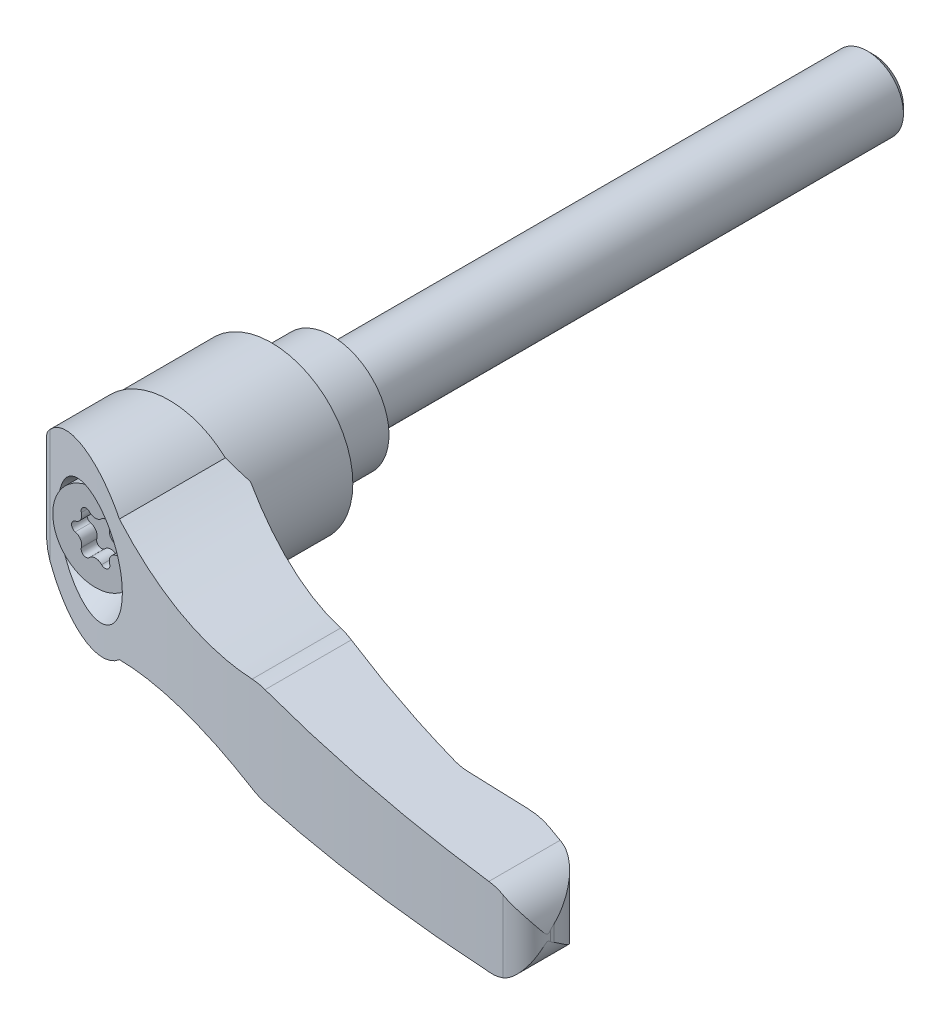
ISO-10303-21;
HEADER;
FILE_DESCRIPTION(('STEP AP214'),'2;1');
FILE_NAME('part.step','',(''),(''),'','','');
FILE_SCHEMA(('AUTOMOTIVE_DESIGN { 1 0 10303 214 1 1 1 1 }'));
ENDSEC;
DATA;
#1=APPLICATION_CONTEXT('core data for automotive mechanical design processes');
#2=APPLICATION_PROTOCOL_DEFINITION('international standard','automotive_design',2000,#1);
#3=PRODUCT_CONTEXT('',#1,'mechanical');
#4=PRODUCT('Part','Part','',(#3));
#5=PRODUCT_RELATED_PRODUCT_CATEGORY('part','',(#4));
#6=PRODUCT_DEFINITION_FORMATION('','',#4);
#7=PRODUCT_DEFINITION_CONTEXT('part definition',#1,'design');
#8=PRODUCT_DEFINITION('design','',#6,#7);
#9=PRODUCT_DEFINITION_SHAPE('','',#8);
#10=(LENGTH_UNIT() NAMED_UNIT(*) SI_UNIT(.MILLI.,.METRE.));
#11=(NAMED_UNIT(*) PLANE_ANGLE_UNIT() SI_UNIT($,.RADIAN.));
#12=(NAMED_UNIT(*) SI_UNIT($,.STERADIAN.) SOLID_ANGLE_UNIT());
#13=UNCERTAINTY_MEASURE_WITH_UNIT(LENGTH_MEASURE(1.E-05),#10,'distance_accuracy_value','');
#14=(GEOMETRIC_REPRESENTATION_CONTEXT(3) GLOBAL_UNCERTAINTY_ASSIGNED_CONTEXT((#13)) GLOBAL_UNIT_ASSIGNED_CONTEXT((#10,
#11,#12)) REPRESENTATION_CONTEXT('',''));
#15=CARTESIAN_POINT('',(0.,0.,0.));
#16=DIRECTION('',(0.,0.,1.));
#17=DIRECTION('',(1.,0.,0.));
#18=AXIS2_PLACEMENT_3D('',#15,#16,#17);
#19=CARTESIAN_POINT('',(-13.5,-14.75,27.));
#20=DIRECTION('',(0.,0.,1.));
#21=DIRECTION('',(0.,-1.,0.));
#22=AXIS2_PLACEMENT_3D('',#19,#20,#21);
#23=PLANE('',#22);
#24=CARTESIAN_POINT('',(29.1599999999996,64.9100000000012,27.));
#25=DIRECTION('',(0.,0.,1.));
#26=DIRECTION('',(0.,-1.,0.));
#27=AXIS2_PLACEMENT_3D('',#24,#25,#26);
#28=CIRCLE('',#27,58.2800000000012);
#29=CARTESIAN_POINT('',(13.5,8.77335599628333,27.));
#30=VERTEX_POINT('',#29);
#31=CARTESIAN_POINT('',(9.33365402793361,10.106036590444,27.));
#32=VERTEX_POINT('',#31);
#33=EDGE_CURVE('E716',#30,#32,#28,.F.);
#34=ORIENTED_EDGE('',*,*,#33,.F.);
#35=DIRECTION('',(0.,1.,0.));
#36=VECTOR('',#35,1.);
#37=CARTESIAN_POINT('',(13.5,-14.75,27.));
#38=LINE('',#37,#36);
#39=CARTESIAN_POINT('',(13.5,0.,27.));
#40=VERTEX_POINT('',#39);
#41=EDGE_CURVE('E750',#40,#30,#38,.T.);
#42=ORIENTED_EDGE('',*,*,#41,.F.);
#43=CARTESIAN_POINT('',(0.,0.,27.));
#44=DIRECTION('',(0.,0.,1.));
#45=DIRECTION('',(0.,-1.,0.));
#46=AXIS2_PLACEMENT_3D('',#43,#44,#45);
#47=CIRCLE('',#46,13.5);
#48=CARTESIAN_POINT('',(-13.5,0.,27.));
#49=VERTEX_POINT('',#48);
#50=EDGE_CURVE('E719',#40,#49,#47,.T.);
#51=ORIENTED_EDGE('',*,*,#50,.T.);
#52=DIRECTION('',(0.,1.,0.));
#53=VECTOR('',#52,1.);
#54=CARTESIAN_POINT('',(-13.5,-14.75,27.));
#55=LINE('',#54,#53);
#56=CARTESIAN_POINT('',(-13.5,2.55781156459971,27.));
#57=VERTEX_POINT('',#56);
#58=EDGE_CURVE('E752',#49,#57,#55,.T.);
#59=ORIENTED_EDGE('',*,*,#58,.T.);
#60=CARTESIAN_POINT('',(0.00999999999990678,0.,27.));
#61=DIRECTION('',(0.,0.,1.));
#62=DIRECTION('',(0.,-1.,0.));
#63=AXIS2_PLACEMENT_3D('',#60,#61,#62);
#64=CIRCLE('',#63,13.75);
#65=EDGE_CURVE('E764',#32,#57,#64,.T.);
#66=ORIENTED_EDGE('',*,*,#65,.F.);
#67=EDGE_LOOP('',(#34,#42,#51,#59,#66));
#68=FACE_BOUND('',#67,.T.);
#69=ADVANCED_FACE('F14',(#68),#23,.F.);
#70=CARTESIAN_POINT('',(-13.5,-14.75,31.41356721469));
#71=DIRECTION('',(1.,0.,0.));
#72=DIRECTION('',(0.,1.,0.));
#73=AXIS2_PLACEMENT_3D('',#70,#71,#72);
#74=PLANE('',#73);
#75=DIRECTION('',(0.,0.,1.));
#76=VECTOR('',#75,1.);
#77=CARTESIAN_POINT('',(-13.5,2.55781156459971,0.));
#78=LINE('',#77,#76);
#79=CARTESIAN_POINT('',(-13.5,2.55781156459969,31.41356721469));
#80=VERTEX_POINT('',#79);
#81=EDGE_CURVE('E328',#57,#80,#78,.T.);
#82=ORIENTED_EDGE('',*,*,#81,.F.);
#83=ORIENTED_EDGE('',*,*,#58,.F.);
#84=CARTESIAN_POINT('',(-13.5,-2.55781156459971,27.));
#85=VERTEX_POINT('',#84);
#86=EDGE_CURVE('E753',#85,#49,#55,.T.);
#87=ORIENTED_EDGE('',*,*,#86,.F.);
#88=DIRECTION('',(0.,0.,1.));
#89=VECTOR('',#88,1.);
#90=CARTESIAN_POINT('',(-13.5,-2.55781156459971,0.));
#91=LINE('',#90,#89);
#92=CARTESIAN_POINT('',(-13.5,-2.55781156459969,31.41356721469));
#93=VERTEX_POINT('',#92);
#94=EDGE_CURVE('E771',#93,#85,#91,.F.);
#95=ORIENTED_EDGE('',*,*,#94,.F.);
#96=DIRECTION('',(0.,1.,0.));
#97=VECTOR('',#96,1.);
#98=CARTESIAN_POINT('',(-13.5,-14.75,31.41356721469));
#99=LINE('',#98,#97);
#100=EDGE_CURVE('E174',#93,#80,#99,.T.);
#101=ORIENTED_EDGE('',*,*,#100,.T.);
#102=EDGE_LOOP('',(#82,#83,#87,#95,#101));
#103=FACE_BOUND('',#102,.T.);
#104=ADVANCED_FACE('F16',(#103),#74,.F.);
#105=CARTESIAN_POINT('',(29.1599999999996,-64.9100000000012,27.));
#106=DIRECTION('',(0.,0.,1.));
#107=DIRECTION('',(0.,-1.,0.));
#108=AXIS2_PLACEMENT_3D('',#105,#106,#107);
#109=CIRCLE('',#108,58.2800000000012);
#110=CARTESIAN_POINT('',(9.33365402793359,-10.106036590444,27.));
#111=VERTEX_POINT('',#110);
#112=CARTESIAN_POINT('',(13.5,-8.77335599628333,27.));
#113=VERTEX_POINT('',#112);
#114=EDGE_CURVE('E444',#111,#113,#109,.F.);
#115=ORIENTED_EDGE('',*,*,#114,.F.);
#116=CARTESIAN_POINT('',(0.00999999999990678,0.,27.));
#117=DIRECTION('',(0.,0.,1.));
#118=DIRECTION('',(0.,-1.,0.));
#119=AXIS2_PLACEMENT_3D('',#116,#117,#118);
#120=CIRCLE('',#119,13.75);
#121=EDGE_CURVE('E777',#85,#111,#120,.T.);
#122=ORIENTED_EDGE('',*,*,#121,.F.);
#123=ORIENTED_EDGE('',*,*,#86,.T.);
#124=EDGE_CURVE('E715',#49,#40,#47,.T.);
#125=ORIENTED_EDGE('',*,*,#124,.T.);
#126=EDGE_CURVE('E751',#113,#40,#38,.T.);
#127=ORIENTED_EDGE('',*,*,#126,.F.);
#128=EDGE_LOOP('',(#115,#122,#123,#125,#127));
#129=FACE_BOUND('',#128,.T.);
#130=ADVANCED_FACE('F422',(#129),#23,.F.);
#131=CARTESIAN_POINT('',(132.172219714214,-14.75,-195.670803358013));
#132=DIRECTION('',(0.,1.,0.));
#133=DIRECTION('',(-1.,0.,0.));
#134=AXIS2_PLACEMENT_3D('',#131,#132,#133);
#135=CYLINDRICAL_SURFACE('',#134,252.32);
#136=CARTESIAN_POINT('',(41.140092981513,-7.8746094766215,39.6556386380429));
#137=CARTESIAN_POINT('',(41.3731798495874,-7.92357282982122,39.745806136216));
#138=CARTESIAN_POINT('',(41.6077017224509,-7.96541673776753,39.836127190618));
#139=CARTESIAN_POINT('',(42.078096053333,-8.03464826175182,40.0164774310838));
#140=CARTESIAN_POINT('',(42.3139617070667,-8.06208211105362,40.106506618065));
#141=CARTESIAN_POINT('',(42.7870394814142,-8.10259351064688,40.2862604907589));
#142=CARTESIAN_POINT('',(43.0242516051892,-8.11567102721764,40.3759851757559));
#143=CARTESIAN_POINT('',(43.5000263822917,-8.12742192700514,40.5551257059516));
#144=CARTESIAN_POINT('',(43.7385909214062,-8.12604852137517,40.6445396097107));
#145=CARTESIAN_POINT('',(43.977061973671,-8.1173830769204,40.7335040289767));
#146=B_SPLINE_CURVE_WITH_KNOTS('',3,(#136,#137,#138,#139,#140,#141,#142,#143,#144,#145),
.UNSPECIFIED.,.F.,.F.,(4,2,2,2,4),(0.,0.76390675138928,1.52534737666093,2.28678979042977,
3.05069834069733),.UNSPECIFIED.);
#147=CARTESIAN_POINT('',(41.140092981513,-7.8746094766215,39.6556386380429));
#148=VERTEX_POINT('',#147);
#149=CARTESIAN_POINT('',(43.977061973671,-8.1173830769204,40.7335040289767));
#150=VERTEX_POINT('',#149);
#151=EDGE_CURVE('E437',#148,#150,#146,.T.);
#152=ORIENTED_EDGE('',*,*,#151,.F.);
#153=CARTESIAN_POINT('',(13.5,-8.77335599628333,27.));
#154=CARTESIAN_POINT('',(14.3266465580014,-8.54275177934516,27.4405727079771));
#155=CARTESIAN_POINT('',(15.1596632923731,-8.33005321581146,27.8786057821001));
#156=CARTESIAN_POINT('',(16.8373061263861,-7.9411393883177,28.7487404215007));
#157=CARTESIAN_POINT('',(17.6819330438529,-7.7649267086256,29.1808415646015));
#158=CARTESIAN_POINT('',(19.3824293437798,-7.44952599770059,30.0386421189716));
#159=CARTESIAN_POINT('',(20.2383094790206,-7.31037656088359,30.4643344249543));
#160=CARTESIAN_POINT('',(21.9591324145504,-7.070043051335,31.307997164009));
#161=CARTESIAN_POINT('',(22.8240749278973,-6.9688577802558,31.7259678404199));
#162=CARTESIAN_POINT('',(24.5450860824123,-6.80669813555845,32.5454833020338));
#163=CARTESIAN_POINT('',(25.4010090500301,-6.74499321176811,32.9471893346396));
#164=CARTESIAN_POINT('',(27.1188771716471,-6.65940525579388,33.7416486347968));
#165=CARTESIAN_POINT('',(27.9808222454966,-6.63552172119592,34.1344020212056));
#166=CARTESIAN_POINT('',(29.7086634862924,-6.62618362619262,34.9099811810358));
#167=CARTESIAN_POINT('',(30.5745565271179,-6.64070263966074,35.2928135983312));
#168=CARTESIAN_POINT('',(32.3092228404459,-6.70867652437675,36.0481188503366));
#169=CARTESIAN_POINT('',(33.1779957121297,-6.76212618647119,36.4205930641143));
#170=CARTESIAN_POINT('',(34.6368488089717,-6.88489763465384,37.0364018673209));
#171=CARTESIAN_POINT('',(35.2265958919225,-6.94356773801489,37.2827020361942));
#172=CARTESIAN_POINT('',(36.406063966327,-7.07916680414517,37.7700518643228));
#173=CARTESIAN_POINT('',(36.9957849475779,-7.15609292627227,38.0111023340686));
#174=CARTESIAN_POINT('',(38.1785844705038,-7.32890004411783,38.4893735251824));
#175=CARTESIAN_POINT('',(38.7716596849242,-7.42490197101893,38.7265587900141));
#176=CARTESIAN_POINT('',(39.9568048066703,-7.63566191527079,39.1953419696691));
#177=CARTESIAN_POINT('',(40.5488745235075,-7.75042315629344,39.4269389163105));
#178=CARTESIAN_POINT('',(41.140092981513,-7.8746094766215,39.6556386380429));
#179=B_SPLINE_CURVE_WITH_KNOTS('',3,(#153,#154,#155,#156,#157,#158,#159,#160,#161,#162,#163,
#164,#165,#166,#167,#168,#169,#170,#171,#172,#173,#174,#175,#176,#177,#178),.UNSPECIFIED.,.F.,
.F.,(4,2,2,2,2,2,2,2,2,2,2,2,4),(0.,2.89390785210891,5.78802060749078,8.68513535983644,
11.5821586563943,14.4238938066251,17.2655912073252,20.1053336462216,22.9446961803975,
24.8698413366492,26.7946871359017,28.7321489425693,30.6699440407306),.UNSPECIFIED.);
#180=EDGE_CURVE('E428',#113,#148,#179,.T.);
#181=ORIENTED_EDGE('',*,*,#180,.F.);
#182=ORIENTED_EDGE('',*,*,#126,.T.);
#183=ORIENTED_EDGE('',*,*,#41,.T.);
#184=CARTESIAN_POINT('',(41.140092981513,7.8746094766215,39.6556386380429));
#185=CARTESIAN_POINT('',(40.2568666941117,7.6890779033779,39.3139933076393));
#186=CARTESIAN_POINT('',(39.3717638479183,7.52459842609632,38.9658739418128));
#187=CARTESIAN_POINT('',(37.5997998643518,7.23736069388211,38.2572801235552));
#188=CARTESIAN_POINT('',(36.7129388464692,7.11459969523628,37.8968064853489));
#189=CARTESIAN_POINT('',(34.9394341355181,6.9104028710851,37.1640922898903));
#190=CARTESIAN_POINT('',(34.0527904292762,6.82896250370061,36.7918530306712));
#191=CARTESIAN_POINT('',(32.2815033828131,6.70688253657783,36.0362417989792));
#192=CARTESIAN_POINT('',(31.3968600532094,6.66624315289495,35.6528697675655));
#193=CARTESIAN_POINT('',(28.7804435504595,6.60545291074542,34.5011035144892));
#194=CARTESIAN_POINT('',(27.0536661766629,6.64276527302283,33.7176215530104));
#195=CARTESIAN_POINT('',(23.6270342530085,6.86784257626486,32.1161606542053));
#196=CARTESIAN_POINT('',(21.9271693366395,7.05554807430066,31.2981954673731));
#197=CARTESIAN_POINT('',(19.6761800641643,7.40392758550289,30.1840812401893));
#198=CARTESIAN_POINT('',(19.1083988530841,7.50046620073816,29.9003744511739));
#199=CARTESIAN_POINT('',(17.9775115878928,7.7099921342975,29.3299782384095));
#200=CARTESIAN_POINT('',(17.4144045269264,7.82297580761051,29.0432894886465));
#201=CARTESIAN_POINT('',(16.2896310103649,8.06595772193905,28.4653390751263));
#202=CARTESIAN_POINT('',(15.7279955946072,8.19605796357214,28.1740600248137));
#203=CARTESIAN_POINT('',(14.6099573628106,8.47254503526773,27.588900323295));
#204=CARTESIAN_POINT('',(14.0535556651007,8.61893526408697,27.2950191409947));
#205=CARTESIAN_POINT('',(13.5,8.77335599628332,27.));
#206=B_SPLINE_CURVE_WITH_KNOTS('',3,(#184,#185,#186,#187,#188,#189,#190,#191,#192,#193,#194,
#195,#196,#197,#198,#199,#200,#201,#202,#203,#204,#205),.UNSPECIFIED.,.F.,.F.,(4,2,2,2,2,2,2,2,
2,2,4),(0.,2.89469970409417,5.78920899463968,8.68340005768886,11.577606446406,17.2602540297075,
22.9406566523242,24.866551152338,26.7920194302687,28.7295308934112,30.6674473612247),.UNSPECIFIED.);
#207=CARTESIAN_POINT('',(41.140092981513,7.8746094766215,39.6556386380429));
#208=VERTEX_POINT('',#207);
#209=EDGE_CURVE('E409',#208,#30,#206,.T.);
#210=ORIENTED_EDGE('',*,*,#209,.F.);
#211=CARTESIAN_POINT('',(43.977061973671,8.1173830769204,40.7335040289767));
#212=CARTESIAN_POINT('',(43.7385909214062,8.12604852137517,40.6445396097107));
#213=CARTESIAN_POINT('',(43.5000263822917,8.12742192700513,40.5551257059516));
#214=CARTESIAN_POINT('',(43.0242516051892,8.11567102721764,40.3759851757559));
#215=CARTESIAN_POINT('',(42.7870394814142,8.10259351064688,40.2862604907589));
#216=CARTESIAN_POINT('',(42.3139617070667,8.06208211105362,40.106506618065));
#217=CARTESIAN_POINT('',(42.078096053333,8.03464826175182,40.0164774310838));
#218=CARTESIAN_POINT('',(41.6077017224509,7.96541673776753,39.836127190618));
#219=CARTESIAN_POINT('',(41.3731798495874,7.92357282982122,39.745806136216));
#220=CARTESIAN_POINT('',(41.140092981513,7.8746094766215,39.6556386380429));
#221=B_SPLINE_CURVE_WITH_KNOTS('',3,(#211,#212,#213,#214,#215,#216,#217,#218,#219,#220),
.UNSPECIFIED.,.F.,.F.,(4,2,2,2,4),(0.,0.763908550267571,1.5253509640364,2.28679158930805,
3.05069834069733),.UNSPECIFIED.);
#222=CARTESIAN_POINT('',(43.977061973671,8.1173830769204,40.7335040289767));
#223=VERTEX_POINT('',#222);
#224=EDGE_CURVE('E401',#223,#208,#221,.T.);
#225=ORIENTED_EDGE('',*,*,#224,.F.);
#226=CARTESIAN_POINT('',(132.172219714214,4.9142403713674,-195.670803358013));
#227=DIRECTION('',(0.0362948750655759,0.999341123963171,0.));
#228=DIRECTION('',(-0.999341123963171,0.0362948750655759,0.));
#229=AXIS2_PLACEMENT_3D('',#226,#227,#228);
#230=ELLIPSE('',#229,252.486357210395,252.32);
#231=CARTESIAN_POINT('',(69.144411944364,7.20333500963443,48.6504561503));
#232=VERTEX_POINT('',#231);
#233=EDGE_CURVE('E410',#232,#223,#230,.F.);
#234=ORIENTED_EDGE('',*,*,#233,.F.);
#235=DIRECTION('',(0.,1.,0.));
#236=VECTOR('',#235,1.);
#237=CARTESIAN_POINT('',(69.144411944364,-14.75,48.6504561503));
#238=LINE('',#237,#236);
#239=CARTESIAN_POINT('',(69.144411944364,-7.20333500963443,48.6504561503));
#240=VERTEX_POINT('',#239);
#241=EDGE_CURVE('E747',#240,#232,#238,.T.);
#242=ORIENTED_EDGE('',*,*,#241,.F.);
#243=CARTESIAN_POINT('',(132.172219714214,-4.9142403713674,-195.670803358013));
#244=DIRECTION('',(0.0362948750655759,-0.999341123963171,0.));
#245=DIRECTION('',(0.999341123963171,0.0362948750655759,0.));
#246=AXIS2_PLACEMENT_3D('',#243,#244,#245);
#247=ELLIPSE('',#246,252.486357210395,252.32);
#248=EDGE_CURVE('E1500',#150,#240,#247,.F.);
#249=ORIENTED_EDGE('',*,*,#248,.F.);
#250=EDGE_LOOP('',(#152,#181,#182,#183,#210,#225,#234,#242,#249));
#251=FACE_BOUND('',#250,.T.);
#252=ADVANCED_FACE('F417',(#251),#135,.F.);
#253=CARTESIAN_POINT('',(71.6623269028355,-14.75,38.8899999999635));
#254=DIRECTION('',(0.,1.,0.));
#255=DIRECTION('',(-1.,0.,0.));
#256=AXIS2_PLACEMENT_3D('',#253,#254,#255);
#257=CYLINDRICAL_SURFACE('',#256,10.0800000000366);
#258=CARTESIAN_POINT('',(71.6623269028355,7.11188734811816,38.8899999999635));
#259=DIRECTION('',(0.0362948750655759,0.999341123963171,0.));
#260=DIRECTION('',(-0.999341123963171,0.0362948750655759,0.));
#261=AXIS2_PLACEMENT_3D('',#258,#259,#260);
#262=ELLIPSE('',#261,10.0866458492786,10.0800000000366);
#263=CARTESIAN_POINT('',(71.66232690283,7.11188734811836,48.97));
#264=VERTEX_POINT('',#263);
#265=EDGE_CURVE('E1493',#264,#232,#262,.F.);
#266=ORIENTED_EDGE('',*,*,#265,.F.);
#267=DIRECTION('',(0.,1.,0.));
#268=VECTOR('',#267,1.);
#269=CARTESIAN_POINT('',(71.66232690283,-14.75,48.97));
#270=LINE('',#269,#268);
#271=CARTESIAN_POINT('',(71.66232690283,-7.11188734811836,48.97));
#272=VERTEX_POINT('',#271);
#273=EDGE_CURVE('E744',#272,#264,#270,.T.);
#274=ORIENTED_EDGE('',*,*,#273,.F.);
#275=CARTESIAN_POINT('',(71.6623269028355,-7.11188734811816,38.8899999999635));
#276=DIRECTION('',(0.0362948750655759,-0.999341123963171,0.));
#277=DIRECTION('',(0.999341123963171,0.0362948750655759,0.));
#278=AXIS2_PLACEMENT_3D('',#275,#276,#277);
#279=ELLIPSE('',#278,10.0866458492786,10.0800000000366);
#280=EDGE_CURVE('E1498',#240,#272,#279,.F.);
#281=ORIENTED_EDGE('',*,*,#280,.F.);
#282=ORIENTED_EDGE('',*,*,#241,.T.);
#283=EDGE_LOOP('',(#266,#274,#281,#282));
#284=FACE_BOUND('',#283,.T.);
#285=ADVANCED_FACE('F421',(#284),#257,.F.);
#286=CARTESIAN_POINT('',(71.66232690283,-14.75,48.97));
#287=DIRECTION('',(0.,0.,1.));
#288=DIRECTION('',(0.,-1.,0.));
#289=AXIS2_PLACEMENT_3D('',#286,#287,#288);
#290=PLANE('',#289);
#291=DIRECTION('',(-0.999341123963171,0.0362948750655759,0.));
#292=VECTOR('',#291,1.);
#293=CARTESIAN_POINT('',(72.4552785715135,7.08308829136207,48.97));
#294=LINE('',#293,#292);
#295=CARTESIAN_POINT('',(81.477303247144,6.7554191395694,48.97));
#296=VERTEX_POINT('',#295);
#297=EDGE_CURVE('E1490',#296,#264,#294,.T.);
#298=ORIENTED_EDGE('',*,*,#297,.F.);
#299=DIRECTION('',(0.,1.,0.));
#300=VECTOR('',#299,1.);
#301=CARTESIAN_POINT('',(81.477303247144,-14.75,48.97));
#302=LINE('',#301,#300);
#303=CARTESIAN_POINT('',(81.477303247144,-6.7554191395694,48.97));
#304=VERTEX_POINT('',#303);
#305=EDGE_CURVE('E741',#304,#296,#302,.T.);
#306=ORIENTED_EDGE('',*,*,#305,.F.);
#307=DIRECTION('',(0.999341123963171,0.0362948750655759,0.));
#308=VECTOR('',#307,1.);
#309=CARTESIAN_POINT('',(71.3852852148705,-7.12194917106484,48.97));
#310=LINE('',#309,#308);
#311=EDGE_CURVE('E1501',#272,#304,#310,.T.);
#312=ORIENTED_EDGE('',*,*,#311,.F.);
#313=ORIENTED_EDGE('',*,*,#273,.T.);
#314=EDGE_LOOP('',(#298,#306,#312,#313));
#315=FACE_BOUND('',#314,.T.);
#316=ADVANCED_FACE('F539',(#315),#290,.F.);
#317=CARTESIAN_POINT('',(81.4773032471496,-14.75,62.3599999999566));
#318=DIRECTION('',(0.,1.,0.));
#319=DIRECTION('',(-1.,0.,0.));
#320=AXIS2_PLACEMENT_3D('',#317,#318,#319);
#321=CYLINDRICAL_SURFACE('',#320,13.3899999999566);
#322=CARTESIAN_POINT('',(81.4773032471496,6.7554191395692,62.3599999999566));
#323=DIRECTION('',(0.0362948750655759,0.999341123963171,0.));
#324=DIRECTION('',(-0.999341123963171,0.0362948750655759,0.));
#325=AXIS2_PLACEMENT_3D('',#322,#323,#324);
#326=ELLIPSE('',#325,13.3988281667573,13.3899999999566);
#327=CARTESIAN_POINT('',(85.728228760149,6.60103060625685,49.662687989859));
#328=VERTEX_POINT('',#327);
#329=EDGE_CURVE('E1489',#328,#296,#326,.T.);
#330=ORIENTED_EDGE('',*,*,#329,.F.);
#331=DIRECTION('',(0.,1.,0.));
#332=VECTOR('',#331,1.);
#333=CARTESIAN_POINT('',(85.728228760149,-14.75,49.662687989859));
#334=LINE('',#333,#332);
#335=CARTESIAN_POINT('',(85.728228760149,-6.60103060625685,49.662687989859));
#336=VERTEX_POINT('',#335);
#337=EDGE_CURVE('E738',#336,#328,#334,.T.);
#338=ORIENTED_EDGE('',*,*,#337,.F.);
#339=CARTESIAN_POINT('',(81.4773032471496,-6.75541913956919,62.3599999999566));
#340=DIRECTION('',(0.0362948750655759,-0.999341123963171,0.));
#341=DIRECTION('',(0.999341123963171,0.0362948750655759,0.));
#342=AXIS2_PLACEMENT_3D('',#339,#340,#341);
#343=ELLIPSE('',#342,13.3988281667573,13.3899999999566);
#344=EDGE_CURVE('E1503',#304,#336,#343,.T.);
#345=ORIENTED_EDGE('',*,*,#344,.F.);
#346=ORIENTED_EDGE('',*,*,#305,.T.);
#347=EDGE_LOOP('',(#330,#338,#345,#346));
#348=FACE_BOUND('',#347,.T.);
#349=ADVANCED_FACE('F536',(#348),#321,.T.);
#350=CARTESIAN_POINT('',(85.728228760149,-14.75,49.662687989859));
#351=DIRECTION('',(-0.317470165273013,0.,0.948268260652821));
#352=DIRECTION('',(-0.948268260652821,0.,-0.317470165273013));
#353=AXIS2_PLACEMENT_3D('',#350,#351,#352);
#354=PLANE('',#353);
#355=DIRECTION('',(-0.947706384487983,0.0344195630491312,-0.317282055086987));
#356=VECTOR('',#355,1.);
#357=CARTESIAN_POINT('',(86.4246916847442,6.57573590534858,49.8958563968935));
#358=LINE('',#357,#356);
#359=CARTESIAN_POINT('',(88.51,6.5,50.59399552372));
#360=VERTEX_POINT('',#359);
#361=EDGE_CURVE('E1485',#360,#328,#358,.T.);
#362=ORIENTED_EDGE('',*,*,#361,.F.);
#363=CARTESIAN_POINT('',(88.51,0.,50.59399552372));
#364=DIRECTION('',(-0.317470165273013,0.,0.948268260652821));
#365=DIRECTION('',(0.948268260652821,0.,0.317470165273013));
#366=AXIS2_PLACEMENT_3D('',#363,#364,#365);
#367=ELLIPSE('',#366,6.85460040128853,6.5);
#368=CARTESIAN_POINT('',(88.919807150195,6.4870685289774,50.731194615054));
#369=VERTEX_POINT('',#368);
#370=EDGE_CURVE('E511',#369,#360,#367,.T.);
#371=ORIENTED_EDGE('',*,*,#370,.F.);
#372=DIRECTION('',(0.,1.,0.));
#373=VECTOR('',#372,1.);
#374=CARTESIAN_POINT('',(88.919807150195,-14.75,50.731194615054));
#375=LINE('',#374,#373);
#376=CARTESIAN_POINT('',(88.919807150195,-6.4870685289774,50.731194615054));
#377=VERTEX_POINT('',#376);
#378=EDGE_CURVE('E735',#377,#369,#375,.T.);
#379=ORIENTED_EDGE('',*,*,#378,.F.);
#380=CARTESIAN_POINT('',(88.51,-6.5,50.59399552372));
#381=VERTEX_POINT('',#380);
#382=EDGE_CURVE('E1484',#381,#377,#367,.T.);
#383=ORIENTED_EDGE('',*,*,#382,.F.);
#384=DIRECTION('',(0.947706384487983,0.0344195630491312,0.317282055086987));
#385=VECTOR('',#384,1.);
#386=CARTESIAN_POINT('',(85.4624123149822,-6.61068474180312,49.5736954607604));
#387=LINE('',#386,#385);
#388=EDGE_CURVE('E443',#336,#381,#387,.T.);
#389=ORIENTED_EDGE('',*,*,#388,.F.);
#390=ORIENTED_EDGE('',*,*,#337,.T.);
#391=EDGE_LOOP('',(#362,#371,#379,#383,#389,#390));
#392=FACE_BOUND('',#391,.T.);
#393=ADVANCED_FACE('F531',(#392),#354,.F.);
#394=CARTESIAN_POINT('',(86.1165455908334,-14.75,59.104403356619));
#395=DIRECTION('',(0.,1.,0.));
#396=DIRECTION('',(-1.,0.,0.));
#397=AXIS2_PLACEMENT_3D('',#394,#395,#396);
#398=CYLINDRICAL_SURFACE('',#397,8.83000000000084);
#399=CARTESIAN_POINT('',(88.919807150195,-6.4870685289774,50.731194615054));
#400=CARTESIAN_POINT('',(89.0997697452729,-6.47572771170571,50.79139886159));
#401=CARTESIAN_POINT('',(89.277235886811,-6.45697335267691,50.8573067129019));
#402=CARTESIAN_POINT('',(89.6256587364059,-6.40594654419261,50.9994566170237));
#403=CARTESIAN_POINT('',(89.7966254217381,-6.37369580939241,51.0756819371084));
#404=CARTESIAN_POINT('',(90.1293873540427,-6.29733777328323,51.2367553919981));
#405=CARTESIAN_POINT('',(90.2912591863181,-6.25335658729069,51.3215061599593));
#406=CARTESIAN_POINT('',(90.6070344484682,-6.15465850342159,51.4993225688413));
#407=CARTESIAN_POINT('',(90.760933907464,-6.09993631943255,51.5923922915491));
#408=CARTESIAN_POINT('',(91.0945425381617,-5.96735555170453,51.8080731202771));
#409=CARTESIAN_POINT('',(91.2720732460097,-5.88706921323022,51.9325631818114));
#410=CARTESIAN_POINT('',(91.6137719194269,-5.7143040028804,52.1909876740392));
#411=CARTESIAN_POINT('',(91.7779381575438,-5.62182355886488,52.324923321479));
#412=CARTESIAN_POINT('',(92.0935205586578,-5.42614069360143,52.6014136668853));
#413=CARTESIAN_POINT('',(92.2448770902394,-5.32289263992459,52.7440038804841));
#414=CARTESIAN_POINT('',(92.5341674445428,-5.10769832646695,53.0360195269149));
#415=CARTESIAN_POINT('',(92.6721003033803,-4.99575144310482,53.1854454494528));
#416=CARTESIAN_POINT('',(92.9857333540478,-4.71982512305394,53.5491307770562));
#417=CARTESIAN_POINT('',(93.1553696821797,-4.55248618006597,53.7660853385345));
#418=CARTESIAN_POINT('',(93.4703079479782,-4.20713466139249,54.2089998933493));
#419=CARTESIAN_POINT('',(93.6156001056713,-4.02911783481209,54.4349634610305));
#420=CARTESIAN_POINT('',(93.8828003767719,-3.66523875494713,54.894320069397));
#421=CARTESIAN_POINT('',(94.0047026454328,-3.47937455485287,55.127714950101));
#422=CARTESIAN_POINT('',(94.2259458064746,-3.1025219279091,55.6008670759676));
#423=CARTESIAN_POINT('',(94.3252909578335,-2.91153447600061,55.8406231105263));
#424=CARTESIAN_POINT('',(94.4698076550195,-2.59782196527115,56.2375651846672));
#425=CARTESIAN_POINT('',(94.5215034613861,-2.47567903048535,56.3928781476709));
#426=CARTESIAN_POINT('',(94.6162509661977,-2.23176482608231,56.7063336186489));
#427=CARTESIAN_POINT('',(94.6593059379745,-2.10999343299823,56.8644750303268));
#428=CARTESIAN_POINT('',(94.7173954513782,-1.92930841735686,57.1041561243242));
#429=CARTESIAN_POINT('',(94.7356435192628,-1.86953763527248,57.1842829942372));
#430=CARTESIAN_POINT('',(94.770022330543,-1.75098004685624,57.3456972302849));
#431=CARTESIAN_POINT('',(94.7861533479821,-1.69219311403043,57.4269844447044));
#432=CARTESIAN_POINT('',(94.8163065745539,-1.57609424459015,57.5911123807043));
#433=CARTESIAN_POINT('',(94.8303269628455,-1.51878361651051,57.6739543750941));
#434=CARTESIAN_POINT('',(94.8562112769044,-1.40676062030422,57.8417526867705));
#435=CARTESIAN_POINT('',(94.8680742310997,-1.35204943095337,57.9267099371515));
#436=CARTESIAN_POINT('',(94.878836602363,-1.29919988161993,58.013002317));
#437=B_SPLINE_CURVE_WITH_KNOTS('',3,(#399,#400,#401,#402,#403,#404,#405,#406,#407,#408,#409,
#410,#411,#412,#413,#414,#415,#416,#417,#418,#419,#420,#421,#422,#423,#424,#425,#426,#427,#428,
#429,#430,#431,#432,#433,#434,#435,#436),.UNSPECIFIED.,.F.,.F.,(4,2,2,2,2,2,2,2,2,2,2,2,2,2,2,2,
2,2,4),(0.,0.569903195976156,1.1388929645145,1.70199618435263,2.26537722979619,2.95800230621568,
3.65071676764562,4.34649638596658,5.042325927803,6.00766077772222,6.97338251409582,
7.9393452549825,8.90512546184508,9.51766996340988,10.1299819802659,10.4348045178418,
10.7395875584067,11.0446320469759,11.3498135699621),.UNSPECIFIED.);
#438=CARTESIAN_POINT('',(94.878836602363,-1.29919988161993,58.013002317));
#439=VERTEX_POINT('',#438);
#440=EDGE_CURVE('E512',#377,#439,#437,.T.);
#441=ORIENTED_EDGE('',*,*,#440,.F.);
#442=ORIENTED_EDGE('',*,*,#378,.T.);
#443=CARTESIAN_POINT('',(94.878836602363,1.29919988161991,58.013002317));
#444=CARTESIAN_POINT('',(94.8698905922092,1.34309764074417,57.9412335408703));
#445=CARTESIAN_POINT('',(94.8601811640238,1.38833454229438,57.8704151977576));
#446=CARTESIAN_POINT('',(94.8392644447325,1.48075225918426,57.730315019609));
#447=CARTESIAN_POINT('',(94.8280576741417,1.52793239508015,57.6610326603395));
#448=CARTESIAN_POINT('',(94.7922406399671,1.67127035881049,57.454961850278));
#449=CARTESIAN_POINT('',(94.7654216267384,1.76928633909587,57.3198547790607));
#450=CARTESIAN_POINT('',(94.7059351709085,1.96751896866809,57.0525736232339));
#451=CARTESIAN_POINT('',(94.6732668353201,2.06773595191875,56.9203999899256));
#452=CARTESIAN_POINT('',(94.6020450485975,2.26900598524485,56.6582540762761));
#453=CARTESIAN_POINT('',(94.563490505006,2.37005918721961,56.5282822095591));
#454=CARTESIAN_POINT('',(94.4800311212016,2.57311073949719,56.2689600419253));
#455=CARTESIAN_POINT('',(94.43506806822,2.67510870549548,56.1396281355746));
#456=CARTESIAN_POINT('',(94.3389987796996,2.87844084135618,55.882764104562));
#457=CARTESIAN_POINT('',(94.2878928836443,2.97977504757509,55.7552318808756));
#458=CARTESIAN_POINT('',(94.1252135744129,3.28202886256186,55.3753189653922));
#459=CARTESIAN_POINT('',(94.0042476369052,3.48127599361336,55.1255256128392));
#460=CARTESIAN_POINT('',(93.759734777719,3.83777694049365,54.6767706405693));
#461=CARTESIAN_POINT('',(93.640322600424,3.99629089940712,54.4765458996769));
#462=CARTESIAN_POINT('',(93.383135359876,4.30616830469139,54.0823566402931));
#463=CARTESIAN_POINT('',(93.2453595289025,4.45753145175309,53.8883923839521));
#464=CARTESIAN_POINT('',(92.9512287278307,4.75062950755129,53.5085527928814));
#465=CARTESIAN_POINT('',(92.7949276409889,4.89239054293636,53.3226560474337));
#466=CARTESIAN_POINT('',(92.4628785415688,5.16437580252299,52.9600281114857));
#467=CARTESIAN_POINT('',(92.287138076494,5.29460446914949,52.7832934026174));
#468=CARTESIAN_POINT('',(91.9694754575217,5.50519013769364,52.4904514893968));
#469=CARTESIAN_POINT('',(91.8324409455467,5.58908954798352,52.371573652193));
#470=CARTESIAN_POINT('',(91.5483180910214,5.74849152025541,52.1403319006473));
#471=CARTESIAN_POINT('',(91.4012300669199,5.82399434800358,52.027967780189));
#472=CARTESIAN_POINT('',(91.0975573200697,5.9651060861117,51.8110413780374));
#473=CARTESIAN_POINT('',(90.9409998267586,6.03074163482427,51.7064584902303));
#474=CARTESIAN_POINT('',(90.6184885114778,6.15092679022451,51.5058847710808));
#475=CARTESIAN_POINT('',(90.4525377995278,6.2054800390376,51.4098911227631));
#476=CARTESIAN_POINT('',(90.0679091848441,6.31446049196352,51.2041166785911));
#477=CARTESIAN_POINT('',(89.8466451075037,6.36524880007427,51.0971370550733));
#478=CARTESIAN_POINT('',(89.5057087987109,6.42432621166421,50.9497771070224));
#479=CARTESIAN_POINT('',(89.3903026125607,6.4411852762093,50.9027564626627));
#480=CARTESIAN_POINT('',(89.1568962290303,6.46879782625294,50.8133959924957));
#481=CARTESIAN_POINT('',(89.038894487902,6.47954757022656,50.7710590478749));
#482=CARTESIAN_POINT('',(88.919807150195,6.4870685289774,50.731194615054));
#483=B_SPLINE_CURVE_WITH_KNOTS('',3,(#443,#444,#445,#446,#447,#448,#449,#450,#451,#452,#453,
#454,#455,#456,#457,#458,#459,#460,#461,#462,#463,#464,#465,#466,#467,#468,#469,#470,#471,#472,
#473,#474,#475,#476,#477,#478,#479,#480,#481,#482),.UNSPECIFIED.,.F.,.F.,(4,2,2,2,2,2,2,2,2,2,2,
2,2,2,2,2,2,2,2,4),(0.,0.253746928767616,0.507405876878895,1.01438460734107,1.52144080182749,
2.02859121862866,2.54068295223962,3.05274639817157,4.07649386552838,4.92157638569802,
5.76669424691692,6.60941165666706,7.45180301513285,8.05095332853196,8.6500846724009,
9.24756833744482,9.84485532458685,10.5957153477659,10.9727456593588,11.3500066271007),.UNSPECIFIED.);
#484=CARTESIAN_POINT('',(94.878836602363,1.29919988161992,58.013002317));
#485=VERTEX_POINT('',#484);
#486=EDGE_CURVE('E497',#485,#369,#483,.T.);
#487=ORIENTED_EDGE('',*,*,#486,.F.);
#488=DIRECTION('',(0.,1.,0.));
#489=VECTOR('',#488,1.);
#490=CARTESIAN_POINT('',(94.878836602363,-14.75,58.013002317));
#491=LINE('',#490,#489);
#492=EDGE_CURVE('E732',#439,#485,#491,.T.);
#493=ORIENTED_EDGE('',*,*,#492,.F.);
#494=EDGE_LOOP('',(#441,#442,#487,#493));
#495=FACE_BOUND('',#494,.T.);
#496=ADVANCED_FACE('F526',(#495),#398,.T.);
#497=CARTESIAN_POINT('',(94.878836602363,-14.75,58.013002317));
#498=DIRECTION('',(-0.992331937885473,0.,0.123601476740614));
#499=DIRECTION('',(-0.123601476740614,0.,-0.992331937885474));
#500=AXIS2_PLACEMENT_3D('',#497,#498,#499);
#501=PLANE('',#500);
#502=CARTESIAN_POINT('',(88.51,0.,6.88092740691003));
#503=DIRECTION('',(-0.992331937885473,0.,0.123601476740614));
#504=DIRECTION('',(0.123601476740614,0.,0.992331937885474));
#505=AXIS2_PLACEMENT_3D('',#502,#503,#504);
#506=ELLIPSE('',#505,52.588368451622,6.5);
#507=CARTESIAN_POINT('',(94.961162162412,0.795302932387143,58.673951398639));
#508=VERTEX_POINT('',#507);
#509=EDGE_CURVE('E1513',#508,#485,#506,.T.);
#510=ORIENTED_EDGE('',*,*,#509,.F.);
#511=DIRECTION('',(0.,1.,0.));
#512=VECTOR('',#511,1.);
#513=CARTESIAN_POINT('',(94.961162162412,-14.75,58.673951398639));
#514=LINE('',#513,#512);
#515=CARTESIAN_POINT('',(94.961162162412,-0.795302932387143,58.673951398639));
#516=VERTEX_POINT('',#515);
#517=EDGE_CURVE('E729',#516,#508,#514,.T.);
#518=ORIENTED_EDGE('',*,*,#517,.F.);
#519=EDGE_CURVE('E510',#439,#516,#506,.T.);
#520=ORIENTED_EDGE('',*,*,#519,.F.);
#521=ORIENTED_EDGE('',*,*,#492,.T.);
#522=EDGE_LOOP('',(#510,#518,#520,#521));
#523=FACE_BOUND('',#522,.T.);
#524=ADVANCED_FACE('F522',(#523),#501,.F.);
#525=CARTESIAN_POINT('',(91.4284604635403,-14.75,59.1139726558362));
#526=DIRECTION('',(0.,1.,0.));
#527=DIRECTION('',(-1.,0.,0.));
#528=AXIS2_PLACEMENT_3D('',#525,#526,#527);
#529=CYLINDRICAL_SURFACE('',#528,3.55999999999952);
#530=CARTESIAN_POINT('',(94.961162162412,-0.795302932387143,58.673951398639));
#531=CARTESIAN_POINT('',(94.9644919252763,-0.768378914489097,58.7008087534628));
#532=CARTESIAN_POINT('',(94.9675974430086,-0.741714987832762,58.7281213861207));
#533=CARTESIAN_POINT('',(94.9733618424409,-0.689651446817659,58.7851195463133));
#534=CARTESIAN_POINT('',(94.9760088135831,-0.664294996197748,58.8148451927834));
#535=CARTESIAN_POINT('',(94.9801079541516,-0.622917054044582,58.8691487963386));
#536=CARTESIAN_POINT('',(94.9816931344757,-0.606153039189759,58.8931372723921));
#537=CARTESIAN_POINT('',(94.9844438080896,-0.576022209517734,58.9430840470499));
#538=CARTESIAN_POINT('',(94.9856121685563,-0.562632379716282,58.9690273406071));
#539=CARTESIAN_POINT('',(94.9870576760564,-0.545680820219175,59.0126857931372));
#540=CARTESIAN_POINT('',(94.987504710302,-0.540322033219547,59.0296777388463));
#541=CARTESIAN_POINT('',(94.9881559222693,-0.532458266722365,59.0643085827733));
#542=CARTESIAN_POINT('',(94.9883606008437,-0.529947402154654,59.081946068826));
#543=CARTESIAN_POINT('',(94.9885032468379,-0.528201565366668,59.1174894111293));
#544=CARTESIAN_POINT('',(94.988439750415,-0.528984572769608,59.135396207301));
#545=CARTESIAN_POINT('',(94.9880513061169,-0.533719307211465,59.17078705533));
#546=CARTESIAN_POINT('',(94.9877259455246,-0.537676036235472,59.188270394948));
#547=CARTESIAN_POINT('',(94.9866630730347,-0.550353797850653,59.2296785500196));
#548=CARTESIAN_POINT('',(94.9858092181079,-0.56038442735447,59.2531863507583));
#549=CARTESIAN_POINT('',(94.9837472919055,-0.583724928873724,59.2985105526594));
#550=CARTESIAN_POINT('',(94.9825377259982,-0.597048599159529,59.3203193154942));
#551=CARTESIAN_POINT('',(94.9788733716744,-0.635824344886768,59.3775739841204));
#552=CARTESIAN_POINT('',(94.9761446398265,-0.663165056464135,59.411692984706));
#553=CARTESIAN_POINT('',(94.9700018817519,-0.720574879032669,59.4775241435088));
#554=CARTESIAN_POINT('',(94.9665858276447,-0.75065191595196,59.509228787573));
#555=CARTESIAN_POINT('',(94.9553560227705,-0.843350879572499,59.602401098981));
#556=CARTESIAN_POINT('',(94.946586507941,-0.908148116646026,59.6615711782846));
#557=CARTESIAN_POINT('',(94.9267359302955,-1.03918383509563,59.7765438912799));
#558=CARTESIAN_POINT('',(94.9156761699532,-1.1054043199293,59.8323718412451));
#559=CARTESIAN_POINT('',(94.8912112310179,-1.23884622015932,59.942300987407));
#560=CARTESIAN_POINT('',(94.8778060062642,-1.30606765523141,59.9964021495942));
#561=CARTESIAN_POINT('',(94.8340308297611,-1.50854603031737,60.1570659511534));
#562=CARTESIAN_POINT('',(94.8001251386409,-1.64445689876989,60.2618544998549));
#563=CARTESIAN_POINT('',(94.7228862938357,-1.91569830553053,60.4676179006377));
#564=CARTESIAN_POINT('',(94.6795859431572,-2.05102923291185,60.5686046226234));
#565=CARTESIAN_POINT('',(94.5832906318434,-2.32069504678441,60.7670942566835));
#566=CARTESIAN_POINT('',(94.5303005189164,-2.45503039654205,60.8645988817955));
#567=CARTESIAN_POINT('',(94.4141580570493,-2.72254508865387,61.0560805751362));
#568=CARTESIAN_POINT('',(94.3509742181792,-2.85571945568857,61.1500455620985));
#569=CARTESIAN_POINT('',(94.2142397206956,-3.11990060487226,61.3334597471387));
#570=CARTESIAN_POINT('',(94.1406869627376,-3.2509069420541,61.4229080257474));
#571=CARTESIAN_POINT('',(93.9828172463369,-3.5101724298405,61.5964358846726));
#572=CARTESIAN_POINT('',(93.8984928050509,-3.63842959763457,61.6805116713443));
#573=CARTESIAN_POINT('',(93.7188154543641,-3.89131526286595,61.8420641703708));
#574=CARTESIAN_POINT('',(93.6234610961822,-4.01594328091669,61.9195400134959));
#575=CARTESIAN_POINT('',(93.3635347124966,-4.33074067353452,62.1085748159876));
#576=CARTESIAN_POINT('',(93.1905303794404,-4.5176973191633,62.2143328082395));
#577=CARTESIAN_POINT('',(92.9102267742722,-4.78588469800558,62.3526097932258));
#578=CARTESIAN_POINT('',(92.8134920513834,-4.87311342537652,62.3952583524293));
#579=CARTESIAN_POINT('',(92.613135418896,-5.0429651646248,62.4727930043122));
#580=CARTESIAN_POINT('',(92.5095171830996,-5.12559059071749,62.5076831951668));
#581=CARTESIAN_POINT('',(92.3062899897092,-5.27756107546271,62.5655003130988));
#582=CARTESIAN_POINT('',(92.2072990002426,-5.34741120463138,62.5892694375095));
#583=CARTESIAN_POINT('',(92.0044526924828,-5.48211822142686,62.6285852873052));
#584=CARTESIAN_POINT('',(91.9005998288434,-5.54697758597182,62.6441361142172));
#585=CARTESIAN_POINT('',(91.6874320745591,-5.67179943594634,62.6661730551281));
#586=CARTESIAN_POINT('',(91.5780688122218,-5.73169848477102,62.672555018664));
#587=CARTESIAN_POINT('',(91.3558044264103,-5.84526587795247,62.674974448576));
#588=CARTESIAN_POINT('',(91.2428971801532,-5.89892258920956,62.6709929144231));
#589=CARTESIAN_POINT('',(91.128834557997,-5.94909283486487,62.661341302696));
#590=B_SPLINE_CURVE_WITH_KNOTS('',3,(#530,#531,#532,#533,#534,#535,#536,#537,#538,#539,#540,
#541,#542,#543,#544,#545,#546,#547,#548,#549,#550,#551,#552,#553,#554,#555,#556,#557,#558,#559,
#560,#561,#562,#563,#564,#565,#566,#567,#568,#569,#570,#571,#572,#573,#574,#575,#576,#577,#578,
#579,#580,#581,#582,#583,#584,#585,#586,#587,#588,#589),.UNSPECIFIED.,.F.,.F.,(4,2,2,2,2,2,2,2,
2,2,2,2,2,2,2,2,2,2,2,2,2,2,2,2,2,2,2,2,2,4),(0.,0.114713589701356,0.23206464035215,
0.3198551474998,0.407029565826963,0.460306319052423,0.513472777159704,0.566929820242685,
0.620471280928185,0.696746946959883,0.773347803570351,0.904403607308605,1.03585190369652,
1.30012558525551,1.56204347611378,1.82396652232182,2.34844270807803,2.87111625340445,
3.39352902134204,3.91758763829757,4.44175251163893,4.96628351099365,5.49088348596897,
6.31505054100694,6.72586221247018,7.13645636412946,7.50641850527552,7.87619583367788,
8.25014118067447,8.62477260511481),.UNSPECIFIED.);
#591=CARTESIAN_POINT('',(91.128834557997,-5.94909283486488,62.661341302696));
#592=VERTEX_POINT('',#591);
#593=EDGE_CURVE('E505',#516,#592,#590,.T.);
#594=ORIENTED_EDGE('',*,*,#593,.F.);
#595=ORIENTED_EDGE('',*,*,#517,.T.);
#596=CARTESIAN_POINT('',(91.128834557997,5.94909283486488,62.661341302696));
#597=CARTESIAN_POINT('',(91.2343288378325,5.90268414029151,62.6702653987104));
#598=CARTESIAN_POINT('',(91.3388480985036,5.85329558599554,62.6743424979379));
#599=CARTESIAN_POINT('',(91.544934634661,5.74912021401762,62.6735521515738));
#600=CARTESIAN_POINT('',(91.6465062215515,5.69434185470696,62.6686985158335));
#601=CARTESIAN_POINT('',(91.8449979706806,5.58039247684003,62.6509112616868));
#602=CARTESIAN_POINT('',(91.9419552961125,5.52127257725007,62.6380614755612));
#603=CARTESIAN_POINT('',(92.1318149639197,5.39863241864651,62.6051299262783));
#604=CARTESIAN_POINT('',(92.2247153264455,5.33511004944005,62.5850446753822));
#605=CARTESIAN_POINT('',(92.4288313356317,5.18771058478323,62.5325370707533));
#606=CARTESIAN_POINT('',(92.5387807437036,5.10273072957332,62.498282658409));
#607=CARTESIAN_POINT('',(92.7512642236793,4.92754126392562,62.4210233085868));
#608=CARTESIAN_POINT('',(92.8537929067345,4.83732793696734,62.3780120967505));
#609=CARTESIAN_POINT('',(93.0516371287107,4.65209425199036,62.2842935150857));
#610=CARTESIAN_POINT('',(93.1469169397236,4.55705350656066,62.2335513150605));
#611=CARTESIAN_POINT('',(93.3296832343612,4.36330036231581,62.1256517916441));
#612=CARTESIAN_POINT('',(93.4171719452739,4.26458902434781,62.0684963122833));
#613=CARTESIAN_POINT('',(93.6178747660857,4.02405086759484,61.9248070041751));
#614=CARTESIAN_POINT('',(93.7274310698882,3.88073102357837,61.8356481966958));
#615=CARTESIAN_POINT('',(93.932008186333,3.58936484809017,61.6487424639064));
#616=CARTESIAN_POINT('',(94.0270221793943,3.44131633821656,61.5509915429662));
#617=CARTESIAN_POINT('',(94.2029047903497,3.14180885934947,61.3486992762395));
#618=CARTESIAN_POINT('',(94.2837873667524,2.99035342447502,61.2441647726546));
#619=CARTESIAN_POINT('',(94.4319992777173,2.68490646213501,61.029530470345));
#620=CARTESIAN_POINT('',(94.4993341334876,2.53091599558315,60.9194329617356));
#621=CARTESIAN_POINT('',(94.6049300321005,2.2620449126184,60.7240998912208));
#622=CARTESIAN_POINT('',(94.6461790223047,2.14753624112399,60.639946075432));
#623=CARTESIAN_POINT('',(94.7216942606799,1.91817715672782,60.4693009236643));
#624=CARTESIAN_POINT('',(94.7559688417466,1.80332731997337,60.3828125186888));
#625=CARTESIAN_POINT('',(94.8071701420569,1.61300217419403,60.2372142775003));
#626=CARTESIAN_POINT('',(94.8260240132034,1.53747427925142,60.1788409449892));
#627=CARTESIAN_POINT('',(94.8608075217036,1.38679979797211,60.0607507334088));
#628=CARTESIAN_POINT('',(94.8767374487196,1.31165317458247,60.0010339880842));
#629=CARTESIAN_POINT('',(94.9007836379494,1.18760993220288,59.900273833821));
#630=CARTESIAN_POINT('',(94.9097189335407,1.13844317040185,59.8597564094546));
#631=CARTESIAN_POINT('',(94.9262957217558,1.04095316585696,59.777674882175));
#632=CARTESIAN_POINT('',(94.9339401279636,0.992628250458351,59.736113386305));
#633=CARTESIAN_POINT('',(94.9465017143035,0.907143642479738,59.6600063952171));
#634=CARTESIAN_POINT('',(94.951656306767,0.869734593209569,59.6257792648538));
#635=CARTESIAN_POINT('',(94.9611702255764,0.796105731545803,59.5553691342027));
#636=CARTESIAN_POINT('',(94.9655234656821,0.759896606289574,59.5191736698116));
#637=CARTESIAN_POINT('',(94.9733969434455,0.689757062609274,59.4434039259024));
#638=CARTESIAN_POINT('',(94.9769010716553,0.655878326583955,59.4037811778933));
#639=CARTESIAN_POINT('',(94.9827718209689,0.595068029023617,59.3194570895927));
#640=CARTESIAN_POINT('',(94.9851544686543,0.568041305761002,59.2748393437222));
#641=CARTESIAN_POINT('',(94.9872541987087,0.543354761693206,59.2083746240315));
#642=CARTESIAN_POINT('',(94.987707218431,0.537888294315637,59.1896518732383));
#643=CARTESIAN_POINT('',(94.9883129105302,0.530541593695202,59.1515478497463));
#644=CARTESIAN_POINT('',(94.9884667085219,0.528647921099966,59.1321693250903));
#645=CARTESIAN_POINT('',(94.9884538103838,0.528806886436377,59.0933647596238));
#646=CARTESIAN_POINT('',(94.988286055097,0.530872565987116,59.073938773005));
#647=CARTESIAN_POINT('',(94.9876530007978,0.538539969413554,59.0357656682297));
#648=CARTESIAN_POINT('',(94.9871865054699,0.544155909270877,59.0170216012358));
#649=CARTESIAN_POINT('',(94.9857130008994,0.561467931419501,58.9714794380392));
#650=CARTESIAN_POINT('',(94.984552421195,0.574799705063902,58.9453313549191));
#651=CARTESIAN_POINT('',(94.9818112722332,0.604889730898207,58.8950270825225));
#652=CARTESIAN_POINT('',(94.9802280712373,0.621669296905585,58.8708846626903));
#653=CARTESIAN_POINT('',(94.9761191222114,0.663225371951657,58.8161222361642));
#654=CARTESIAN_POINT('',(94.9734562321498,0.688773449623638,58.7861129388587));
#655=CARTESIAN_POINT('',(94.9676507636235,0.741258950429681,58.7285935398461));
#656=CARTESIAN_POINT('',(94.9645203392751,0.768152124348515,58.7010423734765));
#657=CARTESIAN_POINT('',(94.961162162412,0.795302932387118,58.673951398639));
#658=B_SPLINE_CURVE_WITH_KNOTS('',3,(#596,#597,#598,#599,#600,#601,#602,#603,#604,#605,#606,
#607,#608,#609,#610,#611,#612,#613,#614,#615,#616,#617,#618,#619,#620,#621,#622,#623,#624,#625,
#626,#627,#628,#629,#630,#631,#632,#633,#634,#635,#636,#637,#638,#639,#640,#641,#642,#643,#644,
#645,#646,#647,#648,#649,#650,#651,#652,#653,#654,#655,#656,#657),.UNSPECIFIED.,.F.,.F.,(4,2,2,
2,2,2,2,2,2,2,2,2,2,2,2,2,2,2,2,2,2,2,2,2,2,2,2,2,2,2,4),(0.,0.34654757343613,0.692559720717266,
1.03500398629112,1.37761354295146,1.80634568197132,2.23538610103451,2.66641997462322,
3.09733022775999,3.70011452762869,4.30318064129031,4.90564765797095,5.50786864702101,
5.95161256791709,6.39482315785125,6.68667995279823,6.97850781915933,7.17149256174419,
7.3640357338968,7.51691582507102,7.67091301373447,7.827636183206,7.982046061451,
8.04029165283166,8.09831770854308,8.15653522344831,8.21498734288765,8.30261629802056,
8.39080420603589,8.5091721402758,8.62487422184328),.UNSPECIFIED.);
#659=CARTESIAN_POINT('',(91.128834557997,5.94909283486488,62.661341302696));
#660=VERTEX_POINT('',#659);
#661=EDGE_CURVE('E489',#660,#508,#658,.T.);
#662=ORIENTED_EDGE('',*,*,#661,.F.);
#663=DIRECTION('',(0.,1.,0.));
#664=VECTOR('',#663,1.);
#665=CARTESIAN_POINT('',(91.128834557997,-14.75,62.661341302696));
#666=LINE('',#665,#664);
#667=EDGE_CURVE('E726',#592,#660,#666,.T.);
#668=ORIENTED_EDGE('',*,*,#667,.F.);
#669=EDGE_LOOP('',(#594,#595,#662,#668));
#670=FACE_BOUND('',#669,.T.);
#671=ADVANCED_FACE('F518',(#670),#529,.T.);
#672=CARTESIAN_POINT('',(117.702117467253,-14.75,-251.948406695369));
#673=DIRECTION('',(0.,1.,0.));
#674=DIRECTION('',(-1.,0.,0.));
#675=AXIS2_PLACEMENT_3D('',#672,#673,#674);
#676=CYLINDRICAL_SURFACE('',#675,315.729999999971);
#677=CARTESIAN_POINT('',(-4.47834626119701,6.64428642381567,39.1827788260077));
#678=CARTESIAN_POINT('',(-4.295663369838,6.80136797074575,39.2594462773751));
#679=CARTESIAN_POINT('',(-4.1071043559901,6.95047926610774,39.3383772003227));
#680=CARTESIAN_POINT('',(-3.71953094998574,7.232198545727,39.5001484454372));
#681=CARTESIAN_POINT('',(-3.52051358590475,7.36480180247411,39.5829898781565));
#682=CARTESIAN_POINT('',(-3.11317509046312,7.61308968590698,39.7520332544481));
#683=CARTESIAN_POINT('',(-2.90484253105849,7.72875274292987,39.8382393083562));
#684=CARTESIAN_POINT('',(-2.48036511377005,7.94257511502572,40.0133314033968));
#685=CARTESIAN_POINT('',(-2.26421735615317,8.04072785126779,40.1022184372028));
#686=CARTESIAN_POINT('',(-1.80727837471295,8.2265332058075,40.2895153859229));
#687=CARTESIAN_POINT('',(-1.56593025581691,8.31263940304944,40.3881036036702));
#688=CARTESIAN_POINT('',(-1.07724233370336,8.46352104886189,40.5870034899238));
#689=CARTESIAN_POINT('',(-0.829900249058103,8.528288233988,40.6873158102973));
#690=CARTESIAN_POINT('',(-0.330983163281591,8.63615781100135,40.8889072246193));
#691=CARTESIAN_POINT('',(-0.0794090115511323,8.67926449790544,40.9901861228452));
#692=CARTESIAN_POINT('',(0.4263994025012,8.74362111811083,41.1930491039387));
#693=CARTESIAN_POINT('',(0.680633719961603,8.76487059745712,41.2946331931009));
#694=CARTESIAN_POINT('',(1.20180002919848,8.78583494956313,41.5020851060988));
#695=CARTESIAN_POINT('',(1.46878074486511,8.7845199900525,41.6079362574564));
#696=CARTESIAN_POINT('',(2.00186463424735,8.75774588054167,41.8184506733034));
#697=CARTESIAN_POINT('',(2.26796813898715,8.7322972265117,41.9231144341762));
#698=CARTESIAN_POINT('',(2.79765145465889,8.65725582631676,42.1306261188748));
#699=CARTESIAN_POINT('',(3.0612297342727,8.60764927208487,42.2334729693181));
#700=CARTESIAN_POINT('',(3.58362824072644,8.48442284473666,42.436514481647));
#701=CARTESIAN_POINT('',(3.84245043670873,8.41081315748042,42.5367102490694));
#702=CARTESIAN_POINT('',(4.3519579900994,8.24030390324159,42.73319838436));
#703=CARTESIAN_POINT('',(4.60268166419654,8.14354109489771,42.8295099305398));
#704=CARTESIAN_POINT('',(5.09540656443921,7.92692519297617,43.0180848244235));
#705=CARTESIAN_POINT('',(5.33741131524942,7.80708155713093,43.1103498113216));
#706=CARTESIAN_POINT('',(5.81072867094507,7.54482096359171,43.2901648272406));
#707=CARTESIAN_POINT('',(6.04204096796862,7.40240335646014,43.3777147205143));
#708=CARTESIAN_POINT('',(6.49183832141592,7.0957438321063,43.5473876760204));
#709=CARTESIAN_POINT('',(6.71032409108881,6.93150313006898,43.6295110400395));
#710=CARTESIAN_POINT('',(7.12149361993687,6.59114604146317,43.7835737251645));
#711=CARTESIAN_POINT('',(7.31492622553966,6.41607272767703,43.8558194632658));
#712=CARTESIAN_POINT('',(7.68651213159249,6.04820509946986,43.9942208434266));
#713=CARTESIAN_POINT('',(7.86466658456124,5.85541212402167,44.06037694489));
#714=CARTESIAN_POINT('',(8.20387932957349,5.45341943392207,44.1860247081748));
#715=CARTESIAN_POINT('',(8.3649430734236,5.24422498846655,44.2455184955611));
#716=CARTESIAN_POINT('',(8.66833689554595,4.8108676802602,44.3573369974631));
#717=CARTESIAN_POINT('',(8.8106681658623,4.58670577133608,44.4096621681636));
#718=CARTESIAN_POINT('',(9.06583923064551,4.14117186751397,44.5032910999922));
#719=CARTESIAN_POINT('',(9.18004036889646,3.92068634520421,44.5451077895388));
#720=CARTESIAN_POINT('',(9.38970490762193,3.46982010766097,44.6217648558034));
#721=CARTESIAN_POINT('',(9.48516963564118,3.23944009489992,44.6566057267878));
#722=CARTESIAN_POINT('',(9.65634228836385,2.77057124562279,44.7190024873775));
#723=CARTESIAN_POINT('',(9.73205592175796,2.53208477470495,44.7465604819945));
#724=CARTESIAN_POINT('',(9.86294276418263,2.04880734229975,44.7941587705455));
#725=CARTESIAN_POINT('',(9.91811674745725,1.80401661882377,44.8141993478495));
#726=CARTESIAN_POINT('',(10.0048081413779,1.32400345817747,44.8456708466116));
#727=CARTESIAN_POINT('',(10.0374808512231,1.08901650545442,44.8575223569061));
#728=CARTESIAN_POINT('',(10.0836634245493,0.616924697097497,44.8742707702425));
#729=CARTESIAN_POINT('',(10.0971740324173,0.379819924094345,44.8791679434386));
#730=CARTESIAN_POINT('',(10.1048959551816,-0.0947066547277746,44.8819671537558));
#731=CARTESIAN_POINT('',(10.099110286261,-0.332128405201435,44.8798702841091));
#732=CARTESIAN_POINT('',(10.0683049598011,-0.805555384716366,44.8687012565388));
#733=CARTESIAN_POINT('',(10.0432853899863,-1.0415606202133,44.8596291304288));
#734=CARTESIAN_POINT('',(9.97506313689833,-1.50498758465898,44.8348744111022));
#735=CARTESIAN_POINT('',(9.93229360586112,-1.73248168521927,44.8193492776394));
#736=CARTESIAN_POINT('',(9.82902960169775,-2.1829457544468,44.781829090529));
#737=CARTESIAN_POINT('',(9.7685291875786,-2.40591417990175,44.7598318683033));
#738=CARTESIAN_POINT('',(9.63038591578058,-2.84569387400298,44.7095430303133));
#739=CARTESIAN_POINT('',(9.55274639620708,-3.06250633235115,44.6812526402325));
#740=CARTESIAN_POINT('',(9.38101905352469,-3.48861238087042,44.6185855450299));
#741=CARTESIAN_POINT('',(9.28693045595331,-3.6979056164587,44.5842085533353));
#742=CARTESIAN_POINT('',(9.08158226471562,-4.11077267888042,44.5090512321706));
#743=CARTESIAN_POINT('',(8.9700832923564,-4.3142111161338,44.4681814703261));
#744=CARTESIAN_POINT('',(8.73195616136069,-4.71073890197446,44.3807226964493));
#745=CARTESIAN_POINT('',(8.60532759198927,-4.90382796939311,44.3341335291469));
#746=CARTESIAN_POINT('',(8.33800842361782,-5.27853069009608,44.2355645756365));
#747=CARTESIAN_POINT('',(8.1973186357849,-5.46014500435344,44.1835851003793));
#748=CARTESIAN_POINT('',(7.90294274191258,-5.81099460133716,44.0745633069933));
#749=CARTESIAN_POINT('',(7.74925204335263,-5.98022546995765,44.0175191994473));
#750=CARTESIAN_POINT('',(7.42264319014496,-6.31297247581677,43.8959817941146));
#751=CARTESIAN_POINT('',(7.24916293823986,-6.47585548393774,43.8312653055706));
#752=CARTESIAN_POINT('',(6.89059218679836,-6.78629897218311,43.6971165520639));
#753=CARTESIAN_POINT('',(6.70549742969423,-6.93385378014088,43.627682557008));
#754=CARTESIAN_POINT('',(6.32516014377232,-7.21288095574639,43.4845764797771));
#755=CARTESIAN_POINT('',(6.12991912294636,-7.34435570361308,43.4109050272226));
#756=CARTESIAN_POINT('',(5.73056867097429,-7.59075058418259,43.2597415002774));
#757=CARTESIAN_POINT('',(5.52645592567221,-7.70566445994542,43.1822479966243));
#758=CARTESIAN_POINT('',(5.09745921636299,-7.92527880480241,43.0188454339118));
#759=CARTESIAN_POINT('',(4.87208237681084,-8.0288529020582,42.9327153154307));
#760=CARTESIAN_POINT('',(4.41443735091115,-8.21635942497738,42.7571998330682));
#761=CARTESIAN_POINT('',(4.18216675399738,-8.30028488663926,42.6678133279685));
#762=CARTESIAN_POINT('',(3.7123663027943,-8.44819027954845,42.4863618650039));
#763=CARTESIAN_POINT('',(3.47483609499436,-8.51216886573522,42.3942967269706));
#764=CARTESIAN_POINT('',(2.99606499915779,-8.62000985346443,42.2080489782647));
#765=CARTESIAN_POINT('',(2.75482393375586,-8.66387129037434,42.1138662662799));
#766=CARTESIAN_POINT('',(2.25523759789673,-8.73346985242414,41.9181057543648));
#767=CARTESIAN_POINT('',(1.99675216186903,-8.75792773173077,41.8164291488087));
#768=CARTESIAN_POINT('',(1.47913755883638,-8.78407399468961,41.612028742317));
#769=CARTESIAN_POINT('',(1.22000859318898,-8.78576877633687,41.5093052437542));
#770=CARTESIAN_POINT('',(0.702606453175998,-8.76647712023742,41.3034047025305));
#771=CARTESIAN_POINT('',(0.444333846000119,-8.7454778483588,41.2002274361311));
#772=CARTESIAN_POINT('',(-0.0694069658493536,-8.68093968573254,40.9942114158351));
#773=CARTESIAN_POINT('',(-0.32487612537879,-8.63740872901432,40.8913725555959));
#774=CARTESIAN_POINT('',(-0.839825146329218,-8.52621354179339,40.6833078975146));
#775=CARTESIAN_POINT('',(-1.0991565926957,-8.45779609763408,40.5781162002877));
#776=CARTESIAN_POINT('',(-1.61114184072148,-8.29749386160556,40.3696656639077));
#777=CARTESIAN_POINT('',(-1.86379810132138,-8.20561784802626,40.2664061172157));
#778=CARTESIAN_POINT('',(-2.3607650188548,-7.99875273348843,40.0625679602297));
#779=CARTESIAN_POINT('',(-2.60507148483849,-7.88375221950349,39.9619907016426));
#780=CARTESIAN_POINT('',(-3.08317163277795,-7.63125068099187,39.7644893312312));
#781=CARTESIAN_POINT('',(-3.31696994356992,-7.49375968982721,39.6675636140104));
#782=CARTESIAN_POINT('',(-3.76825575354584,-7.19947772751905,39.4798692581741));
#783=CARTESIAN_POINT('',(-3.98595554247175,-7.0430620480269,39.3890230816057));
#784=CARTESIAN_POINT('',(-4.4074135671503,-6.7099674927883,39.212626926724));
#785=CARTESIAN_POINT('',(-4.61117791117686,-6.53329758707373,39.1270746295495));
#786=CARTESIAN_POINT('',(-5.00291583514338,-6.16062834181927,38.9621515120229));
#787=CARTESIAN_POINT('',(-5.19089049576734,-5.96463032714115,38.8827802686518));
#788=CARTESIAN_POINT('',(-5.54910234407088,-5.55450395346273,38.7311549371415));
#789=CARTESIAN_POINT('',(-5.71934094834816,-5.34037704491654,38.6589002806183));
#790=CARTESIAN_POINT('',(-6.02899930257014,-4.91093294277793,38.5271860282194));
#791=CARTESIAN_POINT('',(-6.16973858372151,-4.69673239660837,38.467186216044));
#792=CARTESIAN_POINT('',(-6.43267498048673,-4.2553380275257,38.3548944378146));
#793=CARTESIAN_POINT('',(-6.55487445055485,-4.02814585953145,38.3026014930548));
#794=CARTESIAN_POINT('',(-6.77927689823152,-3.56251622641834,38.206431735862));
#795=CARTESIAN_POINT('',(-6.881489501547,-3.32408424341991,38.1625508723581));
#796=CARTESIAN_POINT('',(-7.06471661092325,-2.83777323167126,38.0837983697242));
#797=CARTESIAN_POINT('',(-7.14573286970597,-2.58989498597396,38.0489259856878));
#798=CARTESIAN_POINT('',(-7.27938916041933,-2.10883417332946,37.9913469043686));
#799=CARTESIAN_POINT('',(-7.33389139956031,-1.87626268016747,37.9678428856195));
#800=CARTESIAN_POINT('',(-7.42373849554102,-1.40677550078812,37.9290768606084));
#801=CARTESIAN_POINT('',(-7.4590845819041,-1.16986009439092,37.913814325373));
#802=CARTESIAN_POINT('',(-7.51019282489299,-0.693620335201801,37.8917406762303));
#803=CARTESIAN_POINT('',(-7.52596188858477,-0.454296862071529,37.884926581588));
#804=CARTESIAN_POINT('',(-7.53774814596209,0.0249254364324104,37.879833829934));
#805=CARTESIAN_POINT('',(-7.53376586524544,0.264824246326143,37.881554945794));
#806=CARTESIAN_POINT('',(-7.50684945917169,0.730325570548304,37.8931839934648));
#807=CARTESIAN_POINT('',(-7.48495116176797,0.956000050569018,37.9026444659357));
#808=CARTESIAN_POINT('',(-7.42376311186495,1.40453854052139,37.9290640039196));
#809=CARTESIAN_POINT('',(-7.38447307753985,1.62740250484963,37.9460231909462));
#810=CARTESIAN_POINT('',(-7.2889074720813,2.06880041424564,37.9872401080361));
#811=CARTESIAN_POINT('',(-7.23262932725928,2.28733369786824,38.01149894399));
#812=CARTESIAN_POINT('',(-7.103662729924,2.71858335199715,38.067032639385));
#813=CARTESIAN_POINT('',(-7.03097416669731,2.93129968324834,38.0983075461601));
#814=CARTESIAN_POINT('',(-6.86922610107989,3.35130992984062,38.1678132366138));
#815=CARTESIAN_POINT('',(-6.7800357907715,3.55854422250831,38.2060995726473));
#816=CARTESIAN_POINT('',(-6.58652678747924,3.96449704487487,38.2890424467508));
#817=CARTESIAN_POINT('',(-6.48220758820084,4.16321528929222,38.3336991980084));
#818=CARTESIAN_POINT('',(-6.25944361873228,4.5508856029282,38.4288977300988));
#819=CARTESIAN_POINT('',(-6.1410092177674,4.73984469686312,38.4794351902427));
#820=CARTESIAN_POINT('',(-5.89096663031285,5.10714062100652,38.5859302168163));
#821=CARTESIAN_POINT('',(-5.75936106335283,5.28547955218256,38.6418867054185));
#822=CARTESIAN_POINT('',(-5.4489165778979,5.67467748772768,38.7736098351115));
#823=CARTESIAN_POINT('',(-5.26657599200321,5.88227627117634,38.8507959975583));
#824=CARTESIAN_POINT('',(-4.88478488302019,6.2780872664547,39.0119465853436));
#825=CARTESIAN_POINT('',(-4.68533755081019,6.46630307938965,39.095909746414));
#826=CARTESIAN_POINT('',(-4.47834626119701,6.64428642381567,39.1827788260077));
#827=B_SPLINE_CURVE_WITH_KNOTS('',3,(#677,#678,#679,#680,#681,#682,#683,#684,#685,#686,#687,
#688,#689,#690,#691,#692,#693,#694,#695,#696,#697,#698,#699,#700,#701,#702,#703,#704,#705,#706,
#707,#708,#709,#710,#711,#712,#713,#714,#715,#716,#717,#718,#719,#720,#721,#722,#723,#724,#725,
#726,#727,#728,#729,#730,#731,#732,#733,#734,#735,#736,#737,#738,#739,#740,#741,#742,#743,#744,
#745,#746,#747,#748,#749,#750,#751,#752,#753,#754,#755,#756,#757,#758,#759,#760,#761,#762,#763,
#764,#765,#766,#767,#768,#769,#770,#771,#772,#773,#774,#775,#776,#777,#778,#779,#780,#781,#782,
#783,#784,#785,#786,#787,#788,#789,#790,#791,#792,#793,#794,#795,#796,#797,#798,#799,#800,#801,
#802,#803,#804,#805,#806,#807,#808,#809,#810,#811,#812,#813,#814,#815,#816,#817,#818,#819,#820,
#821,#822,#823,#824,#825,#826),.UNSPECIFIED.,.T.,.F.,(4,2,2,2,2,2,2,2,2,2,2,2,2,2,2,2,2,2,2,2,2,
2,2,2,2,2,2,2,2,2,2,2,2,2,2,2,2,2,2,2,2,2,2,2,2,2,2,2,2,2,2,2,2,2,2,2,2,2,2,2,2,2,2,2,2,2,2,2,2,
2,2,2,2,2,4),(0.,0.758276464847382,1.51676958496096,2.27622023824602,3.03595562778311,
3.85871323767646,4.68178908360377,5.50470165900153,6.32763132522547,7.18821519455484,
8.04842495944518,8.90912697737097,9.76946422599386,10.6248399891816,11.4798659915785,
12.3349165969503,13.1899196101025,14.0010127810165,14.8120447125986,15.6228171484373,
16.4335379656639,17.1879819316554,17.9423724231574,18.6965446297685,19.4506884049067,
20.1624465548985,20.8741770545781,21.5857963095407,22.2974123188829,22.9925984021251,
23.6880176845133,24.3833016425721,25.0786183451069,25.7845095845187,26.4904199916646,
27.1962896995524,27.9024098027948,28.6414130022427,29.380688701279,30.1198548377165,
30.8592995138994,31.6461287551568,32.4332364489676,33.2203972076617,34.0075957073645,
34.8431635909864,35.6784966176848,36.5143022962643,37.3498138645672,38.2130632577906,
39.075990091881,39.939343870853,40.8023135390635,41.6503447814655,42.4980018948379,
43.3456009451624,44.1931322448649,44.9817700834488,45.770307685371,46.5584645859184,
47.3465562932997,48.0657139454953,48.7848254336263,49.5036831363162,50.2225217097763,
50.9025127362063,51.5825147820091,52.2626198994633,52.9427296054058,53.6284813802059,
54.3142561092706,54.9995301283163,55.6846681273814,56.5440033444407,57.4031786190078),.UNSPECIFIED.);
#828=CARTESIAN_POINT('',(-4.47834626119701,6.64428642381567,39.1827788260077));
#829=VERTEX_POINT('',#828);
#830=EDGE_CURVE('E18',#829,#829,#827,.T.);
#831=ORIENTED_EDGE('',*,*,#830,.T.);
#832=EDGE_LOOP('',(#831));
#833=FACE_BOUND('',#832,.T.);
#834=CARTESIAN_POINT('',(88.51,6.5,62.4291579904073));
#835=CARTESIAN_POINT('',(88.6947045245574,6.50002105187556,62.4463107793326));
#836=CARTESIAN_POINT('',(88.8794270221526,6.49212823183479,62.4632977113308));
#837=CARTESIAN_POINT('',(89.2476800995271,6.46064420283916,62.4968378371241));
#838=CARTESIAN_POINT('',(89.4312099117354,6.43704373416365,62.5133907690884));
#839=CARTESIAN_POINT('',(89.7925161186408,6.37481017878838,62.5456623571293));
#840=CARTESIAN_POINT('',(89.9703372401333,6.33644076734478,62.5613904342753));
#841=CARTESIAN_POINT('',(90.322092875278,6.24494235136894,62.5922079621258));
#842=CARTESIAN_POINT('',(90.4960299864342,6.19182355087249,62.6072978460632));
#843=CARTESIAN_POINT('',(90.7452866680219,6.10412279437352,62.6287194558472));
#844=CARTESIAN_POINT('',(90.82262810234,6.07524226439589,62.6353371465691));
#845=CARTESIAN_POINT('',(90.9764688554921,6.01443235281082,62.6484441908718));
#846=CARTESIAN_POINT('',(91.0529636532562,5.98249140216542,62.6549329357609));
#847=CARTESIAN_POINT('',(91.128834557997,5.94909283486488,62.661341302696));
#848=B_SPLINE_CURVE_WITH_KNOTS('',3,(#834,#835,#836,#837,#838,#839,#840,#841,#842,#843,#844,
#845,#846,#847),.UNSPECIFIED.,.F.,.F.,(4,2,2,2,2,2,4),(0.,0.556336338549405,1.11300093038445,
1.66015652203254,2.20693451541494,2.45535219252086,2.70474906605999),.UNSPECIFIED.);
#849=CARTESIAN_POINT('',(88.51,6.5,62.4291579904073));
#850=VERTEX_POINT('',#849);
#851=EDGE_CURVE('E482',#850,#660,#848,.T.);
#852=ORIENTED_EDGE('',*,*,#851,.F.);
#853=CARTESIAN_POINT('',(117.702117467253,5.43977718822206,-251.948406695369));
#854=DIRECTION('',(0.0362948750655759,0.999341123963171,0.));
#855=DIRECTION('',(-0.999341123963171,0.0362948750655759,0.));
#856=AXIS2_PLACEMENT_3D('',#853,#854,#855);
#857=ELLIPSE('',#856,315.938164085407,315.729999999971);
#858=CARTESIAN_POINT('',(43.977061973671,8.1173830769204,55.0533019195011));
#859=VERTEX_POINT('',#858);
#860=EDGE_CURVE('E799',#859,#850,#857,.T.);
#861=ORIENTED_EDGE('',*,*,#860,.F.);
#862=CARTESIAN_POINT('',(41.140092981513,7.8746094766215,54.3581216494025));
#863=CARTESIAN_POINT('',(41.3732254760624,7.9235850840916,54.4163949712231));
#864=CARTESIAN_POINT('',(41.6078317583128,7.96544112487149,54.4747512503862));
#865=CARTESIAN_POINT('',(42.0783482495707,8.03468014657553,54.591210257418));
#866=CARTESIAN_POINT('',(42.31425107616,8.06211300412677,54.6493131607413));
#867=CARTESIAN_POINT('',(42.7873519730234,8.10261414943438,54.7652547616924));
#868=CARTESIAN_POINT('',(43.0245500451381,8.11568241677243,54.8230934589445));
#869=CARTESIAN_POINT('',(43.5002451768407,8.12742329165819,54.9385030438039));
#870=CARTESIAN_POINT('',(43.7387438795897,8.12604545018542,54.9960722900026));
#871=CARTESIAN_POINT('',(43.977061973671,8.1173830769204,55.0533019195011));
#872=B_SPLINE_CURVE_WITH_KNOTS('',3,(#862,#863,#864,#865,#866,#867,#868,#869,#870,#871),
.UNSPECIFIED.,.F.,.F.,(4,2,2,2,4),(0.,0.735626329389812,1.4686917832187,2.20175827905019,
2.93738565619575),.UNSPECIFIED.);
#873=CARTESIAN_POINT('',(41.140092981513,7.8746094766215,54.3581216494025));
#874=VERTEX_POINT('',#873);
#875=EDGE_CURVE('E393',#874,#859,#872,.T.);
#876=ORIENTED_EDGE('',*,*,#875,.F.);
#877=CARTESIAN_POINT('',(9.33365402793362,10.106036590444,44.6012671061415));
#878=CARTESIAN_POINT('',(10.1256353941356,9.81951806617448,44.8906893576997));
#879=CARTESIAN_POINT('',(10.9242178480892,9.55003548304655,45.1789123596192));
#880=CARTESIAN_POINT('',(12.5333586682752,9.04566398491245,45.7522708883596));
#881=CARTESIAN_POINT('',(13.3439174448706,8.81077625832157,46.0374063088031));
#882=CARTESIAN_POINT('',(14.9761414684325,8.37602643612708,46.6040235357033));
#883=CARTESIAN_POINT('',(15.797812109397,8.17618206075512,46.8855034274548));
#884=CARTESIAN_POINT('',(17.4504558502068,7.81217975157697,47.4439753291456));
#885=CARTESIAN_POINT('',(18.2814287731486,7.64802114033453,47.7209674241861));
#886=CARTESIAN_POINT('',(20.7490451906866,7.21632498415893,48.53201657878));
#887=CARTESIAN_POINT('',(22.3972615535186,6.99977044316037,49.0589558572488));
#888=CARTESIAN_POINT('',(25.7128606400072,6.70824914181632,50.0887124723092));
#889=CARTESIAN_POINT('',(27.3802346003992,6.63322004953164,50.5915403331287));
#890=CARTESIAN_POINT('',(30.0532990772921,6.62823135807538,51.3735490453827));
#891=CARTESIAN_POINT('',(31.0564985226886,6.6522000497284,51.6616340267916));
#892=CARTESIAN_POINT('',(33.0631755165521,6.75217650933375,52.22714865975));
#893=CARTESIAN_POINT('',(34.0666529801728,6.82817472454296,52.5045802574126));
#894=CARTESIAN_POINT('',(36.0849823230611,7.0338751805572,53.0518942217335));
#895=CARTESIAN_POINT('',(37.0998029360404,7.16429488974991,53.3216222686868));
#896=CARTESIAN_POINT('',(39.1244654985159,7.47901140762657,53.8490482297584));
#897=CARTESIAN_POINT('',(40.1343061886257,7.6633211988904,54.106743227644));
#898=CARTESIAN_POINT('',(41.140092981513,7.8746094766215,54.3581216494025));
#899=B_SPLINE_CURVE_WITH_KNOTS('',3,(#877,#878,#879,#880,#881,#882,#883,#884,#885,#886,#887,
#888,#889,#890,#891,#892,#893,#894,#895,#896,#897,#898),.UNSPECIFIED.,.F.,.F.,(4,2,2,2,2,2,2,2,
2,2,4),(0.,2.67148070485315,5.34305316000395,8.01597266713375,10.6888414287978,15.9142124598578,
21.1372815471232,24.268138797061,27.3984213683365,30.571345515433,33.7450346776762),.UNSPECIFIED.);
#900=CARTESIAN_POINT('',(9.33365402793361,10.106036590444,44.6012671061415));
#901=VERTEX_POINT('',#900);
#902=EDGE_CURVE('E466',#901,#874,#899,.T.);
#903=ORIENTED_EDGE('',*,*,#902,.F.);
#904=CARTESIAN_POINT('',(-9.98609073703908,9.44143368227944,36.8095445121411));
#905=CARTESIAN_POINT('',(-9.70385357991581,9.7402951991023,36.9343536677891));
#906=CARTESIAN_POINT('',(-9.40926871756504,10.0253008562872,37.0641197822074));
#907=CARTESIAN_POINT('',(-8.79823100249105,10.5661598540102,37.3320891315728));
#908=CARTESIAN_POINT('',(-8.48178739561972,10.8220254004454,37.4702887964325));
#909=CARTESIAN_POINT('',(-7.83035973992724,11.3028694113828,37.753433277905));
#910=CARTESIAN_POINT('',(-7.4954195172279,11.5279168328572,37.8983620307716));
#911=CARTESIAN_POINT('',(-6.80892559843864,11.9468171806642,38.1939250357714));
#912=CARTESIAN_POINT('',(-6.45737027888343,12.1406670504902,38.3445598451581));
#913=CARTESIAN_POINT('',(-5.74078991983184,12.4960243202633,38.6499982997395));
#914=CARTESIAN_POINT('',(-5.37578608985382,12.6575802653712,38.8047952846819));
#915=CARTESIAN_POINT('',(-4.63419856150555,12.9480716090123,39.117600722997));
#916=CARTESIAN_POINT('',(-4.25761098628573,13.0769959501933,39.2756102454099));
#917=CARTESIAN_POINT('',(-3.49534858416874,13.3016146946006,39.5936618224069));
#918=CARTESIAN_POINT('',(-3.10967098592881,13.397298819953,39.7537044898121));
#919=CARTESIAN_POINT('',(-2.33182612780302,13.5549190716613,40.0746442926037));
#920=CARTESIAN_POINT('',(-1.9396587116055,13.6168543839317,40.2355414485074));
#921=CARTESIAN_POINT('',(-1.13438635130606,13.7085399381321,40.5640124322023));
#922=CARTESIAN_POINT('',(-0.72110588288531,13.7367926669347,40.731576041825));
#923=CARTESIAN_POINT('',(0.106780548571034,13.7558905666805,41.0651915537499));
#924=CARTESIAN_POINT('',(0.521386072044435,13.7467470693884,41.2312438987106));
#925=CARTESIAN_POINT('',(1.34937468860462,13.6909037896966,41.5608279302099));
#926=CARTESIAN_POINT('',(1.76275686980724,13.6441808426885,41.7243579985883));
#927=CARTESIAN_POINT('',(2.58500520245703,13.5131473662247,42.0476451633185));
#928=CARTESIAN_POINT('',(2.99387155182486,13.4288384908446,42.2074024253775));
#929=CARTESIAN_POINT('',(3.80406489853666,13.2227951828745,42.5220594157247));
#930=CARTESIAN_POINT('',(4.20539070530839,13.1010548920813,42.6769583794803));
#931=CARTESIAN_POINT('',(4.99721335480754,12.8205535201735,42.9807666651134));
#932=CARTESIAN_POINT('',(5.38771094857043,12.661795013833,43.1296764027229));
#933=CARTESIAN_POINT('',(6.15394572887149,12.3082155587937,43.4201865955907));
#934=CARTESIAN_POINT('',(6.52970724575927,12.1134573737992,43.5617992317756));
#935=CARTESIAN_POINT('',(7.26367242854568,11.6887276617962,43.8368807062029));
#936=CARTESIAN_POINT('',(7.62188604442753,11.4587764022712,43.9703541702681));
#937=CARTESIAN_POINT('',(8.20758812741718,11.0429713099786,44.1874496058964));
#938=CARTESIAN_POINT('',(8.44062564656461,10.8661344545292,44.2735000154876));
#939=CARTESIAN_POINT('',(8.89561242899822,10.4973366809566,44.4409253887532));
#940=CARTESIAN_POINT('',(9.11757611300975,10.3053963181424,44.5223064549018));
#941=CARTESIAN_POINT('',(9.33365402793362,10.106036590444,44.6012671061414));
#942=B_SPLINE_CURVE_WITH_KNOTS('',3,(#904,#905,#906,#907,#908,#909,#910,#911,#912,#913,#914,
#915,#916,#917,#918,#919,#920,#921,#922,#923,#924,#925,#926,#927,#928,#929,#930,#931,#932,#933,
#934,#935,#936,#937,#938,#939,#940,#941),.UNSPECIFIED.,.F.,.F.,(4,2,2,2,2,2,2,2,2,2,2,2,2,2,2,2,
2,2,4),(0.,1.28823890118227,2.57593619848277,3.86070341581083,5.14559642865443,6.42854318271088,
7.71192408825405,8.99570146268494,10.2795098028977,11.6184889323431,12.9570623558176,
14.2964615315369,15.6358017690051,16.975351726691,18.3148085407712,19.6519517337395,
20.9883277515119,21.902544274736,22.8155374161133),.UNSPECIFIED.);
#943=CARTESIAN_POINT('',(-9.9860907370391,9.44143368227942,36.809544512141));
#944=VERTEX_POINT('',#943);
#945=EDGE_CURVE('E319',#944,#901,#942,.T.);
#946=ORIENTED_EDGE('',*,*,#945,.F.);
#947=DIRECTION('',(0.,1.,0.));
#948=VECTOR('',#947,1.);
#949=CARTESIAN_POINT('',(-9.98609073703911,-14.75,36.8095445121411));
#950=LINE('',#949,#948);
#951=CARTESIAN_POINT('',(-9.98609073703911,-9.44143368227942,36.8095445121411));
#952=VERTEX_POINT('',#951);
#953=EDGE_CURVE('E723',#952,#944,#950,.T.);
#954=ORIENTED_EDGE('',*,*,#953,.F.);
#955=CARTESIAN_POINT('',(9.33365402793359,-10.106036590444,44.6012671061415));
#956=CARTESIAN_POINT('',(9.03563193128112,-10.3810447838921,44.492365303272));
#957=CARTESIAN_POINT('',(8.72635375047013,-10.6419175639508,44.3788318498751));
#958=CARTESIAN_POINT('',(8.08823422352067,-11.1340282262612,44.1433769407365));
#959=CARTESIAN_POINT('',(7.75940032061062,-11.3652772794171,44.0214586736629));
#960=CARTESIAN_POINT('',(7.08579372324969,-11.7964070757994,43.7703631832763));
#961=CARTESIAN_POINT('',(6.74106617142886,-11.9963703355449,43.6412063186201));
#962=CARTESIAN_POINT('',(6.03761452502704,-12.364788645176,43.3761823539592));
#963=CARTESIAN_POINT('',(5.67888933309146,-12.5332412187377,43.2403147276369));
#964=CARTESIAN_POINT('',(4.95069363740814,-12.837741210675,42.9629374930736));
#965=CARTESIAN_POINT('',(4.58123804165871,-12.973831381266,42.8214356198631));
#966=CARTESIAN_POINT('',(3.83366157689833,-13.2134873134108,42.5334571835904));
#967=CARTESIAN_POINT('',(3.45553763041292,-13.3170413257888,42.3869788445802));
#968=CARTESIAN_POINT('',(2.69324798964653,-13.4913153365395,42.0899585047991));
#969=CARTESIAN_POINT('',(2.30908063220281,-13.5620261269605,41.9394153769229));
#970=CARTESIAN_POINT('',(1.53732365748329,-13.6704660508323,41.6352196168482));
#971=CARTESIAN_POINT('',(1.14973383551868,-13.7081931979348,41.4815667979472));
#972=CARTESIAN_POINT('',(0.3558725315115,-13.7516554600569,41.1650227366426));
#973=CARTESIAN_POINT('',(-0.0504434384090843,-13.7558501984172,41.0020301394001));
#974=CARTESIAN_POINT('',(-0.86135021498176,-13.7283590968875,40.6747780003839));
#975=CARTESIAN_POINT('',(-1.26594097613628,-13.6966723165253,40.5105184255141));
#976=CARTESIAN_POINT('',(-2.07093137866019,-13.5976752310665,40.1817677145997));
#977=CARTESIAN_POINT('',(-2.47132839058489,-13.5303437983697,40.0172764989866));
#978=CARTESIAN_POINT('',(-3.26500160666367,-13.3604476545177,39.6893367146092));
#979=CARTESIAN_POINT('',(-3.658277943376,-13.2578835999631,39.5258881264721));
#980=CARTESIAN_POINT('',(-4.44590565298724,-13.0146832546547,39.1967127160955));
#981=CARTESIAN_POINT('',(-4.83998090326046,-12.8730646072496,39.031049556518));
#982=CARTESIAN_POINT('',(-5.614751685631,-12.5538891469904,38.7035492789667));
#983=CARTESIAN_POINT('',(-5.99545238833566,-12.3763464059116,38.5417106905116));
#984=CARTESIAN_POINT('',(-6.7401789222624,-11.9864093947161,38.2234588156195));
#985=CARTESIAN_POINT('',(-7.10422727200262,-11.7740640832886,38.0670382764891));
#986=CARTESIAN_POINT('',(-7.8130807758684,-11.3154752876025,37.7609595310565));
#987=CARTESIAN_POINT('',(-8.15789576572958,-11.0692493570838,37.6112978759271));
#988=CARTESIAN_POINT('',(-8.75571988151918,-10.5989418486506,37.3506276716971));
#989=CARTESIAN_POINT('',(-9.01287174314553,-10.3809609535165,37.2380701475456));
#990=CARTESIAN_POINT('',(-9.511500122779,-9.92559641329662,37.0190702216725));
#991=CARTESIAN_POINT('',(-9.75299586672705,-9.68823740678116,36.9126203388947));
#992=CARTESIAN_POINT('',(-9.98609073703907,-9.44143368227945,36.809544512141));
#993=B_SPLINE_CURVE_WITH_KNOTS('',3,(#955,#956,#957,#958,#959,#960,#961,#962,#963,#964,#965,
#966,#967,#968,#969,#970,#971,#972,#973,#974,#975,#976,#977,#978,#979,#980,#981,#982,#983,#984,
#985,#986,#987,#988,#989,#990,#991,#992),.UNSPECIFIED.,.F.,.F.,(4,2,2,2,2,2,2,2,2,2,2,2,2,2,2,2,
2,2,4),(0.,1.25915754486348,2.51783886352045,3.77314230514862,5.02854435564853,6.28227863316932,
7.5364651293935,8.7910030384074,10.0456164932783,11.3575497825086,12.669517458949,
13.9822636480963,15.2949853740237,16.6443311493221,17.9931493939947,19.3400862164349,
20.686327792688,21.7516476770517,22.8156335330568),.UNSPECIFIED.);
#994=CARTESIAN_POINT('',(9.33365402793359,-10.106036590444,44.6012671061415));
#995=VERTEX_POINT('',#994);
#996=EDGE_CURVE('E769',#995,#952,#993,.T.);
#997=ORIENTED_EDGE('',*,*,#996,.F.);
#998=CARTESIAN_POINT('',(41.140092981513,-7.8746094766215,54.3581216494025));
#999=CARTESIAN_POINT('',(40.2936427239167,-7.69680267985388,54.1465594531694));
#1000=CARTESIAN_POINT('',(39.4443188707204,-7.53809193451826,53.9305314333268));
#1001=CARTESIAN_POINT('',(37.741667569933,-7.25883144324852,53.4898538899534));
#1002=CARTESIAN_POINT('',(36.888340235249,-7.1382806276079,53.2652046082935));
#1003=CARTESIAN_POINT('',(35.1794150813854,-6.93530334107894,52.807592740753));
#1004=CARTESIAN_POINT('',(34.3238173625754,-6.85287521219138,52.5746305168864));
#1005=CARTESIAN_POINT('',(32.6120660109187,-6.72599543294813,52.1007754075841));
#1006=CARTESIAN_POINT('',(31.755912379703,-6.68154367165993,51.8598825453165));
#1007=CARTESIAN_POINT('',(29.2265686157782,-6.6060005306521,51.1366255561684));
#1008=CARTESIAN_POINT('',(27.5545574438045,-6.6282832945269,50.643521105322));
#1009=CARTESIAN_POINT('',(24.2268136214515,-6.81525889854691,49.6321371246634));
#1010=CARTESIAN_POINT('',(22.5710766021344,-6.97991239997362,49.1138645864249));
#1011=CARTESIAN_POINT('',(19.9437133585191,-7.35472704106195,48.2678494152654));
#1012=CARTESIAN_POINT('',(18.9633537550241,-7.52034249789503,47.9468159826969));
#1013=CARTESIAN_POINT('',(17.0146382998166,-7.90093250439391,47.2981779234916));
#1014=CARTESIAN_POINT('',(16.046279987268,-8.11589675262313,46.9705746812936));
#1015=CARTESIAN_POINT('',(14.1106474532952,-8.59762632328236,46.3053461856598));
#1016=CARTESIAN_POINT('',(13.1435633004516,-8.86505000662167,45.9676453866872));
#1017=CARTESIAN_POINT('',(11.2257557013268,-9.4489642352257,45.2876191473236));
#1018=CARTESIAN_POINT('',(10.2750353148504,-9.76546384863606,44.9452928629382));
#1019=CARTESIAN_POINT('',(9.33365402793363,-10.106036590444,44.6012671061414));
#1020=B_SPLINE_CURVE_WITH_KNOTS('',3,(#998,#999,#1000,#1001,#1002,#1003,#1004,#1005,#1006,#1007,
#1008,#1009,#1010,#1011,#1012,#1013,#1014,#1015,#1016,#1017,#1018,#1019),.UNSPECIFIED.,.F.,.F.,
(4,2,2,2,2,2,2,2,2,2,4),(0.,2.67101339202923,5.34195190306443,8.01277424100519,10.6835887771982,
15.9070380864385,21.1290445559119,24.2623053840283,27.3949127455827,30.5696893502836,
33.7450532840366),.UNSPECIFIED.);
#1021=CARTESIAN_POINT('',(41.140092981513,-7.8746094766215,54.3581216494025));
#1022=VERTEX_POINT('',#1021);
#1023=EDGE_CURVE('E364',#1022,#995,#1020,.T.);
#1024=ORIENTED_EDGE('',*,*,#1023,.F.);
#1025=CARTESIAN_POINT('',(43.977061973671,-8.1173830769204,55.0533019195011));
#1026=CARTESIAN_POINT('',(43.7387438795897,-8.12604545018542,54.9960722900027));
#1027=CARTESIAN_POINT('',(43.5002451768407,-8.12742329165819,54.9385030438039));
#1028=CARTESIAN_POINT('',(43.0245500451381,-8.11568241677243,54.8230934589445));
#1029=CARTESIAN_POINT('',(42.7873519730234,-8.10261414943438,54.7652547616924));
#1030=CARTESIAN_POINT('',(42.31425107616,-8.06211300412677,54.6493131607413));
#1031=CARTESIAN_POINT('',(42.0783482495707,-8.03468014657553,54.591210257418));
#1032=CARTESIAN_POINT('',(41.6078317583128,-7.96544112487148,54.4747512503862));
#1033=CARTESIAN_POINT('',(41.3732254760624,-7.9235850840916,54.4163949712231));
#1034=CARTESIAN_POINT('',(41.140092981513,-7.8746094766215,54.3581216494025));
#1035=B_SPLINE_CURVE_WITH_KNOTS('',3,(#1025,#1026,#1027,#1028,#1029,#1030,#1031,#1032,#1033,
#1034),.UNSPECIFIED.,.F.,.F.,(4,2,2,2,4),(0.,0.735627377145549,1.46869387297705,
2.20175932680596,2.93738565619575),.UNSPECIFIED.);
#1036=CARTESIAN_POINT('',(43.977061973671,-8.1173830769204,55.0533019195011));
#1037=VERTEX_POINT('',#1036);
#1038=EDGE_CURVE('E453',#1037,#1022,#1035,.T.);
#1039=ORIENTED_EDGE('',*,*,#1038,.F.);
#1040=CARTESIAN_POINT('',(117.702117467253,-5.43977718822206,-251.948406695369));
#1041=DIRECTION('',(0.0362948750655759,-0.999341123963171,0.));
#1042=DIRECTION('',(0.999341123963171,0.0362948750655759,0.));
#1043=AXIS2_PLACEMENT_3D('',#1040,#1041,#1042);
#1044=ELLIPSE('',#1043,315.938164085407,315.729999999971);
#1045=CARTESIAN_POINT('',(88.51,-6.5,62.4291579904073));
#1046=VERTEX_POINT('',#1045);
#1047=EDGE_CURVE('E459',#1046,#1037,#1044,.T.);
#1048=ORIENTED_EDGE('',*,*,#1047,.F.);
#1049=CARTESIAN_POINT('',(91.128834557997,-5.94909283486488,62.661341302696));
#1050=CARTESIAN_POINT('',(90.9595424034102,-6.02363979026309,62.6470435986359));
#1051=CARTESIAN_POINT('',(90.7870808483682,-6.09090913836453,62.6323377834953));
#1052=CARTESIAN_POINT('',(90.4370684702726,-6.2105187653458,62.6021943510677));
#1053=CARTESIAN_POINT('',(90.2595163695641,-6.26285525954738,62.5867565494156));
#1054=CARTESIAN_POINT('',(89.9037174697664,-6.35142593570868,62.5555094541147));
#1055=CARTESIAN_POINT('',(89.7255340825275,-6.38791934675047,62.5397109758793));
#1056=CARTESIAN_POINT('',(89.3668271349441,-6.44583766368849,62.5075943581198));
#1057=CARTESIAN_POINT('',(89.1863045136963,-6.46726843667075,62.4912764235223));
#1058=CARTESIAN_POINT('',(88.9228531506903,-6.48740254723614,62.4672317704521));
#1059=CARTESIAN_POINT('',(88.8403315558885,-6.49212701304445,62.45966745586));
#1060=CARTESIAN_POINT('',(88.675208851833,-6.49842492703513,62.4444659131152));
#1061=CARTESIAN_POINT('',(88.5926077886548,-6.49999965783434,62.4368287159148));
#1062=CARTESIAN_POINT('',(88.51,-6.5,62.4291579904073));
#1063=B_SPLINE_CURVE_WITH_KNOTS('',3,(#1049,#1050,#1051,#1052,#1053,#1054,#1055,#1056,#1057,
#1058,#1059,#1060,#1061,#1062),.UNSPECIFIED.,.F.,.F.,(4,2,2,2,2,2,4),(0.,0.556424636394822,
1.11299017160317,1.66007019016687,2.20693699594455,2.45589334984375,2.70474830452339),.UNSPECIFIED.);
#1064=EDGE_CURVE('E461',#592,#1046,#1063,.T.);
#1065=ORIENTED_EDGE('',*,*,#1064,.F.);
#1066=ORIENTED_EDGE('',*,*,#667,.T.);
#1067=EDGE_LOOP('',(#852,#861,#876,#903,#946,#954,#997,#1024,#1039,#1048,#1065,#1066));
#1068=FACE_BOUND('',#1067,.T.);
#1069=ADVANCED_FACE('F330',(#833,#1068),#676,.T.);
#1070=CARTESIAN_POINT('',(-7.60000000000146,-14.75,31.41356721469));
#1071=DIRECTION('',(0.,1.,0.));
#1072=DIRECTION('',(-1.,0.,0.));
#1073=AXIS2_PLACEMENT_3D('',#1070,#1071,#1072);
#1074=CYLINDRICAL_SURFACE('',#1073,5.89999999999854);
#1075=CARTESIAN_POINT('',(-13.5,-2.55781156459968,31.41356721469));
#1076=CARTESIAN_POINT('',(-13.4999970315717,-2.55783134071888,31.3407665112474));
#1077=CARTESIAN_POINT('',(-13.4986318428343,-2.56506949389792,31.2678972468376));
#1078=CARTESIAN_POINT('',(-13.4933668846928,-2.59263587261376,31.1247648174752));
#1079=CARTESIAN_POINT('',(-13.4894607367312,-2.61299703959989,31.0545086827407));
#1080=CARTESIAN_POINT('',(-13.4773317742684,-2.67502143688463,30.8874457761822));
#1081=CARTESIAN_POINT('',(-13.4679598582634,-2.72213847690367,30.7928102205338));
#1082=CARTESIAN_POINT('',(-13.4459314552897,-2.82903248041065,30.6113868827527));
#1083=CARTESIAN_POINT('',(-13.4332619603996,-2.88885940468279,30.524632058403));
#1084=CARTESIAN_POINT('',(-13.3969455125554,-3.05401843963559,30.3072833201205));
#1085=CARTESIAN_POINT('',(-13.3712668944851,-3.16515462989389,30.1815289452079));
#1086=CARTESIAN_POINT('',(-13.3143846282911,-3.39671840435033,29.940090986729));
#1087=CARTESIAN_POINT('',(-13.2831668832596,-3.51716924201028,29.8244342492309));
#1088=CARTESIAN_POINT('',(-13.2154581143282,-3.76380107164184,29.5996025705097));
#1089=CARTESIAN_POINT('',(-13.1789388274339,-3.89001011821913,29.4904670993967));
#1090=CARTESIAN_POINT('',(-13.1009772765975,-4.14518825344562,29.277670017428));
#1091=CARTESIAN_POINT('',(-13.0595404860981,-4.27415414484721,29.1740025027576));
#1092=CARTESIAN_POINT('',(-12.9638937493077,-4.55704820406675,28.9527420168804));
#1093=CARTESIAN_POINT('',(-12.9087257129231,-4.71130598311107,28.8359850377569));
#1094=CARTESIAN_POINT('',(-12.7915600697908,-5.02095476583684,28.6074704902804));
#1095=CARTESIAN_POINT('',(-12.7295613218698,-5.17634595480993,28.4957137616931));
#1096=CARTESIAN_POINT('',(-12.5986137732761,-5.48761294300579,28.2766647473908));
#1097=CARTESIAN_POINT('',(-12.5296580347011,-5.64348907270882,28.1693770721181));
#1098=CARTESIAN_POINT('',(-12.3847599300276,-5.95499361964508,27.9592438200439));
#1099=CARTESIAN_POINT('',(-12.3088169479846,-6.1106220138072,27.8563986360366));
#1100=CARTESIAN_POINT('',(-12.0708891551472,-6.57536648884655,27.5552598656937));
#1101=CARTESIAN_POINT('',(-11.8983376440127,-6.88346423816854,27.363578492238));
#1102=CARTESIAN_POINT('',(-11.524237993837,-7.4934494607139,27.0001494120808));
#1103=CARTESIAN_POINT('',(-11.3227132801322,-7.79534172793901,26.8283858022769));
#1104=CARTESIAN_POINT('',(-10.9608112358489,-8.29245927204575,26.5609783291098));
#1105=CARTESIAN_POINT('',(-10.80862602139,-8.49018489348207,26.4588492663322));
#1106=CARTESIAN_POINT('',(-10.4905529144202,-8.88055514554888,26.2667993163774));
#1107=CARTESIAN_POINT('',(-10.3246647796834,-9.07319968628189,26.1768786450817));
#1108=CARTESIAN_POINT('',(-9.97935596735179,-9.45203123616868,26.0112251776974));
#1109=CARTESIAN_POINT('',(-9.79994866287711,-9.63822436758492,25.9354786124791));
#1110=CARTESIAN_POINT('',(-9.42772278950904,-10.0029859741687,25.800314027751));
#1111=CARTESIAN_POINT('',(-9.23490784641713,-10.1815564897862,25.7408916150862));
#1112=CARTESIAN_POINT('',(-8.88214817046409,-10.4897001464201,25.6523897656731));
#1113=CARTESIAN_POINT('',(-8.72478306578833,-10.6211319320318,25.6194782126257));
#1114=CARTESIAN_POINT('',(-8.40302200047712,-10.8777699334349,25.5661972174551));
#1115=CARTESIAN_POINT('',(-8.23862764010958,-11.0029775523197,25.5458249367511));
#1116=CARTESIAN_POINT('',(-7.90372864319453,-11.2462525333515,25.5189982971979));
#1117=CARTESIAN_POINT('',(-7.73322942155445,-11.3643259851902,25.5125319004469));
#1118=CARTESIAN_POINT('',(-7.3871189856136,-11.5925869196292,25.5148713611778));
#1119=CARTESIAN_POINT('',(-7.21150863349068,-11.7027757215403,25.5236746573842));
#1120=CARTESIAN_POINT('',(-6.88624083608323,-11.8968074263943,25.5550163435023));
#1121=CARTESIAN_POINT('',(-6.73713159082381,-11.9819819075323,25.5750232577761));
#1122=CARTESIAN_POINT('',(-6.43749905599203,-12.1458385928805,25.6272292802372));
#1123=CARTESIAN_POINT('',(-6.28697604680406,-12.2245220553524,25.6594260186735));
#1124=CARTESIAN_POINT('',(-5.98579372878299,-12.3750269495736,25.7365525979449));
#1125=CARTESIAN_POINT('',(-5.83513446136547,-12.4468500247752,25.7814793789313));
#1126=CARTESIAN_POINT('',(-5.53506638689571,-12.5833981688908,25.8844437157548));
#1127=CARTESIAN_POINT('',(-5.38565759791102,-12.6481231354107,25.9424814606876));
#1128=CARTESIAN_POINT('',(-5.08897698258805,-12.7706228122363,26.0721175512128));
#1129=CARTESIAN_POINT('',(-4.9417177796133,-12.8283649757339,26.14377567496));
#1130=CARTESIAN_POINT('',(-4.65166502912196,-12.9365893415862,26.3003994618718));
#1131=CARTESIAN_POINT('',(-4.50887153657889,-12.9870714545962,26.3853652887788));
#1132=CARTESIAN_POINT('',(-4.22939861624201,-13.0809684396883,26.5682668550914));
#1133=CARTESIAN_POINT('',(-4.09271907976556,-13.1243834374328,26.6662023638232));
#1134=CARTESIAN_POINT('',(-3.82705948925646,-13.2044964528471,26.8744700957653));
#1135=CARTESIAN_POINT('',(-3.69807897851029,-13.2411948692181,26.984801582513));
#1136=CARTESIAN_POINT('',(-3.45900136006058,-13.3057374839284,27.2080049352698));
#1137=CARTESIAN_POINT('',(-3.34821611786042,-13.3340491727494,27.3200065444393));
#1138=CARTESIAN_POINT('',(-3.13543466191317,-13.3858409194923,27.5531819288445));
#1139=CARTESIAN_POINT('',(-3.03344150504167,-13.4093193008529,27.6743588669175));
#1140=CARTESIAN_POINT('',(-2.8392535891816,-13.4519194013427,27.9249554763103));
#1141=CARTESIAN_POINT('',(-2.74705470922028,-13.4710429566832,28.0543716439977));
#1142=CARTESIAN_POINT('',(-2.5731674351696,-13.5054658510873,28.3206321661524));
#1143=CARTESIAN_POINT('',(-2.49148300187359,-13.5207637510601,28.4574792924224));
#1144=CARTESIAN_POINT('',(-2.3394075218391,-13.5480164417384,28.7374647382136));
#1145=CARTESIAN_POINT('',(-2.26900631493,-13.559974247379,28.8805972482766));
#1146=CARTESIAN_POINT('',(-2.13993877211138,-13.5810361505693,29.1723216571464));
#1147=CARTESIAN_POINT('',(-2.08127669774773,-13.5901392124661,29.3209155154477));
#1148=CARTESIAN_POINT('',(-1.97617094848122,-13.6058976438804,29.6224672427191));
#1149=CARTESIAN_POINT('',(-1.92972573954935,-13.6125533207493,29.7754245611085));
#1150=CARTESIAN_POINT('',(-1.84938411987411,-13.6237600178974,30.0846796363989));
#1151=CARTESIAN_POINT('',(-1.81548816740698,-13.628310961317,30.2409775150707));
#1152=CARTESIAN_POINT('',(-1.75990634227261,-13.6356421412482,30.5591989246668));
#1153=CARTESIAN_POINT('',(-1.73849524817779,-13.6383826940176,30.7211714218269));
#1154=CARTESIAN_POINT('',(-1.70917602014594,-13.6421095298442,31.0463548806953));
#1155=CARTESIAN_POINT('',(-1.70126806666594,-13.6430957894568,31.2095658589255));
#1156=CARTESIAN_POINT('',(-1.69901319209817,-13.6433784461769,31.5360969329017));
#1157=CARTESIAN_POINT('',(-1.70466740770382,-13.6426747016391,31.699417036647));
#1158=CARTESIAN_POINT('',(-1.72949758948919,-13.6395309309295,32.0250059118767));
#1159=CARTESIAN_POINT('',(-1.74867328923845,-13.637090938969,32.1872747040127));
#1160=CARTESIAN_POINT('',(-1.80060891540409,-13.6302929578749,32.5108959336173));
#1161=CARTESIAN_POINT('',(-1.83347458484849,-13.6259200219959,32.6722311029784));
#1162=CARTESIAN_POINT('',(-1.91253374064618,-13.6149900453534,32.9914636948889));
#1163=CARTESIAN_POINT('',(-1.95872227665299,-13.6084338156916,33.1493623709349));
#1164=CARTESIAN_POINT('',(-2.06409386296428,-13.5927727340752,33.4607022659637));
#1165=CARTESIAN_POINT('',(-2.12328190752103,-13.583666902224,33.6141417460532));
#1166=CARTESIAN_POINT('',(-2.25414267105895,-13.5624683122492,33.9153177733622));
#1167=CARTESIAN_POINT('',(-2.32581048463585,-13.5503767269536,34.0630565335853));
#1168=CARTESIAN_POINT('',(-2.48061368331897,-13.5227765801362,34.3509895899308));
#1169=CARTESIAN_POINT('',(-2.56368236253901,-13.5072876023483,34.4912216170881));
#1170=CARTESIAN_POINT('',(-2.7408410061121,-13.4723241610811,34.7639406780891));
#1171=CARTESIAN_POINT('',(-2.8349265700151,-13.4528512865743,34.8964307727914));
#1172=CARTESIAN_POINT('',(-3.03329504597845,-13.409368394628,35.1527471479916));
#1173=CARTESIAN_POINT('',(-3.13757770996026,-13.3853584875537,35.2765736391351));
#1174=CARTESIAN_POINT('',(-3.3553568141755,-13.3322702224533,35.5146684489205));
#1175=CARTESIAN_POINT('',(-3.4688530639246,-13.3031919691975,35.6289369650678));
#1176=CARTESIAN_POINT('',(-3.70148412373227,-13.2401510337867,35.8448457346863));
#1177=CARTESIAN_POINT('',(-3.82045146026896,-13.2063031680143,35.9467000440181));
#1178=CARTESIAN_POINT('',(-4.06499177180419,-13.1329065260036,36.1398760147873));
#1179=CARTESIAN_POINT('',(-4.19056461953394,-13.0933578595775,36.2311978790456));
#1180=CARTESIAN_POINT('',(-4.44705809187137,-13.0082813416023,36.402832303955));
#1181=CARTESIAN_POINT('',(-4.57797784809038,-12.9627544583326,36.4831466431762));
#1182=CARTESIAN_POINT('',(-4.84389914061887,-12.8655431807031,36.6324908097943));
#1183=CARTESIAN_POINT('',(-4.9789006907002,-12.8138587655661,36.7015205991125));
#1184=CARTESIAN_POINT('',(-5.25095536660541,-12.7045747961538,36.8278411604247));
#1185=CARTESIAN_POINT('',(-5.38799348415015,-12.6470086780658,36.8851932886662));
#1186=CARTESIAN_POINT('',(-5.66364975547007,-12.5257686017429,36.9887115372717));
#1187=CARTESIAN_POINT('',(-5.8022685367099,-12.4620921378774,37.0348730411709));
#1188=CARTESIAN_POINT('',(-6.07985931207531,-12.3288205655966,37.1162061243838));
#1189=CARTESIAN_POINT('',(-6.21883127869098,-12.2592259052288,37.1513785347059));
#1190=CARTESIAN_POINT('',(-6.49609881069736,-12.1143572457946,37.2111114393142));
#1191=CARTESIAN_POINT('',(-6.63439429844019,-12.0390826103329,37.2356707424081));
#1192=CARTESIAN_POINT('',(-6.91969619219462,-11.8773177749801,37.2761156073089));
#1193=CARTESIAN_POINT('',(-7.06657730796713,-11.7904098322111,37.2912117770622));
#1194=CARTESIAN_POINT('',(-7.35749808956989,-11.6108441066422,37.3103840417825));
#1195=CARTESIAN_POINT('',(-7.5015376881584,-11.5181861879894,37.3144598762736));
#1196=CARTESIAN_POINT('',(-7.78602547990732,-11.3275685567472,37.3123496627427));
#1197=CARTESIAN_POINT('',(-7.92647277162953,-11.2296075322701,37.3061610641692));
#1198=CARTESIAN_POINT('',(-8.20313867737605,-11.0288751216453,37.2842986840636));
#1199=CARTESIAN_POINT('',(-8.33935643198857,-10.9261027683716,37.2686229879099));
#1200=CARTESIAN_POINT('',(-8.67714500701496,-10.6612893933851,37.2180712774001));
#1201=CARTESIAN_POINT('',(-8.87562252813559,-10.496370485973,37.1774407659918));
#1202=CARTESIAN_POINT('',(-9.26056301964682,-10.1579977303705,37.0785525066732));
#1203=CARTESIAN_POINT('',(-9.44702094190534,-9.98454034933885,37.0202874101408));
#1204=CARTESIAN_POINT('',(-9.80775645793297,-9.63007044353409,36.8883081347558));
#1205=CARTESIAN_POINT('',(-9.98200242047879,-9.44904010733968,36.8145556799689));
#1206=CARTESIAN_POINT('',(-10.3175574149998,-9.0810836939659,36.6537483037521));
#1207=CARTESIAN_POINT('',(-10.4788667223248,-8.89415774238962,36.5666936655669));
#1208=CARTESIAN_POINT('',(-10.8495575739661,-8.44089437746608,36.344461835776));
#1209=CARTESIAN_POINT('',(-11.0528741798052,-8.17225590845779,36.2038291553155));
#1210=CARTESIAN_POINT('',(-11.4349478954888,-7.62799552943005,35.9038036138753));
#1211=CARTESIAN_POINT('',(-11.6136923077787,-7.35237009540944,35.7444011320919));
#1212=CARTESIAN_POINT('',(-11.9470419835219,-6.79679844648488,35.4096848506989));
#1213=CARTESIAN_POINT('',(-12.1016728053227,-6.51685715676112,35.2343882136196));
#1214=CARTESIAN_POINT('',(-12.3876660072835,-5.95480316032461,34.8692965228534));
#1215=CARTESIAN_POINT('',(-12.5190399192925,-5.67269160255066,34.6795087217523));
#1216=CARTESIAN_POINT('',(-12.7279695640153,-5.18247126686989,34.3364236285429));
#1217=CARTESIAN_POINT('',(-12.8106383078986,-4.97418668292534,34.1864634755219));
#1218=CARTESIAN_POINT('',(-12.963735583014,-4.5599769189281,33.8773317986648));
#1219=CARTESIAN_POINT('',(-13.0341656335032,-4.35405144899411,33.7181614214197));
#1220=CARTESIAN_POINT('',(-13.1547677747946,-3.97316587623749,33.4082517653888));
#1221=CARTESIAN_POINT('',(-13.2063692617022,-3.7975348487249,33.2589182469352));
#1222=CARTESIAN_POINT('',(-13.2763681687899,-3.54158126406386,33.0246013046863));
#1223=CARTESIAN_POINT('',(-13.2984617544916,-3.45753622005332,32.9448015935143));
#1224=CARTESIAN_POINT('',(-13.3400458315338,-3.29331360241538,32.7807020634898));
#1225=CARTESIAN_POINT('',(-13.3595378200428,-3.21313382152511,32.6964048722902));
#1226=CARTESIAN_POINT('',(-13.3938311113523,-3.06673721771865,32.5306771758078));
#1227=CARTESIAN_POINT('',(-13.4089080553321,-2.9999303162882,32.4498310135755));
#1228=CARTESIAN_POINT('',(-13.4364089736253,-2.8741433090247,32.2816645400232));
#1229=CARTESIAN_POINT('',(-13.4488339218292,-2.81516033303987,32.1943466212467));
#1230=CARTESIAN_POINT('',(-13.4674571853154,-2.72437156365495,32.0360461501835));
#1231=CARTESIAN_POINT('',(-13.4744320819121,-2.68951606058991,31.9669391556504));
#1232=CARTESIAN_POINT('',(-13.4861217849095,-2.63023140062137,31.8242352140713));
#1233=CARTESIAN_POINT('',(-13.4908436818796,-2.60576956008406,31.7506531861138));
#1234=CARTESIAN_POINT('',(-13.496092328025,-2.57838566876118,31.6325234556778));
#1235=CARTESIAN_POINT('',(-13.4975499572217,-2.57072433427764,31.5891079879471));
#1236=CARTESIAN_POINT('',(-13.4995046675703,-2.56043142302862,31.5016591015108));
#1237=CARTESIAN_POINT('',(-13.500001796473,-2.55779959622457,31.4576257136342));
#1238=CARTESIAN_POINT('',(-13.5,-2.55781156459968,31.41356721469));
#1239=B_SPLINE_CURVE_WITH_KNOTS('',3,(#1075,#1076,#1077,#1078,#1079,#1080,#1081,#1082,#1083,
#1084,#1085,#1086,#1087,#1088,#1089,#1090,#1091,#1092,#1093,#1094,#1095,#1096,#1097,#1098,#1099,
#1100,#1101,#1102,#1103,#1104,#1105,#1106,#1107,#1108,#1109,#1110,#1111,#1112,#1113,#1114,#1115,
#1116,#1117,#1118,#1119,#1120,#1121,#1122,#1123,#1124,#1125,#1126,#1127,#1128,#1129,#1130,#1131,
#1132,#1133,#1134,#1135,#1136,#1137,#1138,#1139,#1140,#1141,#1142,#1143,#1144,#1145,#1146,#1147,
#1148,#1149,#1150,#1151,#1152,#1153,#1154,#1155,#1156,#1157,#1158,#1159,#1160,#1161,#1162,#1163,
#1164,#1165,#1166,#1167,#1168,#1169,#1170,#1171,#1172,#1173,#1174,#1175,#1176,#1177,#1178,#1179,
#1180,#1181,#1182,#1183,#1184,#1185,#1186,#1187,#1188,#1189,#1190,#1191,#1192,#1193,#1194,#1195,
#1196,#1197,#1198,#1199,#1200,#1201,#1202,#1203,#1204,#1205,#1206,#1207,#1208,#1209,#1210,#1211,
#1212,#1213,#1214,#1215,#1216,#1217,#1218,#1219,#1220,#1221,#1222,#1223,#1224,#1225,#1226,#1227,
#1228,#1229,#1230,#1231,#1232,#1233,#1234,#1235,#1236,#1237,#1238),.UNSPECIFIED.,.T.,.F.,(4,2,2,
2,2,2,2,2,2,2,2,2,2,2,2,2,2,2,2,2,2,2,2,2,2,2,2,2,2,2,2,2,2,2,2,2,2,2,2,2,2,2,2,2,2,2,2,2,2,2,2,
2,2,2,2,2,2,2,2,2,2,2,2,2,2,2,2,2,2,2,2,2,2,2,2,2,2,2,2,2,2,4),(0.,0.218198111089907,
0.436946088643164,0.753483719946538,1.07128943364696,1.57930960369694,2.0886417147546,
2.60079626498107,3.11238601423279,3.71570539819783,4.31912572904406,4.92315388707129,
5.52723534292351,6.73107020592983,7.93393716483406,8.7421630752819,9.55040327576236,
10.3578542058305,11.1650876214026,11.7875301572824,12.4098317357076,13.0315943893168,
13.6532527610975,14.1713850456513,14.6894166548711,15.2073238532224,15.7252385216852,
16.2454810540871,16.7657299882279,17.2859696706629,17.8061784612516,18.2857885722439,
18.7655647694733,19.2451382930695,19.7248919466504,20.2042111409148,20.6837040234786,
21.1631366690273,21.6425868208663,22.1322255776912,22.621870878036,23.1115572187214,
23.6012339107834,24.0947652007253,24.5881133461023,25.081651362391,25.5749958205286,
26.0655679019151,26.5559446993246,27.0463095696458,27.5366643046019,28.0167682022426,
28.4968628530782,28.9768798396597,29.4568984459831,29.9343258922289,30.4119499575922,
30.8895378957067,31.367179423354,31.8806717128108,32.3941761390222,32.907808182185,
33.4215439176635,34.2040529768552,34.9868885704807,35.7716821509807,36.5564590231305,
37.6500840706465,38.7442721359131,39.837292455,40.929769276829,41.7382896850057,
42.5467096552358,43.2547863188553,43.6086132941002,43.9622357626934,44.2797957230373,
44.5972388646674,44.8297960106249,45.0616163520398,45.1936749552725,45.3257269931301),.UNSPECIFIED.);
#1240=EDGE_CURVE('E359',#952,#93,#1239,.T.);
#1241=ORIENTED_EDGE('',*,*,#1240,.F.);
#1242=ORIENTED_EDGE('',*,*,#953,.T.);
#1243=CARTESIAN_POINT('',(-13.5,2.55781156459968,31.41356721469));
#1244=CARTESIAN_POINT('',(-13.4999970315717,2.55783134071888,31.4863679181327));
#1245=CARTESIAN_POINT('',(-13.4986318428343,2.56506949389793,31.5592371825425));
#1246=CARTESIAN_POINT('',(-13.4933668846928,2.59263587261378,31.7023696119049));
#1247=CARTESIAN_POINT('',(-13.4894607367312,2.61299703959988,31.7726257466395));
#1248=CARTESIAN_POINT('',(-13.4773317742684,2.67502143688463,31.939688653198));
#1249=CARTESIAN_POINT('',(-13.4679598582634,2.72213847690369,32.0343242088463));
#1250=CARTESIAN_POINT('',(-13.4459314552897,2.82903248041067,32.2157475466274));
#1251=CARTESIAN_POINT('',(-13.4332619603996,2.8888594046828,32.3025023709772));
#1252=CARTESIAN_POINT('',(-13.3969455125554,3.05401843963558,32.5198511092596));
#1253=CARTESIAN_POINT('',(-13.3712668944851,3.16515462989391,32.6456054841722));
#1254=CARTESIAN_POINT('',(-13.3143846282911,3.39671840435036,32.8870434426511));
#1255=CARTESIAN_POINT('',(-13.2831668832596,3.51716924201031,33.0027001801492));
#1256=CARTESIAN_POINT('',(-13.2154581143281,3.76380107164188,33.2275318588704));
#1257=CARTESIAN_POINT('',(-13.1789388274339,3.89001011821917,33.3366673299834));
#1258=CARTESIAN_POINT('',(-13.1009772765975,4.14518825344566,33.5494644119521));
#1259=CARTESIAN_POINT('',(-13.0595404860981,4.27415414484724,33.6531319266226));
#1260=CARTESIAN_POINT('',(-12.9638937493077,4.55704820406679,33.8743924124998));
#1261=CARTESIAN_POINT('',(-12.9087257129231,4.71130598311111,33.9911493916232));
#1262=CARTESIAN_POINT('',(-12.7915600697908,5.02095476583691,34.2196639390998));
#1263=CARTESIAN_POINT('',(-12.7295613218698,5.17634595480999,34.3314206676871));
#1264=CARTESIAN_POINT('',(-12.598613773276,5.48761294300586,34.5504696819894));
#1265=CARTESIAN_POINT('',(-12.5296580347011,5.6434890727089,34.6577573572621));
#1266=CARTESIAN_POINT('',(-12.3847599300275,5.95499361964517,34.8678906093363));
#1267=CARTESIAN_POINT('',(-12.3088169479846,6.11062201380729,34.9707357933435));
#1268=CARTESIAN_POINT('',(-12.0708891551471,6.57536648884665,35.2718745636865));
#1269=CARTESIAN_POINT('',(-11.8983376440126,6.88346423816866,35.4635559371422));
#1270=CARTESIAN_POINT('',(-11.5242379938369,7.49344946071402,35.8269850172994));
#1271=CARTESIAN_POINT('',(-11.3227132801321,7.79534172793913,35.9987486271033));
#1272=CARTESIAN_POINT('',(-10.9608112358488,8.29245927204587,36.2661561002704));
#1273=CARTESIAN_POINT('',(-10.8086260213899,8.49018489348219,36.368285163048));
#1274=CARTESIAN_POINT('',(-10.4905529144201,8.880555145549,36.5603351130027));
#1275=CARTESIAN_POINT('',(-10.3246647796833,9.073199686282,36.6502557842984));
#1276=CARTESIAN_POINT('',(-9.97935596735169,9.45203123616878,36.8159092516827));
#1277=CARTESIAN_POINT('',(-9.79994866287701,9.63822436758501,36.891655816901));
#1278=CARTESIAN_POINT('',(-9.42772278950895,10.0029859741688,37.0268204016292));
#1279=CARTESIAN_POINT('',(-9.23490784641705,10.1815564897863,37.0862428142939));
#1280=CARTESIAN_POINT('',(-8.88214817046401,10.4897001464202,37.1747446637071));
#1281=CARTESIAN_POINT('',(-8.72478306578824,10.6211319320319,37.2076562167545));
#1282=CARTESIAN_POINT('',(-8.40302200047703,10.877769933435,37.260937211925));
#1283=CARTESIAN_POINT('',(-8.23862764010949,11.0029775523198,37.281309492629));
#1284=CARTESIAN_POINT('',(-7.90372864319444,11.2462525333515,37.3081361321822));
#1285=CARTESIAN_POINT('',(-7.73322942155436,11.3643259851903,37.3146025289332));
#1286=CARTESIAN_POINT('',(-7.38711898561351,11.5925869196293,37.3122630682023));
#1287=CARTESIAN_POINT('',(-7.2115086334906,11.7027757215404,37.3034597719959));
#1288=CARTESIAN_POINT('',(-6.88624083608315,11.8968074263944,37.2721180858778));
#1289=CARTESIAN_POINT('',(-6.73713159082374,11.9819819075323,37.252111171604));
#1290=CARTESIAN_POINT('',(-6.43749905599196,12.1458385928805,37.1999051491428));
#1291=CARTESIAN_POINT('',(-6.28697604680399,12.2245220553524,37.1677084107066));
#1292=CARTESIAN_POINT('',(-5.98579372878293,12.3750269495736,37.0905818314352));
#1293=CARTESIAN_POINT('',(-5.83513446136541,12.4468500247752,37.0456550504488));
#1294=CARTESIAN_POINT('',(-5.53506638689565,12.5833981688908,36.9426907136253));
#1295=CARTESIAN_POINT('',(-5.38565759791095,12.6481231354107,36.8846529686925));
#1296=CARTESIAN_POINT('',(-5.08897698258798,12.7706228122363,36.7550168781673));
#1297=CARTESIAN_POINT('',(-4.94171777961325,12.828364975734,36.6833587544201));
#1298=CARTESIAN_POINT('',(-4.65166502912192,12.9365893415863,36.5267349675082));
#1299=CARTESIAN_POINT('',(-4.50887153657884,12.9870714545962,36.4417691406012));
#1300=CARTESIAN_POINT('',(-4.22939861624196,13.0809684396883,36.2588675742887));
#1301=CARTESIAN_POINT('',(-4.0927190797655,13.1243834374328,36.1609320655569));
#1302=CARTESIAN_POINT('',(-3.82705948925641,13.2044964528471,35.9526643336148));
#1303=CARTESIAN_POINT('',(-3.69807897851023,13.2411948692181,35.842332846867));
#1304=CARTESIAN_POINT('',(-3.45900136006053,13.3057374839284,35.6191294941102));
#1305=CARTESIAN_POINT('',(-3.34821611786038,13.3340491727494,35.5071278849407));
#1306=CARTESIAN_POINT('',(-3.13543466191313,13.3858409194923,35.2739525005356));
#1307=CARTESIAN_POINT('',(-3.03344150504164,13.4093193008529,35.1527755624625));
#1308=CARTESIAN_POINT('',(-2.83925358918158,13.4519194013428,34.9021789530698));
#1309=CARTESIAN_POINT('',(-2.74705470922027,13.4710429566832,34.7727627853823));
#1310=CARTESIAN_POINT('',(-2.57316743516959,13.5054658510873,34.5065022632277));
#1311=CARTESIAN_POINT('',(-2.49148300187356,13.5207637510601,34.3696551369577));
#1312=CARTESIAN_POINT('',(-2.33940752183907,13.5480164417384,34.0896696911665));
#1313=CARTESIAN_POINT('',(-2.26900631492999,13.559974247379,33.9465371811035));
#1314=CARTESIAN_POINT('',(-2.13993877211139,13.5810361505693,33.6548127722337));
#1315=CARTESIAN_POINT('',(-2.08127669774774,13.5901392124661,33.5062189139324));
#1316=CARTESIAN_POINT('',(-1.97617094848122,13.6058976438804,33.2046671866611));
#1317=CARTESIAN_POINT('',(-1.92972573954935,13.6125533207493,33.0517098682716));
#1318=CARTESIAN_POINT('',(-1.8493841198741,13.6237600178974,32.7424547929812));
#1319=CARTESIAN_POINT('',(-1.81548816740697,13.628310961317,32.5861569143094));
#1320=CARTESIAN_POINT('',(-1.7599063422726,13.6356421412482,32.2679355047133));
#1321=CARTESIAN_POINT('',(-1.73849524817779,13.6383826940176,32.1059630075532));
#1322=CARTESIAN_POINT('',(-1.70917602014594,13.6421095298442,31.7807795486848));
#1323=CARTESIAN_POINT('',(-1.70126806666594,13.6430957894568,31.6175685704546));
#1324=CARTESIAN_POINT('',(-1.69901319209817,13.6433784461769,31.2910374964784));
#1325=CARTESIAN_POINT('',(-1.70466740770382,13.6426747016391,31.127717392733));
#1326=CARTESIAN_POINT('',(-1.72949758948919,13.6395309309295,30.8021285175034));
#1327=CARTESIAN_POINT('',(-1.74867328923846,13.637090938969,30.6398597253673));
#1328=CARTESIAN_POINT('',(-1.8006089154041,13.6302929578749,30.3162384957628));
#1329=CARTESIAN_POINT('',(-1.8334745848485,13.6259200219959,30.1549033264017));
#1330=CARTESIAN_POINT('',(-1.91253374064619,13.6149900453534,29.8356707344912));
#1331=CARTESIAN_POINT('',(-1.95872227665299,13.6084338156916,29.6777720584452));
#1332=CARTESIAN_POINT('',(-2.06409386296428,13.5927727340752,29.3664321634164));
#1333=CARTESIAN_POINT('',(-2.12328190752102,13.583666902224,29.2129926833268));
#1334=CARTESIAN_POINT('',(-2.25414267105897,13.5624683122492,28.9118166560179));
#1335=CARTESIAN_POINT('',(-2.32581048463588,13.5503767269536,28.7640778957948));
#1336=CARTESIAN_POINT('',(-2.480613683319,13.5227765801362,28.4761448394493));
#1337=CARTESIAN_POINT('',(-2.56368236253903,13.5072876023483,28.3359128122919));
#1338=CARTESIAN_POINT('',(-2.74084100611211,13.4723241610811,28.0631937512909));
#1339=CARTESIAN_POINT('',(-2.83492657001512,13.4528512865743,27.9307036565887));
#1340=CARTESIAN_POINT('',(-3.03329504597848,13.409368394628,27.6743872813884));
#1341=CARTESIAN_POINT('',(-3.13757770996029,13.3853584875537,27.550560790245));
#1342=CARTESIAN_POINT('',(-3.35535681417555,13.3322702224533,27.3124659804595));
#1343=CARTESIAN_POINT('',(-3.46885306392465,13.3031919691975,27.1981974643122));
#1344=CARTESIAN_POINT('',(-3.70148412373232,13.2401510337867,26.9822886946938));
#1345=CARTESIAN_POINT('',(-3.82045146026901,13.2063031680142,26.8804343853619));
#1346=CARTESIAN_POINT('',(-4.06499177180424,13.1329065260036,26.6872584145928));
#1347=CARTESIAN_POINT('',(-4.19056461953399,13.0933578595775,26.5959365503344));
#1348=CARTESIAN_POINT('',(-4.44705809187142,13.0082813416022,26.4243021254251));
#1349=CARTESIAN_POINT('',(-4.57797784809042,12.9627544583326,26.3439877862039));
#1350=CARTESIAN_POINT('',(-4.84389914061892,12.865543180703,26.1946436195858));
#1351=CARTESIAN_POINT('',(-4.97890069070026,12.8138587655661,26.1256138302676));
#1352=CARTESIAN_POINT('',(-5.25095536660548,12.7045747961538,25.9992932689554));
#1353=CARTESIAN_POINT('',(-5.38799348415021,12.6470086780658,25.9419411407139));
#1354=CARTESIAN_POINT('',(-5.66364975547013,12.5257686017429,25.8384228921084));
#1355=CARTESIAN_POINT('',(-5.80226853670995,12.4620921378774,25.7922613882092));
#1356=CARTESIAN_POINT('',(-6.07985931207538,12.3288205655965,25.7109283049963));
#1357=CARTESIAN_POINT('',(-6.21883127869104,12.2592259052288,25.6757558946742));
#1358=CARTESIAN_POINT('',(-6.49609881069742,12.1143572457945,25.6160229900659));
#1359=CARTESIAN_POINT('',(-6.63439429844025,12.0390826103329,25.591463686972));
#1360=CARTESIAN_POINT('',(-6.91969619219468,11.8773177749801,25.5510188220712));
#1361=CARTESIAN_POINT('',(-7.06657730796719,11.790409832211,25.5359226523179));
#1362=CARTESIAN_POINT('',(-7.35749808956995,11.6108441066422,25.5167503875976));
#1363=CARTESIAN_POINT('',(-7.50153768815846,11.5181861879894,25.5126745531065));
#1364=CARTESIAN_POINT('',(-7.78602547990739,11.3275685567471,25.5147847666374));
#1365=CARTESIAN_POINT('',(-7.9264727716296,11.2296075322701,25.5209733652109));
#1366=CARTESIAN_POINT('',(-8.20313867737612,11.0288751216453,25.5428357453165));
#1367=CARTESIAN_POINT('',(-8.33935643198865,10.9261027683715,25.5585114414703));
#1368=CARTESIAN_POINT('',(-8.67714500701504,10.6612893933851,25.60906315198));
#1369=CARTESIAN_POINT('',(-8.87562252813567,10.496370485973,25.6496936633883));
#1370=CARTESIAN_POINT('',(-9.2605630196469,10.1579977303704,25.7485819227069));
#1371=CARTESIAN_POINT('',(-9.44702094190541,9.98454034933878,25.8068470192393));
#1372=CARTESIAN_POINT('',(-9.80775645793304,9.63007044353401,25.9388262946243));
#1373=CARTESIAN_POINT('',(-9.98200242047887,9.4490401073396,26.0125787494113));
#1374=CARTESIAN_POINT('',(-10.3175574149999,9.08108369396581,26.173386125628));
#1375=CARTESIAN_POINT('',(-10.4788667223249,8.89415774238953,26.2604407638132));
#1376=CARTESIAN_POINT('',(-10.8495575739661,8.44089437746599,26.4826725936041));
#1377=CARTESIAN_POINT('',(-11.0528741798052,8.17225590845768,26.6233052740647));
#1378=CARTESIAN_POINT('',(-11.4349478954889,7.62799552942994,26.9233308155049));
#1379=CARTESIAN_POINT('',(-11.6136923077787,7.35237009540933,27.0827332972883));
#1380=CARTESIAN_POINT('',(-11.9470419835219,6.79679844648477,27.4174495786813));
#1381=CARTESIAN_POINT('',(-12.1016728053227,6.516857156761,27.5927462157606));
#1382=CARTESIAN_POINT('',(-12.3876660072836,5.95480316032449,27.9578379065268));
#1383=CARTESIAN_POINT('',(-12.5190399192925,5.67269160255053,28.1476257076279));
#1384=CARTESIAN_POINT('',(-12.7279695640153,5.18247126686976,28.4907108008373));
#1385=CARTESIAN_POINT('',(-12.8106383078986,4.97418668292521,28.6406709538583));
#1386=CARTESIAN_POINT('',(-12.963735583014,4.55997691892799,28.9498026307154));
#1387=CARTESIAN_POINT('',(-13.0341656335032,4.35405144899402,29.1089730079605));
#1388=CARTESIAN_POINT('',(-13.1547677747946,3.97316587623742,29.4188826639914));
#1389=CARTESIAN_POINT('',(-13.2063692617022,3.79753484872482,29.568216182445));
#1390=CARTESIAN_POINT('',(-13.27636816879,3.54158126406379,29.8025331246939));
#1391=CARTESIAN_POINT('',(-13.2984617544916,3.45753622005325,29.8823328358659));
#1392=CARTESIAN_POINT('',(-13.3400458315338,3.29331360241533,30.0464323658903));
#1393=CARTESIAN_POINT('',(-13.3595378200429,3.21313382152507,30.13072955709));
#1394=CARTESIAN_POINT('',(-13.3938311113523,3.06673721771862,30.2964572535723));
#1395=CARTESIAN_POINT('',(-13.4089080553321,2.99993031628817,30.3773034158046));
#1396=CARTESIAN_POINT('',(-13.4364089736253,2.87414330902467,30.5454698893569));
#1397=CARTESIAN_POINT('',(-13.4488339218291,2.81516033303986,30.6327878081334));
#1398=CARTESIAN_POINT('',(-13.4674571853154,2.72437156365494,30.7910882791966));
#1399=CARTESIAN_POINT('',(-13.4744320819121,2.68951606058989,30.8601952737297));
#1400=CARTESIAN_POINT('',(-13.4861217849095,2.63023140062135,31.0028992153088));
#1401=CARTESIAN_POINT('',(-13.4908436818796,2.60576956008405,31.0764812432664));
#1402=CARTESIAN_POINT('',(-13.496092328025,2.57838566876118,31.1946109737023));
#1403=CARTESIAN_POINT('',(-13.4975499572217,2.57072433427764,31.238026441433));
#1404=CARTESIAN_POINT('',(-13.4995046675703,2.56043142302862,31.3254753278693));
#1405=CARTESIAN_POINT('',(-13.500001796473,2.55779959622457,31.3695087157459));
#1406=CARTESIAN_POINT('',(-13.5,2.55781156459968,31.41356721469));
#1407=B_SPLINE_CURVE_WITH_KNOTS('',3,(#1243,#1244,#1245,#1246,#1247,#1248,#1249,#1250,#1251,
#1252,#1253,#1254,#1255,#1256,#1257,#1258,#1259,#1260,#1261,#1262,#1263,#1264,#1265,#1266,#1267,
#1268,#1269,#1270,#1271,#1272,#1273,#1274,#1275,#1276,#1277,#1278,#1279,#1280,#1281,#1282,#1283,
#1284,#1285,#1286,#1287,#1288,#1289,#1290,#1291,#1292,#1293,#1294,#1295,#1296,#1297,#1298,#1299,
#1300,#1301,#1302,#1303,#1304,#1305,#1306,#1307,#1308,#1309,#1310,#1311,#1312,#1313,#1314,#1315,
#1316,#1317,#1318,#1319,#1320,#1321,#1322,#1323,#1324,#1325,#1326,#1327,#1328,#1329,#1330,#1331,
#1332,#1333,#1334,#1335,#1336,#1337,#1338,#1339,#1340,#1341,#1342,#1343,#1344,#1345,#1346,#1347,
#1348,#1349,#1350,#1351,#1352,#1353,#1354,#1355,#1356,#1357,#1358,#1359,#1360,#1361,#1362,#1363,
#1364,#1365,#1366,#1367,#1368,#1369,#1370,#1371,#1372,#1373,#1374,#1375,#1376,#1377,#1378,#1379,
#1380,#1381,#1382,#1383,#1384,#1385,#1386,#1387,#1388,#1389,#1390,#1391,#1392,#1393,#1394,#1395,
#1396,#1397,#1398,#1399,#1400,#1401,#1402,#1403,#1404,#1405,#1406),.UNSPECIFIED.,.T.,.F.,(4,2,2,
2,2,2,2,2,2,2,2,2,2,2,2,2,2,2,2,2,2,2,2,2,2,2,2,2,2,2,2,2,2,2,2,2,2,2,2,2,2,2,2,2,2,2,2,2,2,2,2,
2,2,2,2,2,2,2,2,2,2,2,2,2,2,2,2,2,2,2,2,2,2,2,2,2,2,2,2,2,2,4),(0.,0.218198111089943,
0.43694608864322,0.753483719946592,1.07128943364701,1.57930960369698,2.08864171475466,
2.60079626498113,3.11238601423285,3.71570539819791,4.31912572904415,4.9231538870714,
5.52723534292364,6.73107020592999,7.93393716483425,8.74216307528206,9.55040327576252,
10.3578542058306,11.1650876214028,11.7875301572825,12.4098317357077,13.031594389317,
13.6532527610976,14.1713850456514,14.6894166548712,15.2073238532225,15.7252385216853,
16.2454810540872,16.765729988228,17.285969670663,17.8061784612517,18.285788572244,
18.7655647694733,19.2451382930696,19.7248919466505,20.2042111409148,20.6837040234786,
21.1631366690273,21.6425868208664,22.1322255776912,22.621870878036,23.1115572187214,
23.6012339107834,24.0947652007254,24.5881133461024,25.081651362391,25.5749958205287,
26.0655679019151,26.5559446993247,27.0463095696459,27.536664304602,28.0167682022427,
28.4968628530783,28.9768798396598,29.4568984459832,29.934325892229,30.4119499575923,
30.8895378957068,31.3671794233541,31.8806717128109,32.3941761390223,32.9078081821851,
33.4215439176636,34.2040529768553,34.9868885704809,35.7716821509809,36.5564590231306,
37.6500840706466,38.7442721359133,39.8372924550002,40.9297692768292,41.7382896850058,
42.546709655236,43.2547863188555,43.6086132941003,43.9622357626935,44.2797957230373,
44.5972388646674,44.829796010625,45.0616163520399,45.1936749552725,45.3257269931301),.UNSPECIFIED.);
#1408=EDGE_CURVE('E351',#80,#944,#1407,.T.);
#1409=ORIENTED_EDGE('',*,*,#1408,.F.);
#1410=ORIENTED_EDGE('',*,*,#100,.F.);
#1411=EDGE_LOOP('',(#1241,#1242,#1409,#1410));
#1412=FACE_BOUND('',#1411,.T.);
#1413=ADVANCED_FACE('F370',(#1412),#1074,.T.);
#1414=CARTESIAN_POINT('',(0.,0.,31.5));
#1415=DIRECTION('',(0.,0.,-1.));
#1416=DIRECTION('',(1.,0.,0.));
#1417=AXIS2_PLACEMENT_3D('',#1414,#1415,#1416);
#1418=CYLINDRICAL_SURFACE('',#1417,13.5);
#1419=ORIENTED_EDGE('',*,*,#124,.F.);
#1420=ORIENTED_EDGE('',*,*,#50,.F.);
#1421=EDGE_LOOP('',(#1419,#1420));
#1422=FACE_BOUND('',#1421,.T.);
#1423=CARTESIAN_POINT('',(0.,0.,-3.250037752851));
#1424=DIRECTION('',(0.707106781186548,0.,0.707106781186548));
#1425=DIRECTION('',(0.707106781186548,0.,-0.707106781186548));
#1426=AXIS2_PLACEMENT_3D('',#1423,#1424,#1425);
#1427=ELLIPSE('',#1426,19.0918830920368,13.5);
#1428=CARTESIAN_POINT('',(-13.250037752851,-2.58582666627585,10.));
#1429=VERTEX_POINT('',#1428);
#1430=CARTESIAN_POINT('',(-13.250037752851,2.58582666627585,10.));
#1431=VERTEX_POINT('',#1430);
#1432=EDGE_CURVE('E295',#1429,#1431,#1427,.F.);
#1433=ORIENTED_EDGE('',*,*,#1432,.F.);
#1434=CARTESIAN_POINT('',(0.,0.,10.));
#1435=DIRECTION('',(0.,0.,-1.));
#1436=DIRECTION('',(1.,0.,0.));
#1437=AXIS2_PLACEMENT_3D('',#1434,#1435,#1436);
#1438=CIRCLE('',#1437,13.5);
#1439=EDGE_CURVE('E181',#1431,#1429,#1438,.T.);
#1440=ORIENTED_EDGE('',*,*,#1439,.F.);
#1441=EDGE_LOOP('',(#1433,#1440));
#1442=FACE_BOUND('',#1441,.T.);
#1443=ADVANCED_FACE('F374',(#1422,#1442),#1418,.T.);
#1444=CARTESIAN_POINT('',(0.,0.,10.));
#1445=DIRECTION('',(0.,0.,-1.));
#1446=DIRECTION('',(1.,0.,0.));
#1447=AXIS2_PLACEMENT_3D('',#1444,#1445,#1446);
#1448=PLANE('',#1447);
#1449=CARTESIAN_POINT('',(0.0100000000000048,0.,10.));
#1450=DIRECTION('',(0.,0.,-1.));
#1451=DIRECTION('',(1.,0.,0.));
#1452=AXIS2_PLACEMENT_3D('',#1449,#1450,#1451);
#1453=CIRCLE('',#1452,9.8);
#1454=CARTESIAN_POINT('',(9.81,0.,10.));
#1455=VERTEX_POINT('',#1454);
#1456=EDGE_CURVE('E802',#1455,#1455,#1453,.T.);
#1457=ORIENTED_EDGE('',*,*,#1456,.F.);
#1458=EDGE_LOOP('',(#1457));
#1459=FACE_BOUND('',#1458,.T.);
#1460=DIRECTION('',(0.,1.,0.));
#1461=VECTOR('',#1460,1.);
#1462=CARTESIAN_POINT('',(-13.250037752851,-27.5,10.));
#1463=LINE('',#1462,#1461);
#1464=EDGE_CURVE('E288',#1429,#1431,#1463,.T.);
#1465=ORIENTED_EDGE('',*,*,#1464,.T.);
#1466=ORIENTED_EDGE('',*,*,#1439,.T.);
#1467=EDGE_LOOP('',(#1465,#1466));
#1468=FACE_BOUND('',#1467,.T.);
#1469=ADVANCED_FACE('F376',(#1459,#1468),#1448,.T.);
#1470=CARTESIAN_POINT('',(0.00999999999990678,0.,0.));
#1471=DIRECTION('',(0.,0.,1.));
#1472=DIRECTION('',(0.,-1.,0.));
#1473=AXIS2_PLACEMENT_3D('',#1470,#1471,#1472);
#1474=CYLINDRICAL_SURFACE('',#1473,13.75);
#1475=ORIENTED_EDGE('',*,*,#65,.T.);
#1476=ORIENTED_EDGE('',*,*,#81,.T.);
#1477=ORIENTED_EDGE('',*,*,#1408,.T.);
#1478=ORIENTED_EDGE('',*,*,#945,.T.);
#1479=DIRECTION('',(0.,0.,1.));
#1480=VECTOR('',#1479,1.);
#1481=CARTESIAN_POINT('',(9.33365402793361,10.106036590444,0.));
#1482=LINE('',#1481,#1480);
#1483=EDGE_CURVE('E297',#32,#901,#1482,.T.);
#1484=ORIENTED_EDGE('',*,*,#1483,.F.);
#1485=EDGE_LOOP('',(#1475,#1476,#1477,#1478,#1484));
#1486=FACE_BOUND('',#1485,.T.);
#1487=ADVANCED_FACE('F342',(#1486),#1474,.T.);
#1488=CARTESIAN_POINT('',(88.51,0.,0.));
#1489=DIRECTION('',(0.,0.,1.));
#1490=DIRECTION('',(0.,-1.,0.));
#1491=AXIS2_PLACEMENT_3D('',#1488,#1489,#1490);
#1492=CYLINDRICAL_SURFACE('',#1491,6.5);
#1493=ORIENTED_EDGE('',*,*,#370,.T.);
#1494=DIRECTION('',(0.,0.,1.));
#1495=VECTOR('',#1494,1.);
#1496=CARTESIAN_POINT('',(88.51,6.5,0.));
#1497=LINE('',#1496,#1495);
#1498=EDGE_CURVE('E312',#360,#850,#1497,.T.);
#1499=ORIENTED_EDGE('',*,*,#1498,.T.);
#1500=ORIENTED_EDGE('',*,*,#851,.T.);
#1501=ORIENTED_EDGE('',*,*,#661,.T.);
#1502=ORIENTED_EDGE('',*,*,#509,.T.);
#1503=ORIENTED_EDGE('',*,*,#486,.T.);
#1504=EDGE_LOOP('',(#1493,#1499,#1500,#1501,#1502,#1503));
#1505=FACE_BOUND('',#1504,.T.);
#1506=ADVANCED_FACE('F475',(#1505),#1492,.T.);
#1507=CARTESIAN_POINT('',(88.51,6.5,0.));
#1508=DIRECTION('',(0.0362948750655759,0.999341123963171,0.));
#1509=DIRECTION('',(-0.999341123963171,0.0362948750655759,0.));
#1510=AXIS2_PLACEMENT_3D('',#1507,#1508,#1509);
#1511=PLANE('',#1510);
#1512=ORIENTED_EDGE('',*,*,#233,.T.);
#1513=DIRECTION('',(0.,0.,1.));
#1514=VECTOR('',#1513,1.);
#1515=CARTESIAN_POINT('',(43.977061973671,8.1173830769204,0.));
#1516=LINE('',#1515,#1514);
#1517=EDGE_CURVE('E315',#223,#859,#1516,.T.);
#1518=ORIENTED_EDGE('',*,*,#1517,.T.);
#1519=ORIENTED_EDGE('',*,*,#860,.T.);
#1520=ORIENTED_EDGE('',*,*,#1498,.F.);
#1521=ORIENTED_EDGE('',*,*,#361,.T.);
#1522=ORIENTED_EDGE('',*,*,#329,.T.);
#1523=ORIENTED_EDGE('',*,*,#297,.T.);
#1524=ORIENTED_EDGE('',*,*,#265,.T.);
#1525=EDGE_LOOP('',(#1512,#1518,#1519,#1520,#1521,#1522,#1523,#1524));
#1526=FACE_BOUND('',#1525,.T.);
#1527=ADVANCED_FACE('F388',(#1526),#1511,.T.);
#1528=CARTESIAN_POINT('',(43.5513230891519,-3.60488830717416,0.));
#1529=DIRECTION('',(0.,0.,1.));
#1530=DIRECTION('',(0.,-1.,0.));
#1531=AXIS2_PLACEMENT_3D('',#1528,#1529,#1530);
#1532=CYLINDRICAL_SURFACE('',#1531,11.7300000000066);
#1533=ORIENTED_EDGE('',*,*,#224,.T.);
#1534=DIRECTION('',(0.,0.,1.));
#1535=VECTOR('',#1534,1.);
#1536=CARTESIAN_POINT('',(41.140092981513,7.8746094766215,0.));
#1537=LINE('',#1536,#1535);
#1538=EDGE_CURVE('E316',#208,#874,#1537,.T.);
#1539=ORIENTED_EDGE('',*,*,#1538,.T.);
#1540=ORIENTED_EDGE('',*,*,#875,.T.);
#1541=ORIENTED_EDGE('',*,*,#1517,.F.);
#1542=EDGE_LOOP('',(#1533,#1539,#1540,#1541));
#1543=FACE_BOUND('',#1542,.T.);
#1544=ADVANCED_FACE('F384',(#1543),#1532,.T.);
#1545=CARTESIAN_POINT('',(29.1599999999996,64.9100000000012,0.));
#1546=DIRECTION('',(0.,0.,1.));
#1547=DIRECTION('',(0.,-1.,0.));
#1548=AXIS2_PLACEMENT_3D('',#1545,#1546,#1547);
#1549=CYLINDRICAL_SURFACE('',#1548,58.2800000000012);
#1550=ORIENTED_EDGE('',*,*,#33,.T.);
#1551=ORIENTED_EDGE('',*,*,#1483,.T.);
#1552=ORIENTED_EDGE('',*,*,#902,.T.);
#1553=ORIENTED_EDGE('',*,*,#1538,.F.);
#1554=ORIENTED_EDGE('',*,*,#209,.T.);
#1555=EDGE_LOOP('',(#1550,#1551,#1552,#1553,#1554));
#1556=FACE_BOUND('',#1555,.T.);
#1557=ADVANCED_FACE('F343',(#1556),#1549,.F.);
#1558=ORIENTED_EDGE('',*,*,#382,.T.);
#1559=ORIENTED_EDGE('',*,*,#440,.T.);
#1560=ORIENTED_EDGE('',*,*,#519,.T.);
#1561=ORIENTED_EDGE('',*,*,#593,.T.);
#1562=ORIENTED_EDGE('',*,*,#1064,.T.);
#1563=DIRECTION('',(0.,0.,1.));
#1564=VECTOR('',#1563,1.);
#1565=CARTESIAN_POINT('',(88.51,-6.5,0.));
#1566=LINE('',#1565,#1564);
#1567=EDGE_CURVE('E309',#381,#1046,#1566,.T.);
#1568=ORIENTED_EDGE('',*,*,#1567,.F.);
#1569=EDGE_LOOP('',(#1558,#1559,#1560,#1561,#1562,#1568));
#1570=FACE_BOUND('',#1569,.T.);
#1571=ADVANCED_FACE('F471',(#1570),#1492,.T.);
#1572=CARTESIAN_POINT('',(43.977061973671,-8.1173830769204,0.));
#1573=DIRECTION('',(0.0362948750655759,-0.999341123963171,0.));
#1574=DIRECTION('',(0.999341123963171,0.0362948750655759,0.));
#1575=AXIS2_PLACEMENT_3D('',#1572,#1573,#1574);
#1576=PLANE('',#1575);
#1577=ORIENTED_EDGE('',*,*,#248,.T.);
#1578=ORIENTED_EDGE('',*,*,#280,.T.);
#1579=ORIENTED_EDGE('',*,*,#311,.T.);
#1580=ORIENTED_EDGE('',*,*,#344,.T.);
#1581=ORIENTED_EDGE('',*,*,#388,.T.);
#1582=ORIENTED_EDGE('',*,*,#1567,.T.);
#1583=ORIENTED_EDGE('',*,*,#1047,.T.);
#1584=DIRECTION('',(0.,0.,1.));
#1585=VECTOR('',#1584,1.);
#1586=CARTESIAN_POINT('',(43.977061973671,-8.1173830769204,0.));
#1587=LINE('',#1586,#1585);
#1588=EDGE_CURVE('E306',#150,#1037,#1587,.T.);
#1589=ORIENTED_EDGE('',*,*,#1588,.F.);
#1590=EDGE_LOOP('',(#1577,#1578,#1579,#1580,#1581,#1582,#1583,#1589));
#1591=FACE_BOUND('',#1590,.T.);
#1592=ADVANCED_FACE('F450',(#1591),#1576,.T.);
#1593=CARTESIAN_POINT('',(43.5513230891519,3.60488830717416,0.));
#1594=DIRECTION('',(0.,0.,1.));
#1595=DIRECTION('',(0.,-1.,0.));
#1596=AXIS2_PLACEMENT_3D('',#1593,#1594,#1595);
#1597=CYLINDRICAL_SURFACE('',#1596,11.7300000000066);
#1598=ORIENTED_EDGE('',*,*,#151,.T.);
#1599=ORIENTED_EDGE('',*,*,#1588,.T.);
#1600=ORIENTED_EDGE('',*,*,#1038,.T.);
#1601=DIRECTION('',(0.,0.,1.));
#1602=VECTOR('',#1601,1.);
#1603=CARTESIAN_POINT('',(41.140092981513,-7.8746094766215,0.));
#1604=LINE('',#1603,#1602);
#1605=EDGE_CURVE('E303',#148,#1022,#1604,.T.);
#1606=ORIENTED_EDGE('',*,*,#1605,.F.);
#1607=EDGE_LOOP('',(#1598,#1599,#1600,#1606));
#1608=FACE_BOUND('',#1607,.T.);
#1609=ADVANCED_FACE('F446',(#1608),#1597,.T.);
#1610=CARTESIAN_POINT('',(29.1599999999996,-64.9100000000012,0.));
#1611=DIRECTION('',(0.,0.,1.));
#1612=DIRECTION('',(0.,-1.,0.));
#1613=AXIS2_PLACEMENT_3D('',#1610,#1611,#1612);
#1614=CYLINDRICAL_SURFACE('',#1613,58.2800000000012);
#1615=ORIENTED_EDGE('',*,*,#114,.T.);
#1616=ORIENTED_EDGE('',*,*,#180,.T.);
#1617=ORIENTED_EDGE('',*,*,#1605,.T.);
#1618=ORIENTED_EDGE('',*,*,#1023,.T.);
#1619=DIRECTION('',(0.,0.,1.));
#1620=VECTOR('',#1619,1.);
#1621=CARTESIAN_POINT('',(9.33365402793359,-10.106036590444,0.));
#1622=LINE('',#1621,#1620);
#1623=EDGE_CURVE('E300',#111,#995,#1622,.T.);
#1624=ORIENTED_EDGE('',*,*,#1623,.F.);
#1625=EDGE_LOOP('',(#1615,#1616,#1617,#1618,#1624));
#1626=FACE_BOUND('',#1625,.T.);
#1627=ADVANCED_FACE('F340',(#1626),#1614,.F.);
#1628=ORIENTED_EDGE('',*,*,#121,.T.);
#1629=ORIENTED_EDGE('',*,*,#1623,.T.);
#1630=ORIENTED_EDGE('',*,*,#996,.T.);
#1631=ORIENTED_EDGE('',*,*,#1240,.T.);
#1632=ORIENTED_EDGE('',*,*,#94,.T.);
#1633=EDGE_LOOP('',(#1628,#1629,#1630,#1631,#1632));
#1634=FACE_BOUND('',#1633,.T.);
#1635=ADVANCED_FACE('F334',(#1634),#1474,.T.);
#1636=CARTESIAN_POINT('',(-13.5,-27.5,10.249962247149));
#1637=DIRECTION('',(0.707106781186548,0.,0.707106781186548));
#1638=DIRECTION('',(-0.707106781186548,0.,0.707106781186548));
#1639=AXIS2_PLACEMENT_3D('',#1636,#1637,#1638);
#1640=PLANE('',#1639);
#1641=ORIENTED_EDGE('',*,*,#1432,.T.);
#1642=ORIENTED_EDGE('',*,*,#1464,.F.);
#1643=EDGE_LOOP('',(#1641,#1642));
#1644=FACE_BOUND('',#1643,.T.);
#1645=ADVANCED_FACE('F339',(#1644),#1640,.F.);
#1646=CARTESIAN_POINT('',(0.0100000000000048,0.,53.));
#1647=DIRECTION('',(0.,0.,1.));
#1648=DIRECTION('',(0.,-1.,0.));
#1649=AXIS2_PLACEMENT_3D('',#1646,#1647,#1648);
#1650=CONICAL_SURFACE('',#1649,13.04727362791,0.349065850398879);
#1651=CARTESIAN_POINT('',(6.98269963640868,1.28526487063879,36.6329797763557));
#1652=CARTESIAN_POINT('',(6.94184957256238,1.50739477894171,36.6331380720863));
#1653=CARTESIAN_POINT('',(6.89033331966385,1.72755684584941,36.6333376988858));
#1654=CARTESIAN_POINT('',(6.76658486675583,2.16199141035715,36.6338172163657));
#1655=CARTESIAN_POINT('',(6.69435174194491,2.37626364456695,36.6340971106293));
#1656=CARTESIAN_POINT('',(6.53000368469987,2.7963975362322,36.6347339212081));
#1657=CARTESIAN_POINT('',(6.43794093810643,3.00227961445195,36.6350906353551));
#1658=CARTESIAN_POINT('',(6.23467717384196,3.40433807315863,36.6358781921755));
#1659=CARTESIAN_POINT('',(6.12347916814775,3.60051597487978,36.6363090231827));
#1660=CARTESIAN_POINT('',(5.89665693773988,3.95970770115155,36.6371878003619));
#1661=CARTESIAN_POINT('',(5.78297821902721,4.1239543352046,36.6376282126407));
#1662=CARTESIAN_POINT('',(5.54219048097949,4.44229069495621,36.6385610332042));
#1663=CARTESIAN_POINT('',(5.41508182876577,4.59638069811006,36.6390534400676));
#1664=CARTESIAN_POINT('',(5.14829009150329,4.89335974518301,36.6400869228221));
#1665=CARTESIAN_POINT('',(5.00860243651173,5.03624468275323,36.6406280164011));
#1666=CARTESIAN_POINT('',(4.71768772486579,5.30973423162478,36.6417548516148));
#1667=CARTESIAN_POINT('',(4.56646091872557,5.44033910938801,36.6423405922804));
#1668=CARTESIAN_POINT('',(4.2533752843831,5.68847436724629,36.6435531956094));
#1669=CARTESIAN_POINT('',(4.09150532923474,5.80599070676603,36.6441801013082));
#1670=CARTESIAN_POINT('',(3.75843332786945,6.02694904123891,36.6454699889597));
#1671=CARTESIAN_POINT('',(3.58723157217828,6.13039147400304,36.6461329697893));
#1672=CARTESIAN_POINT('',(3.23708808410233,6.32226532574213,36.6474888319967));
#1673=CARTESIAN_POINT('',(3.05816324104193,6.41072760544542,36.6481816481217));
#1674=CARTESIAN_POINT('',(2.69357915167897,6.57224044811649,36.649593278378));
#1675=CARTESIAN_POINT('',(2.50792394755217,6.64530008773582,36.6503120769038));
#1676=CARTESIAN_POINT('',(2.25051938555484,6.73427856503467,36.651308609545));
#1677=CARTESIAN_POINT('',(2.1810937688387,6.75708278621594,36.6515773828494));
#1678=CARTESIAN_POINT('',(2.04156629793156,6.80054023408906,36.6521175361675));
#1679=CARTESIAN_POINT('',(1.97146438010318,6.82119325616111,36.6523889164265));
#1680=CARTESIAN_POINT('',(1.68394897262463,6.90109145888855,36.6535019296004));
#1681=CARTESIAN_POINT('',(1.46387998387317,6.95110307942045,36.6543537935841));
#1682=CARTESIAN_POINT('',(1.01985538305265,7.02999339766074,36.6560724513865));
#1683=CARTESIAN_POINT('',(0.795896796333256,7.05885511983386,36.6569392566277));
#1684=CARTESIAN_POINT('',(0.345731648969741,7.09517910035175,36.6586814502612));
#1685=CARTESIAN_POINT('',(0.119521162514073,7.10259303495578,36.6595568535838));
#1686=CARTESIAN_POINT('',(-0.332667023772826,7.0958071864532,36.6613066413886));
#1687=CARTESIAN_POINT('',(-0.558644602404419,7.08159918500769,36.6621810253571));
#1688=CARTESIAN_POINT('',(-0.981925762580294,7.03460915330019,36.6638187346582));
#1689=CARTESIAN_POINT('',(-1.17949546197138,7.00419054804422,36.6645831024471));
#1690=CARTESIAN_POINT('',(-1.57136925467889,6.92680881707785,36.6660991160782));
#1691=CARTESIAN_POINT('',(-1.76567344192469,6.87984616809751,36.6668507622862));
#1692=CARTESIAN_POINT('',(-2.14941623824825,6.76977187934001,36.6683351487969));
#1693=CARTESIAN_POINT('',(-2.33886002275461,6.70667827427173,36.6690679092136));
#1694=CARTESIAN_POINT('',(-2.71176956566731,6.5647625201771,36.6705102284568));
#1695=CARTESIAN_POINT('',(-2.89523512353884,6.48593984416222,36.6712197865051));
#1696=CARTESIAN_POINT('',(-3.25521325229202,6.31296576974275,36.6726119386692));
#1697=CARTESIAN_POINT('',(-3.43171224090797,6.21878610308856,36.6732944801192));
#1698=CARTESIAN_POINT('',(-3.77613338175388,6.01587619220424,36.6746263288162));
#1699=CARTESIAN_POINT('',(-3.94405568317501,5.90714620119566,36.6752756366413));
#1700=CARTESIAN_POINT('',(-4.2702605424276,5.67581581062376,36.676536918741));
#1701=CARTESIAN_POINT('',(-4.42853536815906,5.55320450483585,36.6771488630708));
#1702=CARTESIAN_POINT('',(-4.73411623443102,5.29510483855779,36.6783302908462));
#1703=CARTESIAN_POINT('',(-4.8814257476,5.15962058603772,36.6788997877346));
#1704=CARTESIAN_POINT('',(-5.18256685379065,4.85820015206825,36.6800639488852));
#1705=CARTESIAN_POINT('',(-5.33473627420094,4.69059803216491,36.6806521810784));
#1706=CARTESIAN_POINT('',(-5.62240575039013,4.34162421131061,36.6817641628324));
#1707=CARTESIAN_POINT('',(-5.75790356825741,4.16025066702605,36.6822879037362));
#1708=CARTESIAN_POINT('',(-6.01097421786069,3.78540951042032,36.6832660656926));
#1709=CARTESIAN_POINT('',(-6.12854757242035,3.59194225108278,36.683720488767));
#1710=CARTESIAN_POINT('',(-6.34468790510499,3.19469143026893,36.6845558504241));
#1711=CARTESIAN_POINT('',(-6.4432574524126,2.99090926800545,36.6849367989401));
#1712=CARTESIAN_POINT('',(-6.6101245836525,2.59925304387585,36.6855816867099));
#1713=CARTESIAN_POINT('',(-6.68061508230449,2.41230913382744,36.6858541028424));
#1714=CARTESIAN_POINT('',(-6.80561916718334,2.03308013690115,36.6863371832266));
#1715=CARTESIAN_POINT('',(-6.86012765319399,1.84079336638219,36.6865478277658));
#1716=CARTESIAN_POINT('',(-6.95270969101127,1.45246103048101,36.6869056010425));
#1717=CARTESIAN_POINT('',(-6.99079580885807,1.25641845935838,36.6870527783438));
#1718=CARTESIAN_POINT('',(-7.05033536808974,0.861749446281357,36.6872828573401));
#1719=CARTESIAN_POINT('',(-7.07178270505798,0.663122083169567,36.6873657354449));
#1720=CARTESIAN_POINT('',(-7.09786611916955,0.264806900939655,36.6874665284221));
#1721=CARTESIAN_POINT('',(-7.10250557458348,0.0651193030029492,36.687484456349));
#1722=CARTESIAN_POINT('',(-7.09494832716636,-0.33401094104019,36.6874552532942));
#1723=CARTESIAN_POINT('',(-7.08274540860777,-0.533453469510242,36.6874080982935));
#1724=CARTESIAN_POINT('',(-7.0415851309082,-0.930543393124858,36.6872490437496));
#1725=CARTESIAN_POINT('',(-7.01263264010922,-1.1281912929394,36.6871371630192));
#1726=CARTESIAN_POINT('',(-6.93816897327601,-1.52041859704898,36.6868494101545));
#1727=CARTESIAN_POINT('',(-6.89265168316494,-1.71499684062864,36.6866735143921));
#1728=CARTESIAN_POINT('',(-6.78540563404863,-2.09954743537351,36.6862590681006));
#1729=CARTESIAN_POINT('',(-6.72368349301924,-2.28952163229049,36.6860205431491));
#1730=CARTESIAN_POINT('',(-6.5844316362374,-2.66366640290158,36.6854823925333));
#1731=CARTESIAN_POINT('',(-6.5068960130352,-2.84783477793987,36.6851827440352));
#1732=CARTESIAN_POINT('',(-6.33661896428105,-3.20890717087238,36.6845246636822));
#1733=CARTESIAN_POINT('',(-6.24388397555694,-3.38581422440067,36.6841662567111));
#1734=CARTESIAN_POINT('',(-6.04379867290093,-3.73126770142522,36.6833929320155));
#1735=CARTESIAN_POINT('',(-5.93644175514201,-3.89981030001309,36.6829779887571));
#1736=CARTESIAN_POINT('',(-5.70790789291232,-4.22725074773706,36.6820946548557));
#1737=CARTESIAN_POINT('',(-5.58673089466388,-4.386148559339,36.6816262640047));
#1738=CARTESIAN_POINT('',(-5.33147702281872,-4.69309897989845,36.6806395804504));
#1739=CARTESIAN_POINT('',(-5.19740601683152,-4.84115646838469,36.6801213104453));
#1740=CARTESIAN_POINT('',(-4.91721149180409,-5.12551362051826,36.6790381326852));
#1741=CARTESIAN_POINT('',(-4.77108291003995,-5.26180829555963,36.6784732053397));
#1742=CARTESIAN_POINT('',(-4.46791842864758,-5.52155176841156,36.67730112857));
#1743=CARTESIAN_POINT('',(-4.31088662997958,-5.64500535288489,36.6766939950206));
#1744=CARTESIAN_POINT('',(-3.98691610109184,-5.87829581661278,36.6754413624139));
#1745=CARTESIAN_POINT('',(-3.81997330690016,-5.98812705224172,36.6747958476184));
#1746=CARTESIAN_POINT('',(-3.47749040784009,-6.19329418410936,36.6734715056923));
#1747=CARTESIAN_POINT('',(-3.30195350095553,-6.28863541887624,36.6727926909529));
#1748=CARTESIAN_POINT('',(-2.94342046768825,-6.46421932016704,36.6714061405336));
#1749=CARTESIAN_POINT('',(-2.76042217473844,-6.54445756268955,36.6706983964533));
#1750=CARTESIAN_POINT('',(-2.38838474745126,-6.68920358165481,36.6692594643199));
#1751=CARTESIAN_POINT('',(-2.19934786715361,-6.75371715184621,36.6685282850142));
#1752=CARTESIAN_POINT('',(-1.81647339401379,-6.86660514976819,36.6670472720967));
#1753=CARTESIAN_POINT('',(-1.62263483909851,-6.9149763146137,36.6662974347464));
#1754=CARTESIAN_POINT('',(-1.2316443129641,-6.99520307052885,36.6647848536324));
#1755=CARTESIAN_POINT('',(-1.03449358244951,-7.02706470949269,36.6640221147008));
#1756=CARTESIAN_POINT('',(-0.638055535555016,-7.07409054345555,36.6624882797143));
#1757=CARTESIAN_POINT('',(-0.438766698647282,-7.08924193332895,36.6617171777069));
#1758=CARTESIAN_POINT('',(-0.0396920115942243,-7.10269511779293,36.6601729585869));
#1759=CARTESIAN_POINT('',(0.160093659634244,-7.10100228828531,36.6593998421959));
#1760=CARTESIAN_POINT('',(0.58501987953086,-7.07945926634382,36.6577553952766));
#1761=CARTESIAN_POINT('',(0.810044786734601,-7.05725387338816,36.6568844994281));
#1762=CARTESIAN_POINT('',(1.25697622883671,-6.99149781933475,36.6551546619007));
#1763=CARTESIAN_POINT('',(1.47888234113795,-6.94794429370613,36.6542957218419));
#1764=CARTESIAN_POINT('',(1.91753269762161,-6.83988965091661,36.6525977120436));
#1765=CARTESIAN_POINT('',(2.13427698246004,-6.77538869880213,36.6517586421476));
#1766=CARTESIAN_POINT('',(2.56061093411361,-6.62603016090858,36.6501080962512));
#1767=CARTESIAN_POINT('',(2.77020155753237,-6.54117530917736,36.6492966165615));
#1768=CARTESIAN_POINT('',(3.15651457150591,-6.36288296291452,36.6478008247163));
#1769=CARTESIAN_POINT('',(3.33422839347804,-6.27158471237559,36.6471126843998));
#1770=CARTESIAN_POINT('',(3.68139464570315,-6.074306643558,36.645768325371));
#1771=CARTESIAN_POINT('',(3.85084443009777,-5.96832216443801,36.6451121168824));
#1772=CARTESIAN_POINT('',(4.1801105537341,-5.74251734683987,36.6438369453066));
#1773=CARTESIAN_POINT('',(4.33993251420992,-5.62270520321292,36.6432179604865));
#1774=CARTESIAN_POINT('',(4.6489209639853,-5.37004300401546,36.6420212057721));
#1775=CARTESIAN_POINT('',(4.79808725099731,-5.23719270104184,36.6414434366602));
#1776=CARTESIAN_POINT('',(5.08471465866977,-4.95938645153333,36.6403331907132));
#1777=CARTESIAN_POINT('',(5.22217460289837,-4.81442929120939,36.6398007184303));
#1778=CARTESIAN_POINT('',(5.48439524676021,-4.51345160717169,36.6387849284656));
#1779=CARTESIAN_POINT('',(5.60915598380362,-4.35743111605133,36.638301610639));
#1780=CARTESIAN_POINT('',(5.84511603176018,-4.03540229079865,36.6373874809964));
#1781=CARTESIAN_POINT('',(5.95631255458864,-3.869391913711,36.636956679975));
#1782=CARTESIAN_POINT('',(6.16432143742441,-3.52859643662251,36.6361507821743));
#1783=CARTESIAN_POINT('',(6.26113409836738,-3.35381152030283,36.6357756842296));
#1784=CARTESIAN_POINT('',(6.43973335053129,-2.99661886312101,36.6350836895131));
#1785=CARTESIAN_POINT('',(6.52151255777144,-2.81420743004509,36.6347668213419));
#1786=CARTESIAN_POINT('',(6.66937722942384,-2.44320891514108,36.6341938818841));
#1787=CARTESIAN_POINT('',(6.73546844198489,-2.2546241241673,36.6339377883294));
#1788=CARTESIAN_POINT('',(6.85149850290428,-1.8726424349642,36.6334881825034));
#1789=CARTESIAN_POINT('',(6.90144473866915,-1.67924778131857,36.6332946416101));
#1790=CARTESIAN_POINT('',(6.98486040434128,-1.28900582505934,36.6329714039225));
#1791=CARTESIAN_POINT('',(7.01833502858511,-1.09215963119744,36.6328416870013));
#1792=CARTESIAN_POINT('',(7.07113093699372,-0.676271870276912,36.6326370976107));
#1793=CARTESIAN_POINT('',(7.08867418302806,-0.457002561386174,36.6325691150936));
#1794=CARTESIAN_POINT('',(7.10337330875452,-0.0181686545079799,36.6325121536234));
#1795=CARTESIAN_POINT('',(7.10056497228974,0.201394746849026,36.6325230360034));
#1796=CARTESIAN_POINT('',(7.08754606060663,0.420346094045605,36.6325734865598));
#1797=B_SPLINE_CURVE_WITH_KNOTS('',3,(#1651,#1652,#1653,#1654,#1655,#1656,#1657,#1658,#1659,
#1660,#1661,#1662,#1663,#1664,#1665,#1666,#1667,#1668,#1669,#1670,#1671,#1672,#1673,#1674,#1675,
#1676,#1677,#1678,#1679,#1680,#1681,#1682,#1683,#1684,#1685,#1686,#1687,#1688,#1689,#1690,#1691,
#1692,#1693,#1694,#1695,#1696,#1697,#1698,#1699,#1700,#1701,#1702,#1703,#1704,#1705,#1706,#1707,
#1708,#1709,#1710,#1711,#1712,#1713,#1714,#1715,#1716,#1717,#1718,#1719,#1720,#1721,#1722,#1723,
#1724,#1725,#1726,#1727,#1728,#1729,#1730,#1731,#1732,#1733,#1734,#1735,#1736,#1737,#1738,#1739,
#1740,#1741,#1742,#1743,#1744,#1745,#1746,#1747,#1748,#1749,#1750,#1751,#1752,#1753,#1754,#1755,
#1756,#1757,#1758,#1759,#1760,#1761,#1762,#1763,#1764,#1765,#1766,#1767,#1768,#1769,#1770,#1771,
#1772,#1773,#1774,#1775,#1776,#1777,#1778,#1779,#1780,#1781,#1782,#1783,#1784,#1785,#1786,#1787,
#1788,#1789,#1790,#1791,#1792,#1793,#1794,#1795,#1796),.UNSPECIFIED.,.F.,.F.,(4,2,2,2,2,2,2,2,2,
2,2,2,2,2,2,2,2,2,2,2,2,2,2,2,2,2,2,2,2,2,2,2,2,2,2,2,2,2,2,2,2,2,2,2,2,2,2,2,2,2,2,2,2,2,2,2,2,
2,2,2,2,2,2,2,2,2,2,2,2,2,2,2,4),(0.,0.677300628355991,1.35463149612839,2.0302011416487,
2.70566454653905,3.30422071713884,3.90276052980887,4.50151867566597,5.10026382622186,
5.69964520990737,6.29900794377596,6.89712049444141,7.49487959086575,7.71407890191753,
7.93329904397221,8.60920027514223,9.28564341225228,9.9636094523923,10.6418332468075,
11.2408358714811,11.8398212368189,12.4381398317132,13.0364784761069,13.6359312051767,
14.2353735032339,14.8352900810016,15.4350158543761,16.1130919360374,16.791258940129,
17.4694061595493,18.1474616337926,18.7461456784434,19.3450205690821,19.943436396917,
20.542071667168,21.1405866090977,21.739322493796,22.3378844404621,22.9366675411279,
23.5352064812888,24.1339694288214,24.7324794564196,25.3312606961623,25.9300442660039,
26.5285566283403,27.1273215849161,27.7258625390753,28.3246506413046,28.923217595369,
29.5219596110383,30.1204806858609,30.7191226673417,31.3175451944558,31.9164259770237,
32.5151156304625,33.1924241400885,33.8698235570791,34.5472176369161,35.2245207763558,
35.8232124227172,36.4220945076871,37.0206234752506,37.6191638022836,38.2177642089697,
38.8163628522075,39.4150843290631,40.0137932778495,40.6127955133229,41.2115779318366,
41.8100859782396,42.4084051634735,43.067356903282,43.7251503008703),.UNSPECIFIED.);
#1798=CARTESIAN_POINT('',(0.00499999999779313,7.0999982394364,36.66));
#1799=VERTEX_POINT('',#1798);
#1800=CARTESIAN_POINT('',(0.00499999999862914,-7.0999982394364,36.66));
#1801=VERTEX_POINT('',#1800);
#1802=EDGE_CURVE('E589',#1799,#1801,#1797,.T.);
#1803=ORIENTED_EDGE('',*,*,#1802,.F.);
#1804=CARTESIAN_POINT('',(0.0100000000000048,0.,36.66));
#1805=DIRECTION('',(0.,0.,-1.));
#1806=DIRECTION('',(1.,0.,0.));
#1807=AXIS2_PLACEMENT_3D('',#1804,#1805,#1806);
#1808=CIRCLE('',#1807,7.1);
#1809=EDGE_CURVE('E275',#1799,#1801,#1808,.T.);
#1810=ORIENTED_EDGE('',*,*,#1809,.T.);
#1811=EDGE_LOOP('',(#1803,#1810));
#1812=FACE_BOUND('',#1811,.T.);
#1813=ORIENTED_EDGE('',*,*,#830,.F.);
#1814=EDGE_LOOP('',(#1813));
#1815=FACE_BOUND('',#1814,.T.);
#1816=ADVANCED_FACE('F702',(#1812,#1815),#1650,.F.);
#1817=CARTESIAN_POINT('',(6.96,0.,24.8));
#1818=DIRECTION('',(0.,0.,1.));
#1819=DIRECTION('',(0.,-1.,0.));
#1820=AXIS2_PLACEMENT_3D('',#1817,#1818,#1819);
#1821=PLANE('',#1820);
#1822=CARTESIAN_POINT('',(0.,0.,24.8));
#1823=DIRECTION('',(0.,0.,1.));
#1824=DIRECTION('',(-1.,0.,0.));
#1825=AXIS2_PLACEMENT_3D('',#1822,#1823,#1824);
#1826=CIRCLE('',#1825,9.5);
#1827=CARTESIAN_POINT('',(0.00500000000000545,9.49999868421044,24.8));
#1828=VERTEX_POINT('',#1827);
#1829=CARTESIAN_POINT('',(0.00499999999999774,-9.49999868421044,24.8));
#1830=VERTEX_POINT('',#1829);
#1831=EDGE_CURVE('E9',#1828,#1830,#1826,.F.);
#1832=ORIENTED_EDGE('',*,*,#1831,.F.);
#1833=CARTESIAN_POINT('',(0.0100000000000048,0.,24.8));
#1834=DIRECTION('',(0.,0.,1.));
#1835=DIRECTION('',(0.,-1.,0.));
#1836=AXIS2_PLACEMENT_3D('',#1833,#1834,#1835);
#1837=CIRCLE('',#1836,9.5);
#1838=EDGE_CURVE('E282',#1830,#1828,#1837,.T.);
#1839=ORIENTED_EDGE('',*,*,#1838,.F.);
#1840=EDGE_LOOP('',(#1832,#1839));
#1841=FACE_BOUND('',#1840,.T.);
#1842=ADVANCED_FACE('F706',(#1841),#1821,.F.);
#1843=CARTESIAN_POINT('',(0.0100000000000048,0.,10.));
#1844=DIRECTION('',(0.,0.,1.));
#1845=DIRECTION('',(0.,-1.,0.));
#1846=AXIS2_PLACEMENT_3D('',#1843,#1844,#1845);
#1847=CYLINDRICAL_SURFACE('',#1846,9.5);
#1848=DIRECTION('',(0.,0.,1.));
#1849=VECTOR('',#1848,1.);
#1850=CARTESIAN_POINT('',(0.0050000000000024,9.49999868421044,17.75));
#1851=LINE('',#1850,#1849);
#1852=CARTESIAN_POINT('',(0.0050000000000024,9.49999868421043,10.7));
#1853=VERTEX_POINT('',#1852);
#1854=EDGE_CURVE('E29',#1853,#1828,#1851,.T.);
#1855=ORIENTED_EDGE('',*,*,#1854,.F.);
#1856=CARTESIAN_POINT('',(0.0100000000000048,0.,10.7));
#1857=DIRECTION('',(0.,0.,1.));
#1858=DIRECTION('',(0.,-1.,0.));
#1859=AXIS2_PLACEMENT_3D('',#1856,#1857,#1858);
#1860=CIRCLE('',#1859,9.5);
#1861=CARTESIAN_POINT('',(0.0050000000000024,-9.49999868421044,10.7));
#1862=VERTEX_POINT('',#1861);
#1863=EDGE_CURVE('E280',#1862,#1853,#1860,.T.);
#1864=ORIENTED_EDGE('',*,*,#1863,.F.);
#1865=DIRECTION('',(0.,0.,1.));
#1866=VECTOR('',#1865,1.);
#1867=CARTESIAN_POINT('',(0.0050000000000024,-9.49999868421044,17.75));
#1868=LINE('',#1867,#1866);
#1869=EDGE_CURVE('E271',#1830,#1862,#1868,.F.);
#1870=ORIENTED_EDGE('',*,*,#1869,.F.);
#1871=ORIENTED_EDGE('',*,*,#1838,.T.);
#1872=EDGE_LOOP('',(#1855,#1864,#1870,#1871));
#1873=FACE_BOUND('',#1872,.T.);
#1874=ADVANCED_FACE('F279',(#1873),#1847,.F.);
#1875=CARTESIAN_POINT('',(0.0100000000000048,0.,10.7));
#1876=DIRECTION('',(0.,0.,-1.));
#1877=DIRECTION('',(0.,1.,0.));
#1878=AXIS2_PLACEMENT_3D('',#1875,#1876,#1877);
#1879=CONICAL_SURFACE('',#1878,9.5,0.785398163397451);
#1880=CARTESIAN_POINT('',(9.13446394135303,2.60989817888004,10.7096148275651));
#1881=CARTESIAN_POINT('',(9.19903271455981,2.38391167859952,10.7096828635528));
#1882=CARTESIAN_POINT('',(9.25521177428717,2.15552637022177,10.709742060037));
#1883=CARTESIAN_POINT('',(9.3504967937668,1.69513703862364,10.7098424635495));
#1884=CARTESIAN_POINT('',(9.3895966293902,1.4631317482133,10.7098836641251));
#1885=CARTESIAN_POINT('',(9.45048018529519,0.996849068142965,10.709947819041));
#1886=CARTESIAN_POINT('',(9.47226311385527,0.762571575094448,10.709970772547));
#1887=CARTESIAN_POINT('',(9.49838514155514,0.293129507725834,10.709998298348));
#1888=CARTESIAN_POINT('',(9.50273041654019,0.0579652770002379,10.7100028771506));
#1889=CARTESIAN_POINT('',(9.49396961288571,-0.412066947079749,10.7099936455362));
#1890=CARTESIAN_POINT('',(9.48086139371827,-0.64693490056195,10.7099798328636));
#1891=CARTESIAN_POINT('',(9.4372686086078,-1.11498371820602,10.7099338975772));
#1892=CARTESIAN_POINT('',(9.40678905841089,-1.34816504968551,10.7099017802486));
#1893=CARTESIAN_POINT('',(9.32860368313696,-1.81174932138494,10.7098193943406));
#1894=CARTESIAN_POINT('',(9.2808888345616,-2.04215074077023,10.7097691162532));
#1895=CARTESIAN_POINT('',(9.16851446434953,-2.49872119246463,10.709650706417));
#1896=CARTESIAN_POINT('',(9.10385878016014,-2.72489117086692,10.7095825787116));
#1897=CARTESIAN_POINT('',(8.94802871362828,-3.20219700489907,10.7094183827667));
#1898=CARTESIAN_POINT('',(8.85444491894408,-3.45255012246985,10.7093197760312));
#1899=CARTESIAN_POINT('',(8.64651735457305,-3.94449790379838,10.709100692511));
#1900=CARTESIAN_POINT('',(8.53217176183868,-4.1860917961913,10.7089802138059));
#1901=CARTESIAN_POINT('',(8.28350159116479,-4.6588575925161,10.7087182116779));
#1902=CARTESIAN_POINT('',(8.14917145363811,-4.8900265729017,10.708576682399));
#1903=CARTESIAN_POINT('',(7.86151039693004,-5.34022594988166,10.7082736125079));
#1904=CARTESIAN_POINT('',(7.70817930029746,-5.55925623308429,10.708112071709));
#1905=CARTESIAN_POINT('',(7.38362996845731,-5.98358973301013,10.7077701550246));
#1906=CARTESIAN_POINT('',(7.21241419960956,-6.18889483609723,10.7075897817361));
#1907=CARTESIAN_POINT('',(6.85329451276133,-6.58435214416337,10.7072114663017));
#1908=CARTESIAN_POINT('',(6.66539050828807,-6.77450427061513,10.7070135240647));
#1909=CARTESIAN_POINT('',(6.27424238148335,-7.13829202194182,10.7066014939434));
#1910=CARTESIAN_POINT('',(6.07099914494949,-7.31192859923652,10.7063874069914));
#1911=CARTESIAN_POINT('',(5.65061236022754,-7.64145977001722,10.705944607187));
#1912=CARTESIAN_POINT('',(5.43346910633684,-7.7973547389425,10.7057158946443));
#1913=CARTESIAN_POINT('',(4.98681334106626,-8.0903044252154,10.7052454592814));
#1914=CARTESIAN_POINT('',(4.75730034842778,-8.22735840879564,10.7050037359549));
#1915=CARTESIAN_POINT('',(4.28754446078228,-8.48164462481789,10.7045090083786));
#1916=CARTESIAN_POINT('',(4.04730156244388,-8.59887685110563,10.7042560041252));
#1917=CARTESIAN_POINT('',(3.55779153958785,-8.81268709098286,10.7037405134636));
#1918=CARTESIAN_POINT('',(3.30852432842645,-8.90926490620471,10.7034780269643));
#1919=CARTESIAN_POINT('',(2.80274003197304,-9.08107827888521,10.7029454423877));
#1920=CARTESIAN_POINT('',(2.54622294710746,-9.15631383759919,10.7026753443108));
#1921=CARTESIAN_POINT('',(2.02776368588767,-9.28490755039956,10.702129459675));
#1922=CARTESIAN_POINT('',(1.765821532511,-9.33826579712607,10.7018536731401));
#1923=CARTESIAN_POINT('',(1.2383733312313,-9.42272600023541,10.7012983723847));
#1924=CARTESIAN_POINT('',(0.972867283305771,-9.45382795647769,10.7010188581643));
#1925=CARTESIAN_POINT('',(0.440178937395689,-9.49355445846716,10.700458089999));
#1926=CARTESIAN_POINT('',(0.172996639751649,-9.50217900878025,10.7001768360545));
#1927=CARTESIAN_POINT('',(-0.36114475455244,-9.49688939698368,10.6996145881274));
#1928=CARTESIAN_POINT('',(-0.628103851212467,-9.48297523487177,10.6993335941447));
#1929=CARTESIAN_POINT('',(-1.15990110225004,-9.43270710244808,10.6987738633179));
#1930=CARTESIAN_POINT('',(-1.42473925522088,-9.39635311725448,10.6984951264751));
#1931=CARTESIAN_POINT('',(-1.95041159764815,-9.30146377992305,10.6979418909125));
#1932=CARTESIAN_POINT('',(-2.21124578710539,-9.2429284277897,10.6976673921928));
#1933=CARTESIAN_POINT('',(-2.72705567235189,-9.10409254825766,10.6971245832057));
#1934=CARTESIAN_POINT('',(-2.98203137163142,-9.02379203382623,10.6968562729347));
#1935=CARTESIAN_POINT('',(-3.48431171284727,-8.84199670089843,10.6963277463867));
#1936=CARTESIAN_POINT('',(-3.73161635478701,-8.74050188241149,10.6960675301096));
#1937=CARTESIAN_POINT('',(-4.2167964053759,-8.51703950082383,10.6955570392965));
#1938=CARTESIAN_POINT('',(-4.4546718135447,-8.39507193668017,10.6953067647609));
#1939=CARTESIAN_POINT('',(-4.91930223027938,-8.13153118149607,10.6948179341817));
#1940=CARTESIAN_POINT('',(-5.14605723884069,-7.98995799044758,10.694579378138));
#1941=CARTESIAN_POINT('',(-5.58683483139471,-7.68821243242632,10.694115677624));
#1942=CARTESIAN_POINT('',(-5.80085741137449,-7.52804005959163,10.693890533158));
#1943=CARTESIAN_POINT('',(-6.21464849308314,-7.19023490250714,10.6934552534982));
#1944=CARTESIAN_POINT('',(-6.41441699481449,-7.01260211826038,10.6932451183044));
#1945=CARTESIAN_POINT('',(-6.79827958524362,-6.64113909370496,10.6928413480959));
#1946=CARTESIAN_POINT('',(-6.98237368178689,-6.44730886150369,10.6926477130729));
#1947=CARTESIAN_POINT('',(-7.3335787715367,-6.04482888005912,10.6922783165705));
#1948=CARTESIAN_POINT('',(-7.50068976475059,-5.83617913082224,10.692102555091));
#1949=CARTESIAN_POINT('',(-7.81674056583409,-5.40554351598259,10.6917701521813));
#1950=CARTESIAN_POINT('',(-7.96568037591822,-5.18355765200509,10.6916135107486));
#1951=CARTESIAN_POINT('',(-8.24432995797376,-4.72782797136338,10.691320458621));
#1952=CARTESIAN_POINT('',(-8.37403972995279,-4.49408415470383,10.6911840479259));
#1953=CARTESIAN_POINT('',(-8.61330701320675,-4.0165004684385,10.6909324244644));
#1954=CARTESIAN_POINT('',(-8.72286453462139,-3.77266060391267,10.6908172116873));
#1955=CARTESIAN_POINT('',(-8.92104850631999,-3.27661826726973,10.6906088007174));
#1956=CARTESIAN_POINT('',(-9.00967495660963,-3.02441579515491,10.6905156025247));
#1957=CARTESIAN_POINT('',(-9.1653667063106,-2.5134412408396,10.6903518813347));
#1958=CARTESIAN_POINT('',(-9.23243200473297,-2.25466915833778,10.6902813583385));
#1959=CARTESIAN_POINT('',(-9.34452464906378,-1.73239511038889,10.6901634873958));
#1960=CARTESIAN_POINT('',(-9.38955199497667,-1.46889314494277,10.6901161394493));
#1961=CARTESIAN_POINT('',(-9.45724860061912,-0.939032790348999,10.6900449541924));
#1962=CARTESIAN_POINT('',(-9.47991787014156,-0.672674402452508,10.6900211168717));
#1963=CARTESIAN_POINT('',(-9.50273719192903,-0.138994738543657,10.6899971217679));
#1964=CARTESIAN_POINT('',(-9.50288724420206,0.12832653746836,10.6899969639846));
#1965=CARTESIAN_POINT('',(-9.48066706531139,0.662031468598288,10.6900203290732));
#1966=CARTESIAN_POINT('',(-9.45829683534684,0.928415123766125,10.6900438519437));
#1967=CARTESIAN_POINT('',(-9.39119513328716,1.45835099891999,10.6901144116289));
#1968=CARTESIAN_POINT('',(-9.34646366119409,1.72190321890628,10.6901614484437));
#1969=CARTESIAN_POINT('',(-9.23495750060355,2.24430247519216,10.6902787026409));
#1970=CARTESIAN_POINT('',(-9.16818281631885,2.50314951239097,10.6903489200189));
#1971=CARTESIAN_POINT('',(-9.01306495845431,3.01429820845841,10.6905120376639));
#1972=CARTESIAN_POINT('',(-8.92472178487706,3.26659986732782,10.6906049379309));
#1973=CARTESIAN_POINT('',(-8.72709500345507,3.76286412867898,10.6908127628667));
#1974=CARTESIAN_POINT('',(-8.61781139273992,4.00682673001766,10.6909276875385));
#1975=CARTESIAN_POINT('',(-8.37908068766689,4.48467841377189,10.6911787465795));
#1976=CARTESIAN_POINT('',(-8.24963359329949,4.71856749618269,10.6913148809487));
#1977=CARTESIAN_POINT('',(-7.97149616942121,5.17460940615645,10.6916073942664));
#1978=CARTESIAN_POINT('',(-7.82280583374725,5.39676222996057,10.6917637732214));
#1979=CARTESIAN_POINT('',(-7.50723906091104,5.82775217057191,10.6920956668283));
#1980=CARTESIAN_POINT('',(-7.34036262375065,6.03658928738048,10.6922711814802));
#1981=CARTESIAN_POINT('',(-6.98961010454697,6.4394630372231,10.6926401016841));
#1982=CARTESIAN_POINT('',(-6.80573402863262,6.63349967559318,10.6928335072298));
#1983=CARTESIAN_POINT('',(-6.42228943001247,7.00539307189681,10.6932368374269));
#1984=CARTESIAN_POINT('',(-6.22272090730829,7.18324982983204,10.6934467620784));
#1985=CARTESIAN_POINT('',(-5.80931016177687,7.52151906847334,10.6938816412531));
#1986=CARTESIAN_POINT('',(-5.59546793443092,7.68193154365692,10.6941065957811));
#1987=CARTESIAN_POINT('',(-5.15503012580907,7.98417171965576,10.6945699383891));
#1988=CARTESIAN_POINT('',(-4.92843454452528,8.12599942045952,10.694808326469));
#1989=CARTESIAN_POINT('',(-4.46410082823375,8.39006183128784,10.6952968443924));
#1990=CARTESIAN_POINT('',(-4.22636268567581,8.51229652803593,10.6955469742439));
#1991=CARTESIAN_POINT('',(-3.74143416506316,8.73630380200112,10.6960571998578));
#1992=CARTESIAN_POINT('',(-3.49424378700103,8.83807637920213,10.6963172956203));
#1993=CARTESIAN_POINT('',(-2.99216815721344,9.02043587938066,10.6968456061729));
#1994=CARTESIAN_POINT('',(-2.73728290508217,9.10102280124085,10.6971138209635));
#1995=CARTESIAN_POINT('',(-2.22162962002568,9.2404380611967,10.6976564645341));
#1996=CARTESIAN_POINT('',(-1.96086158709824,9.2992663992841,10.6979308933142));
#1997=CARTESIAN_POINT('',(-1.43529656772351,9.39474627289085,10.6984840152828));
#1998=CARTESIAN_POINT('',(-1.17049958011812,9.43139780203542,10.6987627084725));
#1999=CARTESIAN_POINT('',(-0.63875927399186,9.48226346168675,10.6993223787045));
#2000=CARTESIAN_POINT('',(-0.371815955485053,9.49647759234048,10.6996033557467));
#2001=CARTESIAN_POINT('',(0.162320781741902,9.50236741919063,10.7001655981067));
#2002=CARTESIAN_POINT('',(0.42951420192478,9.49404298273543,10.7004468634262));
#2003=CARTESIAN_POINT('',(0.962249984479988,9.45491457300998,10.7010076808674));
#2004=CARTESIAN_POINT('',(1.22779234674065,9.42411059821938,10.7012872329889));
#2005=CARTESIAN_POINT('',(1.75533515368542,9.3402425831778,10.7018426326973));
#2006=CARTESIAN_POINT('',(2.01733563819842,9.28717879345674,10.7021184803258));
#2007=CARTESIAN_POINT('',(2.53593500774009,9.1591684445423,10.7026645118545));
#2008=CARTESIAN_POINT('',(2.79253389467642,9.08422189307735,10.7029346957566));
#2009=CARTESIAN_POINT('',(3.29849506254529,8.91298250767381,10.7034674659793));
#2010=CARTESIAN_POINT('',(3.54785765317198,8.81669058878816,10.7037300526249));
#2011=CARTESIAN_POINT('',(4.03759024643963,8.60344087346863,10.7042457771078));
#2012=CARTESIAN_POINT('',(4.27796005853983,8.48648263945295,10.7044989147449));
#2013=CARTESIAN_POINT('',(4.74800888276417,8.23272441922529,10.7049939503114));
#2014=CARTESIAN_POINT('',(4.97768715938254,8.09592307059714,10.7052358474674));
#2015=CARTESIAN_POINT('',(5.42470097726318,7.80345808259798,10.705706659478));
#2016=CARTESIAN_POINT('',(5.64203659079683,7.64779455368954,10.7059355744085));
#2017=CARTESIAN_POINT('',(6.06285464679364,7.31868536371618,10.7063788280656));
#2018=CARTESIAN_POINT('',(6.26633488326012,7.14523688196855,10.706593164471));
#2019=CARTESIAN_POINT('',(6.65795563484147,6.78181286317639,10.707005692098));
#2020=CARTESIAN_POINT('',(6.84609630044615,6.59183748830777,10.707203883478));
#2021=CARTESIAN_POINT('',(7.20564209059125,6.19677651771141,10.7075826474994));
#2022=CARTESIAN_POINT('',(7.37705262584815,5.99169584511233,10.7077632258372));
#2023=CARTESIAN_POINT('',(7.70197890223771,5.56783737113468,10.7081055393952));
#2024=CARTESIAN_POINT('',(7.85549641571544,5.34906092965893,10.7082672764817));
#2025=CARTESIAN_POINT('',(8.12396634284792,4.92995082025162,10.7085501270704));
#2026=CARTESIAN_POINT('',(8.24132437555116,4.73115251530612,10.7086737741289));
#2027=CARTESIAN_POINT('',(8.46128578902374,4.32549221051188,10.7089055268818));
#2028=CARTESIAN_POINT('',(8.56388608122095,4.11862853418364,10.709013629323));
#2029=CARTESIAN_POINT('',(8.75370299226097,3.69809128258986,10.7092136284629));
#2030=CARTESIAN_POINT('',(8.8409275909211,3.48442130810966,10.7093055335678));
#2031=CARTESIAN_POINT('',(8.99962035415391,3.05123849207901,10.7094727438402));
#2032=CARTESIAN_POINT('',(9.0710839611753,2.83172398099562,10.7095480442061));
#2033=CARTESIAN_POINT('',(9.13446394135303,2.60989817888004,10.7096148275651));
#2034=B_SPLINE_CURVE_WITH_KNOTS('',3,(#1880,#1881,#1882,#1883,#1884,#1885,#1886,#1887,#1888,
#1889,#1890,#1891,#1892,#1893,#1894,#1895,#1896,#1897,#1898,#1899,#1900,#1901,#1902,#1903,#1904,
#1905,#1906,#1907,#1908,#1909,#1910,#1911,#1912,#1913,#1914,#1915,#1916,#1917,#1918,#1919,#1920,
#1921,#1922,#1923,#1924,#1925,#1926,#1927,#1928,#1929,#1930,#1931,#1932,#1933,#1934,#1935,#1936,
#1937,#1938,#1939,#1940,#1941,#1942,#1943,#1944,#1945,#1946,#1947,#1948,#1949,#1950,#1951,#1952,
#1953,#1954,#1955,#1956,#1957,#1958,#1959,#1960,#1961,#1962,#1963,#1964,#1965,#1966,#1967,#1968,
#1969,#1970,#1971,#1972,#1973,#1974,#1975,#1976,#1977,#1978,#1979,#1980,#1981,#1982,#1983,#1984,
#1985,#1986,#1987,#1988,#1989,#1990,#1991,#1992,#1993,#1994,#1995,#1996,#1997,#1998,#1999,#2000,
#2001,#2002,#2003,#2004,#2005,#2006,#2007,#2008,#2009,#2010,#2011,#2012,#2013,#2014,#2015,#2016,
#2017,#2018,#2019,#2020,#2021,#2022,#2023,#2024,#2025,#2026,#2027,#2028,#2029,#2030,#2031,#2032,
#2033),.UNSPECIFIED.,.T.,.F.,(4,2,2,2,2,2,2,2,2,2,2,2,2,2,2,2,2,2,2,2,2,2,2,2,2,2,2,2,2,2,2,2,2,
2,2,2,2,2,2,2,2,2,2,2,2,2,2,2,2,2,2,2,2,2,2,2,2,2,2,2,2,2,2,2,2,2,2,2,2,2,2,2,2,2,2,2,4),(0.,
0.704930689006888,1.41011393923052,2.11532942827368,2.82029513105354,3.52534730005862,
4.23019599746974,4.93541425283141,5.64047289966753,6.44132024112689,7.24223793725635,
8.04337886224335,8.84452726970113,9.64556534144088,10.4466075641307,11.2476035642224,
12.0485826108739,12.8495928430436,13.6506033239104,14.4516214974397,15.2526396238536,
16.0536543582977,16.8546690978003,17.6556836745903,18.4566982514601,19.2577133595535,
20.0587284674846,20.8597430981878,21.6607577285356,22.4617723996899,23.2627870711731,
24.0638019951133,24.8648169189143,25.6658314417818,26.4668459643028,27.267860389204,
28.0688748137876,28.8698888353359,29.6709028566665,30.4719169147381,31.2729309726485,
32.0739446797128,32.8749583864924,33.6759720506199,34.4769857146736,35.2779992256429,
36.0790127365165,36.8800263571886,37.6810399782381,38.4820538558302,39.2830677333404,
40.0840813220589,40.8850949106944,41.6861087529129,42.4871225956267,43.2881369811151,
44.0891513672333,44.8901657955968,45.6911802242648,46.4921948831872,47.2932095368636,
48.0942289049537,48.8952483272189,49.6962587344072,50.4972688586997,51.2982446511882,
52.099237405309,52.9002851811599,53.7013282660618,54.5024985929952,55.3036610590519,
56.1045635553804,56.9053866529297,57.5973545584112,58.2894670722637,58.9812193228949,
59.6731713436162),.UNSPECIFIED.);
#2035=EDGE_CURVE('E269',#1862,#1853,#2034,.T.);
#2036=ORIENTED_EDGE('',*,*,#2035,.F.);
#2037=ORIENTED_EDGE('',*,*,#1863,.T.);
#2038=EDGE_LOOP('',(#2036,#2037));
#2039=FACE_BOUND('',#2038,.T.);
#2040=CARTESIAN_POINT('',(0.0100000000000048,0.,10.4));
#2041=DIRECTION('',(0.,0.,1.));
#2042=DIRECTION('',(0.,-1.,0.));
#2043=AXIS2_PLACEMENT_3D('',#2040,#2041,#2042);
#2044=CIRCLE('',#2043,9.8);
#2045=CARTESIAN_POINT('',(0.0100000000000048,-9.8,10.4));
#2046=VERTEX_POINT('',#2045);
#2047=EDGE_CURVE('E286',#2046,#2046,#2044,.T.);
#2048=ORIENTED_EDGE('',*,*,#2047,.F.);
#2049=EDGE_LOOP('',(#2048));
#2050=FACE_BOUND('',#2049,.T.);
#2051=ADVANCED_FACE('F284',(#2039,#2050),#1879,.F.);
#2052=CARTESIAN_POINT('',(0.0100000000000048,0.,10.));
#2053=DIRECTION('',(0.,0.,1.));
#2054=DIRECTION('',(0.,-1.,0.));
#2055=AXIS2_PLACEMENT_3D('',#2052,#2053,#2054);
#2056=CYLINDRICAL_SURFACE('',#2055,9.8);
#2057=ORIENTED_EDGE('',*,*,#1456,.T.);
#2058=EDGE_LOOP('',(#2057));
#2059=FACE_BOUND('',#2058,.T.);
#2060=ORIENTED_EDGE('',*,*,#2047,.T.);
#2061=EDGE_LOOP('',(#2060));
#2062=FACE_BOUND('',#2061,.T.);
#2063=ADVANCED_FACE('F553',(#2059,#2062),#2056,.F.);
#2064=CARTESIAN_POINT('',(7.1,0.,36.66));
#2065=DIRECTION('',(0.,0.,-1.));
#2066=DIRECTION('',(0.,1.,0.));
#2067=AXIS2_PLACEMENT_3D('',#2064,#2065,#2066);
#2068=PLANE('',#2067);
#2069=CARTESIAN_POINT('',(1.59,2.75396078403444,36.66));
#2070=DIRECTION('',(0.,0.,-1.));
#2071=DIRECTION('',(0.,1.,0.));
#2072=AXIS2_PLACEMENT_3D('',#2069,#2070,#2071);
#2073=CIRCLE('',#2072,0.795000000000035);
#2074=CARTESIAN_POINT('',(2.3516351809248,2.5260642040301,36.66));
#2075=VERTEX_POINT('',#2074);
#2076=CARTESIAN_POINT('',(1.0118181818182,3.2996079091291,36.66));
#2077=VERTEX_POINT('',#2076);
#2078=EDGE_CURVE('E637',#2075,#2077,#2073,.F.);
#2079=ORIENTED_EDGE('',*,*,#2078,.T.);
#2080=CARTESIAN_POINT('',(0.,4.25449037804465,36.66));
#2081=DIRECTION('',(0.,0.,-1.));
#2082=DIRECTION('',(0.,1.,0.));
#2083=AXIS2_PLACEMENT_3D('',#2080,#2081,#2082);
#2084=CIRCLE('',#2083,1.39125000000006);
#2085=CARTESIAN_POINT('',(-1.0118181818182,3.2996079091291,36.66));
#2086=VERTEX_POINT('',#2085);
#2087=EDGE_CURVE('E808',#2086,#2077,#2084,.F.);
#2088=ORIENTED_EDGE('',*,*,#2087,.F.);
#2089=CARTESIAN_POINT('',(-1.58999999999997,2.75396078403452,36.66));
#2090=DIRECTION('',(0.,0.,-1.));
#2091=DIRECTION('',(0.,1.,0.));
#2092=AXIS2_PLACEMENT_3D('',#2089,#2090,#2091);
#2093=CIRCLE('',#2092,0.794999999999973);
#2094=CARTESIAN_POINT('',(-2.3516351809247,2.5260642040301,36.66));
#2095=VERTEX_POINT('',#2094);
#2096=EDGE_CURVE('E634',#2086,#2095,#2093,.F.);
#2097=ORIENTED_EDGE('',*,*,#2096,.T.);
#2098=CARTESIAN_POINT('',(-3.68449674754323,2.12724518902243,36.66));
#2099=DIRECTION('',(0.,0.,-1.));
#2100=DIRECTION('',(0.,1.,0.));
#2101=AXIS2_PLACEMENT_3D('',#2098,#2099,#2100);
#2102=CIRCLE('',#2101,1.39125000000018);
#2103=CARTESIAN_POINT('',(-3.3634533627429,0.77354370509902,36.66));
#2104=VERTEX_POINT('',#2103);
#2105=EDGE_CURVE('E812',#2104,#2095,#2102,.F.);
#2106=ORIENTED_EDGE('',*,*,#2105,.F.);
#2107=CARTESIAN_POINT('',(-3.18,0.,36.66));
#2108=DIRECTION('',(0.,0.,-1.));
#2109=DIRECTION('',(0.,1.,0.));
#2110=AXIS2_PLACEMENT_3D('',#2107,#2108,#2109);
#2111=CIRCLE('',#2110,0.795);
#2112=CARTESIAN_POINT('',(-3.3634533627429,-0.77354370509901,36.66));
#2113=VERTEX_POINT('',#2112);
#2114=EDGE_CURVE('E657',#2104,#2113,#2111,.F.);
#2115=ORIENTED_EDGE('',*,*,#2114,.T.);
#2116=CARTESIAN_POINT('',(-3.68449674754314,-2.12724518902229,36.66));
#2117=DIRECTION('',(0.,0.,-1.));
#2118=DIRECTION('',(0.,1.,0.));
#2119=AXIS2_PLACEMENT_3D('',#2116,#2117,#2118);
#2120=CIRCLE('',#2119,1.39125000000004);
#2121=CARTESIAN_POINT('',(-2.3516351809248,-2.5260642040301,36.66));
#2122=VERTEX_POINT('',#2121);
#2123=EDGE_CURVE('E818',#2122,#2113,#2120,.F.);
#2124=ORIENTED_EDGE('',*,*,#2123,.F.);
#2125=CARTESIAN_POINT('',(-1.59,-2.75396078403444,36.66));
#2126=DIRECTION('',(0.,0.,-1.));
#2127=DIRECTION('',(0.,1.,0.));
#2128=AXIS2_PLACEMENT_3D('',#2125,#2126,#2127);
#2129=CIRCLE('',#2128,0.795000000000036);
#2130=CARTESIAN_POINT('',(-1.0118181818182,-3.2996079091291,36.66));
#2131=VERTEX_POINT('',#2130);
#2132=EDGE_CURVE('E652',#2122,#2131,#2129,.F.);
#2133=ORIENTED_EDGE('',*,*,#2132,.T.);
#2134=CARTESIAN_POINT('',(0.,-4.25449037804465,36.66));
#2135=DIRECTION('',(0.,0.,-1.));
#2136=DIRECTION('',(0.,1.,0.));
#2137=AXIS2_PLACEMENT_3D('',#2134,#2135,#2136);
#2138=CIRCLE('',#2137,1.39125000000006);
#2139=CARTESIAN_POINT('',(1.0118181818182,-3.2996079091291,36.66));
#2140=VERTEX_POINT('',#2139);
#2141=EDGE_CURVE('E823',#2140,#2131,#2138,.F.);
#2142=ORIENTED_EDGE('',*,*,#2141,.F.);
#2143=CARTESIAN_POINT('',(1.58999999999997,-2.75396078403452,36.66));
#2144=DIRECTION('',(0.,0.,-1.));
#2145=DIRECTION('',(0.,1.,0.));
#2146=AXIS2_PLACEMENT_3D('',#2143,#2144,#2145);
#2147=CIRCLE('',#2146,0.794999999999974);
#2148=CARTESIAN_POINT('',(2.3516351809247,-2.5260642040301,36.66));
#2149=VERTEX_POINT('',#2148);
#2150=EDGE_CURVE('E647',#2140,#2149,#2147,.F.);
#2151=ORIENTED_EDGE('',*,*,#2150,.T.);
#2152=CARTESIAN_POINT('',(3.68449674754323,-2.12724518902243,36.66));
#2153=DIRECTION('',(0.,0.,-1.));
#2154=DIRECTION('',(0.,1.,0.));
#2155=AXIS2_PLACEMENT_3D('',#2152,#2153,#2154);
#2156=CIRCLE('',#2155,1.39125000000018);
#2157=CARTESIAN_POINT('',(3.3634533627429,-0.773543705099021,36.66));
#2158=VERTEX_POINT('',#2157);
#2159=EDGE_CURVE('E598',#2158,#2149,#2156,.F.);
#2160=ORIENTED_EDGE('',*,*,#2159,.F.);
#2161=CARTESIAN_POINT('',(3.18,0.,36.66));
#2162=DIRECTION('',(0.,0.,-1.));
#2163=DIRECTION('',(0.,1.,0.));
#2164=AXIS2_PLACEMENT_3D('',#2161,#2162,#2163);
#2165=CIRCLE('',#2164,0.795);
#2166=CARTESIAN_POINT('',(3.3634533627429,0.77354370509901,36.66));
#2167=VERTEX_POINT('',#2166);
#2168=EDGE_CURVE('E642',#2158,#2167,#2165,.F.);
#2169=ORIENTED_EDGE('',*,*,#2168,.T.);
#2170=CARTESIAN_POINT('',(3.68449674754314,2.12724518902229,36.66));
#2171=DIRECTION('',(0.,0.,-1.));
#2172=DIRECTION('',(0.,1.,0.));
#2173=AXIS2_PLACEMENT_3D('',#2170,#2171,#2172);
#2174=CIRCLE('',#2173,1.39125000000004);
#2175=EDGE_CURVE('E593',#2075,#2167,#2174,.F.);
#2176=ORIENTED_EDGE('',*,*,#2175,.F.);
#2177=EDGE_LOOP('',(#2079,#2088,#2097,#2106,#2115,#2124,#2133,#2142,#2151,#2160,#2169,#2176));
#2178=FACE_BOUND('',#2177,.T.);
#2179=ADVANCED_FACE('F550',(#2178),#2068,.F.);
#2180=CARTESIAN_POINT('',(-3.68449674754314,-2.12724518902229,43.28));
#2181=DIRECTION('',(0.,0.,-1.));
#2182=DIRECTION('',(0.,1.,0.));
#2183=AXIS2_PLACEMENT_3D('',#2180,#2181,#2182);
#2184=CYLINDRICAL_SURFACE('',#2183,1.39125000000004);
#2185=DIRECTION('',(0.,0.,-1.));
#2186=VECTOR('',#2185,1.);
#2187=CARTESIAN_POINT('',(-2.3516351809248,-2.5260642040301,43.28));
#2188=LINE('',#2187,#2186);
#2189=CARTESIAN_POINT('',(-2.3516351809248,-2.5260642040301,39.23));
#2190=VERTEX_POINT('',#2189);
#2191=EDGE_CURVE('E625',#2190,#2122,#2188,.T.);
#2192=ORIENTED_EDGE('',*,*,#2191,.T.);
#2193=ORIENTED_EDGE('',*,*,#2123,.T.);
#2194=DIRECTION('',(0.,0.,-1.));
#2195=VECTOR('',#2194,1.);
#2196=CARTESIAN_POINT('',(-3.3634533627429,-0.77354370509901,43.28));
#2197=LINE('',#2196,#2195);
#2198=CARTESIAN_POINT('',(-3.3634533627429,-0.77354370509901,39.23));
#2199=VERTEX_POINT('',#2198);
#2200=EDGE_CURVE('E628',#2199,#2113,#2197,.T.);
#2201=ORIENTED_EDGE('',*,*,#2200,.F.);
#2202=CARTESIAN_POINT('',(-3.68449674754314,-2.12724518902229,39.23));
#2203=DIRECTION('',(0.,0.,1.));
#2204=DIRECTION('',(0.,-1.,0.));
#2205=AXIS2_PLACEMENT_3D('',#2202,#2203,#2204);
#2206=CIRCLE('',#2205,1.39125000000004);
#2207=EDGE_CURVE('E689',#2190,#2199,#2206,.T.);
#2208=ORIENTED_EDGE('',*,*,#2207,.F.);
#2209=EDGE_LOOP('',(#2192,#2193,#2201,#2208));
#2210=FACE_BOUND('',#2209,.T.);
#2211=ADVANCED_FACE('F552',(#2210),#2184,.T.);
#2212=CARTESIAN_POINT('',(-1.59,-2.75396078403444,43.28));
#2213=DIRECTION('',(0.,0.,-1.));
#2214=DIRECTION('',(0.,1.,0.));
#2215=AXIS2_PLACEMENT_3D('',#2212,#2213,#2214);
#2216=CYLINDRICAL_SURFACE('',#2215,0.795000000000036);
#2217=DIRECTION('',(0.,0.,-1.));
#2218=VECTOR('',#2217,1.);
#2219=CARTESIAN_POINT('',(-1.0118181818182,-3.2996079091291,43.28));
#2220=LINE('',#2219,#2218);
#2221=CARTESIAN_POINT('',(-1.0118181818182,-3.2996079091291,39.23));
#2222=VERTEX_POINT('',#2221);
#2223=EDGE_CURVE('E622',#2222,#2131,#2220,.T.);
#2224=ORIENTED_EDGE('',*,*,#2223,.T.);
#2225=ORIENTED_EDGE('',*,*,#2132,.F.);
#2226=ORIENTED_EDGE('',*,*,#2191,.F.);
#2227=CARTESIAN_POINT('',(-1.59,-2.75396078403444,39.23));
#2228=DIRECTION('',(0.,0.,1.));
#2229=DIRECTION('',(0.,-1.,0.));
#2230=AXIS2_PLACEMENT_3D('',#2227,#2228,#2229);
#2231=CIRCLE('',#2230,0.795000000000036);
#2232=EDGE_CURVE('E654',#2222,#2190,#2231,.F.);
#2233=ORIENTED_EDGE('',*,*,#2232,.F.);
#2234=EDGE_LOOP('',(#2224,#2225,#2226,#2233));
#2235=FACE_BOUND('',#2234,.T.);
#2236=ADVANCED_FACE('F562',(#2235),#2216,.F.);
#2237=CARTESIAN_POINT('',(0.,-4.25449037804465,43.28));
#2238=DIRECTION('',(0.,0.,-1.));
#2239=DIRECTION('',(0.,1.,0.));
#2240=AXIS2_PLACEMENT_3D('',#2237,#2238,#2239);
#2241=CYLINDRICAL_SURFACE('',#2240,1.39125000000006);
#2242=DIRECTION('',(0.,0.,-1.));
#2243=VECTOR('',#2242,1.);
#2244=CARTESIAN_POINT('',(1.0118181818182,-3.2996079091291,43.28));
#2245=LINE('',#2244,#2243);
#2246=CARTESIAN_POINT('',(1.0118181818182,-3.2996079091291,39.23));
#2247=VERTEX_POINT('',#2246);
#2248=EDGE_CURVE('E619',#2247,#2140,#2245,.T.);
#2249=ORIENTED_EDGE('',*,*,#2248,.T.);
#2250=ORIENTED_EDGE('',*,*,#2141,.T.);
#2251=ORIENTED_EDGE('',*,*,#2223,.F.);
#2252=CARTESIAN_POINT('',(0.,-4.25449037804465,39.23));
#2253=DIRECTION('',(0.,0.,1.));
#2254=DIRECTION('',(0.,-1.,0.));
#2255=AXIS2_PLACEMENT_3D('',#2252,#2253,#2254);
#2256=CIRCLE('',#2255,1.39125000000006);
#2257=EDGE_CURVE('E686',#2247,#2222,#2256,.T.);
#2258=ORIENTED_EDGE('',*,*,#2257,.F.);
#2259=EDGE_LOOP('',(#2249,#2250,#2251,#2258));
#2260=FACE_BOUND('',#2259,.T.);
#2261=ADVANCED_FACE('F869',(#2260),#2241,.T.);
#2262=CARTESIAN_POINT('',(1.58999999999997,-2.75396078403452,43.28));
#2263=DIRECTION('',(0.,0.,-1.));
#2264=DIRECTION('',(0.,1.,0.));
#2265=AXIS2_PLACEMENT_3D('',#2262,#2263,#2264);
#2266=CYLINDRICAL_SURFACE('',#2265,0.794999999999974);
#2267=DIRECTION('',(0.,0.,-1.));
#2268=VECTOR('',#2267,1.);
#2269=CARTESIAN_POINT('',(2.3516351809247,-2.5260642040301,43.28));
#2270=LINE('',#2269,#2268);
#2271=CARTESIAN_POINT('',(2.3516351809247,-2.5260642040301,39.23));
#2272=VERTEX_POINT('',#2271);
#2273=EDGE_CURVE('E616',#2272,#2149,#2270,.T.);
#2274=ORIENTED_EDGE('',*,*,#2273,.T.);
#2275=ORIENTED_EDGE('',*,*,#2150,.F.);
#2276=ORIENTED_EDGE('',*,*,#2248,.F.);
#2277=CARTESIAN_POINT('',(1.58999999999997,-2.75396078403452,39.23));
#2278=DIRECTION('',(0.,0.,1.));
#2279=DIRECTION('',(0.,-1.,0.));
#2280=AXIS2_PLACEMENT_3D('',#2277,#2278,#2279);
#2281=CIRCLE('',#2280,0.794999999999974);
#2282=EDGE_CURVE('E649',#2272,#2247,#2281,.F.);
#2283=ORIENTED_EDGE('',*,*,#2282,.F.);
#2284=EDGE_LOOP('',(#2274,#2275,#2276,#2283));
#2285=FACE_BOUND('',#2284,.T.);
#2286=ADVANCED_FACE('F832',(#2285),#2266,.F.);
#2287=CARTESIAN_POINT('',(3.68449674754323,-2.12724518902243,43.28));
#2288=DIRECTION('',(0.,0.,-1.));
#2289=DIRECTION('',(0.,1.,0.));
#2290=AXIS2_PLACEMENT_3D('',#2287,#2288,#2289);
#2291=CYLINDRICAL_SURFACE('',#2290,1.39125000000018);
#2292=DIRECTION('',(0.,0.,-1.));
#2293=VECTOR('',#2292,1.);
#2294=CARTESIAN_POINT('',(3.3634533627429,-0.773543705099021,43.28));
#2295=LINE('',#2294,#2293);
#2296=CARTESIAN_POINT('',(3.3634533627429,-0.773543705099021,39.23));
#2297=VERTEX_POINT('',#2296);
#2298=EDGE_CURVE('E613',#2297,#2158,#2295,.T.);
#2299=ORIENTED_EDGE('',*,*,#2298,.T.);
#2300=ORIENTED_EDGE('',*,*,#2159,.T.);
#2301=ORIENTED_EDGE('',*,*,#2273,.F.);
#2302=CARTESIAN_POINT('',(3.68449674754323,-2.12724518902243,39.23));
#2303=DIRECTION('',(0.,0.,1.));
#2304=DIRECTION('',(0.,-1.,0.));
#2305=AXIS2_PLACEMENT_3D('',#2302,#2303,#2304);
#2306=CIRCLE('',#2305,1.39125000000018);
#2307=EDGE_CURVE('E683',#2297,#2272,#2306,.T.);
#2308=ORIENTED_EDGE('',*,*,#2307,.F.);
#2309=EDGE_LOOP('',(#2299,#2300,#2301,#2308));
#2310=FACE_BOUND('',#2309,.T.);
#2311=ADVANCED_FACE('F829',(#2310),#2291,.T.);
#2312=CARTESIAN_POINT('',(3.18,0.,43.28));
#2313=DIRECTION('',(0.,0.,-1.));
#2314=DIRECTION('',(0.,1.,0.));
#2315=AXIS2_PLACEMENT_3D('',#2312,#2313,#2314);
#2316=CYLINDRICAL_SURFACE('',#2315,0.795);
#2317=DIRECTION('',(0.,0.,-1.));
#2318=VECTOR('',#2317,1.);
#2319=CARTESIAN_POINT('',(3.3634533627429,0.77354370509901,43.28));
#2320=LINE('',#2319,#2318);
#2321=CARTESIAN_POINT('',(3.3634533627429,0.77354370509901,39.23));
#2322=VERTEX_POINT('',#2321);
#2323=EDGE_CURVE('E610',#2322,#2167,#2320,.T.);
#2324=ORIENTED_EDGE('',*,*,#2323,.T.);
#2325=ORIENTED_EDGE('',*,*,#2168,.F.);
#2326=ORIENTED_EDGE('',*,*,#2298,.F.);
#2327=CARTESIAN_POINT('',(3.18,0.,39.23));
#2328=DIRECTION('',(0.,0.,1.));
#2329=DIRECTION('',(0.,-1.,0.));
#2330=AXIS2_PLACEMENT_3D('',#2327,#2328,#2329);
#2331=CIRCLE('',#2330,0.795);
#2332=EDGE_CURVE('E644',#2322,#2297,#2331,.F.);
#2333=ORIENTED_EDGE('',*,*,#2332,.F.);
#2334=EDGE_LOOP('',(#2324,#2325,#2326,#2333));
#2335=FACE_BOUND('',#2334,.T.);
#2336=ADVANCED_FACE('F836',(#2335),#2316,.F.);
#2337=CARTESIAN_POINT('',(3.68449674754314,2.12724518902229,43.28));
#2338=DIRECTION('',(0.,0.,-1.));
#2339=DIRECTION('',(0.,1.,0.));
#2340=AXIS2_PLACEMENT_3D('',#2337,#2338,#2339);
#2341=CYLINDRICAL_SURFACE('',#2340,1.39125000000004);
#2342=DIRECTION('',(0.,0.,-1.));
#2343=VECTOR('',#2342,1.);
#2344=CARTESIAN_POINT('',(2.3516351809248,2.5260642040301,43.28));
#2345=LINE('',#2344,#2343);
#2346=CARTESIAN_POINT('',(2.3516351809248,2.5260642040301,39.23));
#2347=VERTEX_POINT('',#2346);
#2348=EDGE_CURVE('E607',#2347,#2075,#2345,.T.);
#2349=ORIENTED_EDGE('',*,*,#2348,.T.);
#2350=ORIENTED_EDGE('',*,*,#2175,.T.);
#2351=ORIENTED_EDGE('',*,*,#2323,.F.);
#2352=CARTESIAN_POINT('',(3.68449674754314,2.12724518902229,39.23));
#2353=DIRECTION('',(0.,0.,1.));
#2354=DIRECTION('',(0.,-1.,0.));
#2355=AXIS2_PLACEMENT_3D('',#2352,#2353,#2354);
#2356=CIRCLE('',#2355,1.39125000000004);
#2357=EDGE_CURVE('E680',#2347,#2322,#2356,.T.);
#2358=ORIENTED_EDGE('',*,*,#2357,.F.);
#2359=EDGE_LOOP('',(#2349,#2350,#2351,#2358));
#2360=FACE_BOUND('',#2359,.T.);
#2361=ADVANCED_FACE('F840',(#2360),#2341,.T.);
#2362=CARTESIAN_POINT('',(1.59,2.75396078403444,43.28));
#2363=DIRECTION('',(0.,0.,-1.));
#2364=DIRECTION('',(0.,1.,0.));
#2365=AXIS2_PLACEMENT_3D('',#2362,#2363,#2364);
#2366=CYLINDRICAL_SURFACE('',#2365,0.795000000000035);
#2367=ORIENTED_EDGE('',*,*,#2078,.F.);
#2368=ORIENTED_EDGE('',*,*,#2348,.F.);
#2369=CARTESIAN_POINT('',(1.59,2.75396078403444,39.23));
#2370=DIRECTION('',(0.,0.,1.));
#2371=DIRECTION('',(0.,-1.,0.));
#2372=AXIS2_PLACEMENT_3D('',#2369,#2370,#2371);
#2373=CIRCLE('',#2372,0.795000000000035);
#2374=CARTESIAN_POINT('',(1.0118181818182,3.2996079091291,39.23));
#2375=VERTEX_POINT('',#2374);
#2376=EDGE_CURVE('E639',#2375,#2347,#2373,.F.);
#2377=ORIENTED_EDGE('',*,*,#2376,.F.);
#2378=DIRECTION('',(0.,0.,-1.));
#2379=VECTOR('',#2378,1.);
#2380=CARTESIAN_POINT('',(1.0118181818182,3.2996079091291,43.28));
#2381=LINE('',#2380,#2379);
#2382=EDGE_CURVE('E604',#2375,#2077,#2381,.T.);
#2383=ORIENTED_EDGE('',*,*,#2382,.T.);
#2384=EDGE_LOOP('',(#2367,#2368,#2377,#2383));
#2385=FACE_BOUND('',#2384,.T.);
#2386=ADVANCED_FACE('F843',(#2385),#2366,.F.);
#2387=CARTESIAN_POINT('',(0.,4.25449037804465,43.28));
#2388=DIRECTION('',(0.,0.,-1.));
#2389=DIRECTION('',(0.,1.,0.));
#2390=AXIS2_PLACEMENT_3D('',#2387,#2388,#2389);
#2391=CYLINDRICAL_SURFACE('',#2390,1.39125000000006);
#2392=DIRECTION('',(0.,0.,-1.));
#2393=VECTOR('',#2392,1.);
#2394=CARTESIAN_POINT('',(-1.0118181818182,3.2996079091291,43.28));
#2395=LINE('',#2394,#2393);
#2396=CARTESIAN_POINT('',(-1.0118181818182,3.2996079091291,39.23));
#2397=VERTEX_POINT('',#2396);
#2398=EDGE_CURVE('E595',#2397,#2086,#2395,.T.);
#2399=ORIENTED_EDGE('',*,*,#2398,.T.);
#2400=ORIENTED_EDGE('',*,*,#2087,.T.);
#2401=ORIENTED_EDGE('',*,*,#2382,.F.);
#2402=CARTESIAN_POINT('',(0.,4.25449037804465,39.23));
#2403=DIRECTION('',(0.,0.,1.));
#2404=DIRECTION('',(0.,-1.,0.));
#2405=AXIS2_PLACEMENT_3D('',#2402,#2403,#2404);
#2406=CIRCLE('',#2405,1.39125000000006);
#2407=EDGE_CURVE('E677',#2397,#2375,#2406,.T.);
#2408=ORIENTED_EDGE('',*,*,#2407,.F.);
#2409=EDGE_LOOP('',(#2399,#2400,#2401,#2408));
#2410=FACE_BOUND('',#2409,.T.);
#2411=ADVANCED_FACE('F845',(#2410),#2391,.T.);
#2412=CARTESIAN_POINT('',(-1.58999999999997,2.75396078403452,43.28));
#2413=DIRECTION('',(0.,0.,-1.));
#2414=DIRECTION('',(0.,1.,0.));
#2415=AXIS2_PLACEMENT_3D('',#2412,#2413,#2414);
#2416=CYLINDRICAL_SURFACE('',#2415,0.794999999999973);
#2417=ORIENTED_EDGE('',*,*,#2096,.F.);
#2418=ORIENTED_EDGE('',*,*,#2398,.F.);
#2419=CARTESIAN_POINT('',(-1.58999999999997,2.75396078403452,39.23));
#2420=DIRECTION('',(0.,0.,1.));
#2421=DIRECTION('',(0.,-1.,0.));
#2422=AXIS2_PLACEMENT_3D('',#2419,#2420,#2421);
#2423=CIRCLE('',#2422,0.794999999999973);
#2424=CARTESIAN_POINT('',(-2.3516351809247,2.5260642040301,39.23));
#2425=VERTEX_POINT('',#2424);
#2426=EDGE_CURVE('E190',#2425,#2397,#2423,.F.);
#2427=ORIENTED_EDGE('',*,*,#2426,.F.);
#2428=DIRECTION('',(0.,0.,-1.));
#2429=VECTOR('',#2428,1.);
#2430=CARTESIAN_POINT('',(-2.3516351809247,2.5260642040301,43.28));
#2431=LINE('',#2430,#2429);
#2432=EDGE_CURVE('E592',#2425,#2095,#2431,.T.);
#2433=ORIENTED_EDGE('',*,*,#2432,.T.);
#2434=EDGE_LOOP('',(#2417,#2418,#2427,#2433));
#2435=FACE_BOUND('',#2434,.T.);
#2436=ADVANCED_FACE('F849',(#2435),#2416,.F.);
#2437=CARTESIAN_POINT('',(-3.68449674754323,2.12724518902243,43.28));
#2438=DIRECTION('',(0.,0.,-1.));
#2439=DIRECTION('',(0.,1.,0.));
#2440=AXIS2_PLACEMENT_3D('',#2437,#2438,#2439);
#2441=CYLINDRICAL_SURFACE('',#2440,1.39125000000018);
#2442=DIRECTION('',(0.,0.,-1.));
#2443=VECTOR('',#2442,1.);
#2444=CARTESIAN_POINT('',(-3.3634533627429,0.77354370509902,43.28));
#2445=LINE('',#2444,#2443);
#2446=CARTESIAN_POINT('',(-3.3634533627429,0.77354370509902,39.23));
#2447=VERTEX_POINT('',#2446);
#2448=EDGE_CURVE('E631',#2447,#2104,#2445,.T.);
#2449=ORIENTED_EDGE('',*,*,#2448,.T.);
#2450=ORIENTED_EDGE('',*,*,#2105,.T.);
#2451=ORIENTED_EDGE('',*,*,#2432,.F.);
#2452=CARTESIAN_POINT('',(-3.68449674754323,2.12724518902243,39.23));
#2453=DIRECTION('',(0.,0.,1.));
#2454=DIRECTION('',(0.,-1.,0.));
#2455=AXIS2_PLACEMENT_3D('',#2452,#2453,#2454);
#2456=CIRCLE('',#2455,1.39125000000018);
#2457=EDGE_CURVE('E692',#2447,#2425,#2456,.T.);
#2458=ORIENTED_EDGE('',*,*,#2457,.F.);
#2459=EDGE_LOOP('',(#2449,#2450,#2451,#2458));
#2460=FACE_BOUND('',#2459,.T.);
#2461=ADVANCED_FACE('F580',(#2460),#2441,.T.);
#2462=CARTESIAN_POINT('',(-3.18,0.,43.28));
#2463=DIRECTION('',(0.,0.,-1.));
#2464=DIRECTION('',(0.,1.,0.));
#2465=AXIS2_PLACEMENT_3D('',#2462,#2463,#2464);
#2466=CYLINDRICAL_SURFACE('',#2465,0.795);
#2467=ORIENTED_EDGE('',*,*,#2200,.T.);
#2468=ORIENTED_EDGE('',*,*,#2114,.F.);
#2469=ORIENTED_EDGE('',*,*,#2448,.F.);
#2470=CARTESIAN_POINT('',(-3.18,0.,39.23));
#2471=DIRECTION('',(0.,0.,1.));
#2472=DIRECTION('',(0.,-1.,0.));
#2473=AXIS2_PLACEMENT_3D('',#2470,#2471,#2472);
#2474=CIRCLE('',#2473,0.795);
#2475=EDGE_CURVE('E659',#2199,#2447,#2474,.F.);
#2476=ORIENTED_EDGE('',*,*,#2475,.F.);
#2477=EDGE_LOOP('',(#2467,#2468,#2469,#2476));
#2478=FACE_BOUND('',#2477,.T.);
#2479=ADVANCED_FACE('F570',(#2478),#2466,.F.);
#2480=ORIENTED_EDGE('',*,*,#1809,.F.);
#2481=CARTESIAN_POINT('',(0.,0.,36.66));
#2482=DIRECTION('',(0.,0.,-1.));
#2483=DIRECTION('',(0.,1.,0.));
#2484=AXIS2_PLACEMENT_3D('',#2481,#2482,#2483);
#2485=CIRCLE('',#2484,7.1);
#2486=EDGE_CURVE('E587',#1801,#1799,#2485,.F.);
#2487=ORIENTED_EDGE('',*,*,#2486,.F.);
#2488=EDGE_LOOP('',(#2480,#2487));
#2489=FACE_BOUND('',#2488,.T.);
#2490=ADVANCED_FACE('F556',(#2489),#2068,.F.);
#2491=CARTESIAN_POINT('',(0.,0.,39.23));
#2492=DIRECTION('',(0.,0.,1.));
#2493=DIRECTION('',(0.,-1.,0.));
#2494=AXIS2_PLACEMENT_3D('',#2491,#2492,#2493);
#2495=PLANE('',#2494);
#2496=CARTESIAN_POINT('',(0.,0.,39.23));
#2497=DIRECTION('',(0.,0.,1.));
#2498=DIRECTION('',(0.,-1.,0.));
#2499=AXIS2_PLACEMENT_3D('',#2496,#2497,#2498);
#2500=CIRCLE('',#2499,7.1);
#2501=CARTESIAN_POINT('',(0.,-7.1,39.23));
#2502=VERTEX_POINT('',#2501);
#2503=EDGE_CURVE('E674',#2502,#2502,#2500,.T.);
#2504=ORIENTED_EDGE('',*,*,#2503,.T.);
#2505=EDGE_LOOP('',(#2504));
#2506=FACE_BOUND('',#2505,.T.);
#2507=ORIENTED_EDGE('',*,*,#2475,.T.);
#2508=ORIENTED_EDGE('',*,*,#2457,.T.);
#2509=ORIENTED_EDGE('',*,*,#2426,.T.);
#2510=ORIENTED_EDGE('',*,*,#2407,.T.);
#2511=ORIENTED_EDGE('',*,*,#2376,.T.);
#2512=ORIENTED_EDGE('',*,*,#2357,.T.);
#2513=ORIENTED_EDGE('',*,*,#2332,.T.);
#2514=ORIENTED_EDGE('',*,*,#2307,.T.);
#2515=ORIENTED_EDGE('',*,*,#2282,.T.);
#2516=ORIENTED_EDGE('',*,*,#2257,.T.);
#2517=ORIENTED_EDGE('',*,*,#2232,.T.);
#2518=ORIENTED_EDGE('',*,*,#2207,.T.);
#2519=EDGE_LOOP('',(#2507,#2508,#2509,#2510,#2511,#2512,#2513,#2514,#2515,#2516,#2517,#2518));
#2520=FACE_BOUND('',#2519,.T.);
#2521=ADVANCED_FACE('F569',(#2506,#2520),#2495,.T.);
#2522=CARTESIAN_POINT('',(0.,0.,10.));
#2523=DIRECTION('',(0.,0.,1.));
#2524=DIRECTION('',(0.,-1.,0.));
#2525=AXIS2_PLACEMENT_3D('',#2522,#2523,#2524);
#2526=CYLINDRICAL_SURFACE('',#2525,7.1);
#2527=ORIENTED_EDGE('',*,*,#2503,.F.);
#2528=EDGE_LOOP('',(#2527));
#2529=FACE_BOUND('',#2528,.T.);
#2530=ORIENTED_EDGE('',*,*,#2486,.T.);
#2531=ORIENTED_EDGE('',*,*,#1802,.T.);
#2532=EDGE_LOOP('',(#2530,#2531));
#2533=FACE_BOUND('',#2532,.T.);
#2534=ADVANCED_FACE('F577',(#2529,#2533),#2526,.T.);
#2535=CARTESIAN_POINT('',(0.,0.,10.));
#2536=DIRECTION('',(0.,0.,1.));
#2537=DIRECTION('',(0.,-1.,0.));
#2538=AXIS2_PLACEMENT_3D('',#2535,#2536,#2537);
#2539=CYLINDRICAL_SURFACE('',#2538,9.5);
#2540=CARTESIAN_POINT('',(0.,0.,0.));
#2541=DIRECTION('',(0.,0.,1.));
#2542=DIRECTION('',(0.,-1.,0.));
#2543=AXIS2_PLACEMENT_3D('',#2540,#2541,#2542);
#2544=CIRCLE('',#2543,9.5);
#2545=CARTESIAN_POINT('',(0.,-9.5,0.));
#2546=VERTEX_POINT('',#2545);
#2547=EDGE_CURVE('E671',#2546,#2546,#2544,.T.);
#2548=ORIENTED_EDGE('',*,*,#2547,.T.);
#2549=EDGE_LOOP('',(#2548));
#2550=FACE_BOUND('',#2549,.T.);
#2551=ORIENTED_EDGE('',*,*,#1854,.T.);
#2552=ORIENTED_EDGE('',*,*,#1831,.T.);
#2553=ORIENTED_EDGE('',*,*,#1869,.T.);
#2554=ORIENTED_EDGE('',*,*,#2035,.T.);
#2555=EDGE_LOOP('',(#2551,#2552,#2553,#2554));
#2556=FACE_BOUND('',#2555,.T.);
#2557=ADVANCED_FACE('F270',(#2550,#2556),#2539,.T.);
#2558=CARTESIAN_POINT('',(9.5,0.,0.));
#2559=DIRECTION('',(0.,0.,-1.));
#2560=DIRECTION('',(0.,1.,0.));
#2561=AXIS2_PLACEMENT_3D('',#2558,#2559,#2560);
#2562=PLANE('',#2561);
#2563=CARTESIAN_POINT('',(0.,0.,0.));
#2564=DIRECTION('',(0.,0.,1.));
#2565=DIRECTION('',(0.,-1.,0.));
#2566=AXIS2_PLACEMENT_3D('',#2563,#2564,#2565);
#2567=CIRCLE('',#2566,6.);
#2568=CARTESIAN_POINT('',(0.,-6.,0.));
#2569=VERTEX_POINT('',#2568);
#2570=EDGE_CURVE('E668',#2569,#2569,#2567,.T.);
#2571=ORIENTED_EDGE('',*,*,#2570,.T.);
#2572=EDGE_LOOP('',(#2571));
#2573=FACE_BOUND('',#2572,.T.);
#2574=ORIENTED_EDGE('',*,*,#2547,.F.);
#2575=EDGE_LOOP('',(#2574));
#2576=FACE_BOUND('',#2575,.T.);
#2577=ADVANCED_FACE('F887',(#2573,#2576),#2562,.T.);
#2578=CARTESIAN_POINT('',(0.,0.,10.));
#2579=DIRECTION('',(0.,0.,1.));
#2580=DIRECTION('',(0.,-1.,0.));
#2581=AXIS2_PLACEMENT_3D('',#2578,#2579,#2580);
#2582=CYLINDRICAL_SURFACE('',#2581,6.);
#2583=CARTESIAN_POINT('',(0.,0.,-88.92491375));
#2584=DIRECTION('',(0.,0.,1.));
#2585=DIRECTION('',(0.,-1.,0.));
#2586=AXIS2_PLACEMENT_3D('',#2583,#2584,#2585);
#2587=CIRCLE('',#2586,6.);
#2588=CARTESIAN_POINT('',(0.,-6.,-88.92491375));
#2589=VERTEX_POINT('',#2588);
#2590=EDGE_CURVE('E665',#2589,#2589,#2587,.T.);
#2591=ORIENTED_EDGE('',*,*,#2590,.T.);
#2592=EDGE_LOOP('',(#2591));
#2593=FACE_BOUND('',#2592,.T.);
#2594=ORIENTED_EDGE('',*,*,#2570,.F.);
#2595=EDGE_LOOP('',(#2594));
#2596=FACE_BOUND('',#2595,.T.);
#2597=ADVANCED_FACE('F883',(#2593,#2596),#2582,.T.);
#2598=CARTESIAN_POINT('',(0.,0.,-88.92491375));
#2599=DIRECTION('',(0.,0.,1.));
#2600=DIRECTION('',(0.,-1.,0.));
#2601=AXIS2_PLACEMENT_3D('',#2598,#2599,#2600);
#2602=CONICAL_SURFACE('',#2601,6.,0.78539816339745);
#2603=CARTESIAN_POINT('',(0.,0.,-90.));
#2604=DIRECTION('',(0.,0.,1.));
#2605=DIRECTION('',(0.,-1.,0.));
#2606=AXIS2_PLACEMENT_3D('',#2603,#2604,#2605);
#2607=CIRCLE('',#2606,4.92491375);
#2608=CARTESIAN_POINT('',(0.,-4.92491375,-90.));
#2609=VERTEX_POINT('',#2608);
#2610=EDGE_CURVE('E662',#2609,#2609,#2607,.T.);
#2611=ORIENTED_EDGE('',*,*,#2610,.T.);
#2612=EDGE_LOOP('',(#2611));
#2613=FACE_BOUND('',#2612,.T.);
#2614=ORIENTED_EDGE('',*,*,#2590,.F.);
#2615=EDGE_LOOP('',(#2614));
#2616=FACE_BOUND('',#2615,.T.);
#2617=ADVANCED_FACE('F879',(#2613,#2616),#2602,.T.);
#2618=CARTESIAN_POINT('',(4.92491375,0.,-90.));
#2619=DIRECTION('',(0.,0.,-1.));
#2620=DIRECTION('',(0.,1.,0.));
#2621=AXIS2_PLACEMENT_3D('',#2618,#2619,#2620);
#2622=PLANE('',#2621);
#2623=ORIENTED_EDGE('',*,*,#2610,.F.);
#2624=EDGE_LOOP('',(#2623));
#2625=FACE_BOUND('',#2624,.T.);
#2626=ADVANCED_FACE('F876',(#2625),#2622,.T.);
#2627=CLOSED_SHELL('',(#69,#104,#130,#252,#285,#316,#349,#393,#496,#524,#671,#1069,#1413,#1443,
#1469,#1487,#1506,#1527,#1544,#1557,#1571,#1592,#1609,#1627,#1635,#1645,#1816,#1842,#1874,#2051,
#2063,#2179,#2211,#2236,#2261,#2286,#2311,#2336,#2361,#2386,#2411,#2436,#2461,#2479,#2490,#2521,
#2534,#2557,#2577,#2597,#2617,#2626));
#2628=MANIFOLD_SOLID_BREP('B1',#2627);
#2629=ADVANCED_BREP_SHAPE_REPRESENTATION('',(#18,#2628),#14);
#2630=SHAPE_DEFINITION_REPRESENTATION(#9,#2629);
ENDSEC;
END-ISO-10303-21;
